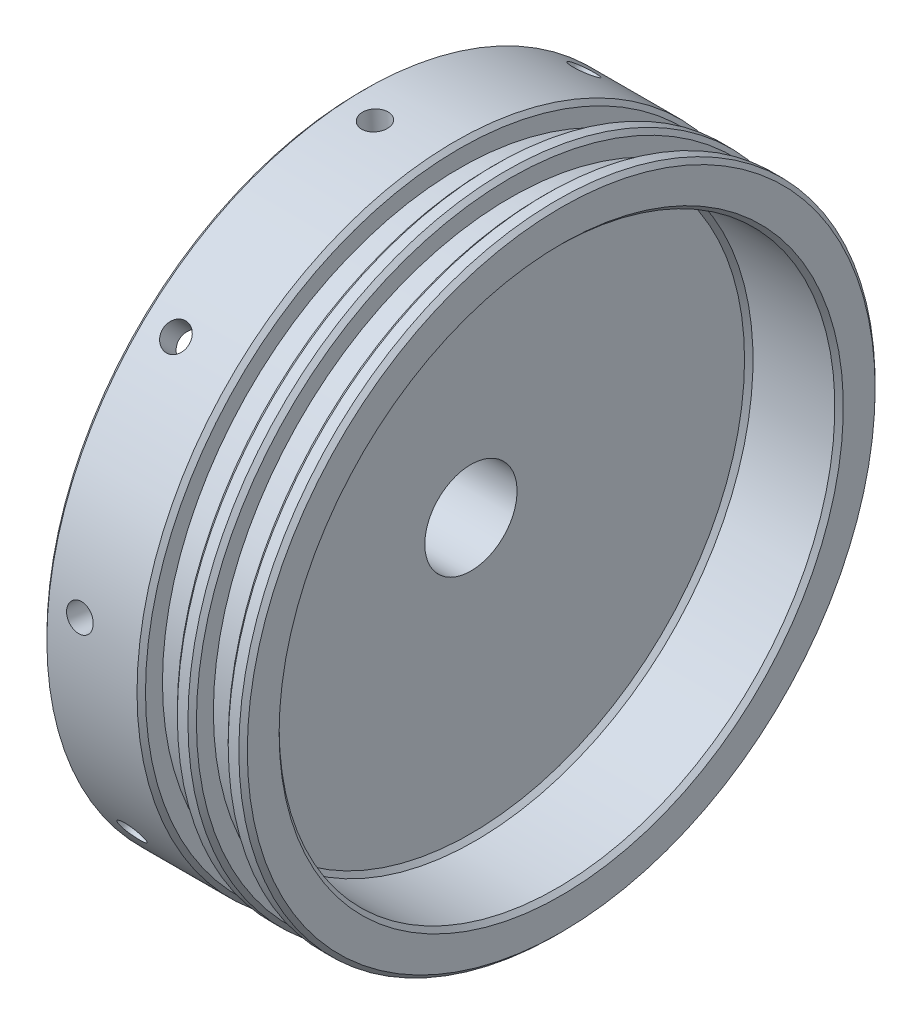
ISO-10303-21;
HEADER;
FILE_DESCRIPTION(('STEP AP214'),'2;1');
FILE_NAME('part.step','',(''),(''),'','','');
FILE_SCHEMA(('AUTOMOTIVE_DESIGN { 1 0 10303 214 1 1 1 1 }'));
ENDSEC;
DATA;
#1=APPLICATION_CONTEXT('core data for automotive mechanical design processes');
#2=APPLICATION_PROTOCOL_DEFINITION('international standard','automotive_design',2000,#1);
#3=PRODUCT_CONTEXT('',#1,'mechanical');
#4=PRODUCT('Part','Part','',(#3));
#5=PRODUCT_RELATED_PRODUCT_CATEGORY('part','',(#4));
#6=PRODUCT_DEFINITION_FORMATION('','',#4);
#7=PRODUCT_DEFINITION_CONTEXT('part definition',#1,'design');
#8=PRODUCT_DEFINITION('design','',#6,#7);
#9=PRODUCT_DEFINITION_SHAPE('','',#8);
#10=(LENGTH_UNIT() NAMED_UNIT(*) SI_UNIT(.MILLI.,.METRE.));
#11=(NAMED_UNIT(*) PLANE_ANGLE_UNIT() SI_UNIT($,.RADIAN.));
#12=(NAMED_UNIT(*) SI_UNIT($,.STERADIAN.) SOLID_ANGLE_UNIT());
#13=UNCERTAINTY_MEASURE_WITH_UNIT(LENGTH_MEASURE(1.E-05),#10,'distance_accuracy_value','');
#14=(GEOMETRIC_REPRESENTATION_CONTEXT(3) GLOBAL_UNCERTAINTY_ASSIGNED_CONTEXT((#13)) GLOBAL_UNIT_ASSIGNED_CONTEXT((#10,
#11,#12)) REPRESENTATION_CONTEXT('',''));
#15=CARTESIAN_POINT('',(0.,0.,0.));
#16=DIRECTION('',(0.,0.,1.));
#17=DIRECTION('',(1.,0.,0.));
#18=AXIS2_PLACEMENT_3D('',#15,#16,#17);
#19=CARTESIAN_POINT('',(0.,0.,-30.));
#20=DIRECTION('',(1.,0.,0.));
#21=DIRECTION('',(0.,0.,-1.));
#22=AXIS2_PLACEMENT_3D('',#19,#20,#21);
#23=PLANE('',#22);
#24=CARTESIAN_POINT('',(0.,0.,0.));
#25=DIRECTION('',(1.,0.,0.));
#26=DIRECTION('',(0.,0.,-1.));
#27=AXIS2_PLACEMENT_3D('',#24,#25,#26);
#28=CIRCLE('',#27,28.15);
#29=CARTESIAN_POINT('',(0.,0.,-28.15));
#30=VERTEX_POINT('',#29);
#31=EDGE_CURVE('E467',#30,#30,#28,.T.);
#32=ORIENTED_EDGE('',*,*,#31,.T.);
#33=EDGE_LOOP('',(#32));
#34=FACE_BOUND('',#33,.T.);
#35=CARTESIAN_POINT('',(0.,0.,0.));
#36=DIRECTION('',(1.,0.,0.));
#37=DIRECTION('',(0.,0.,-1.));
#38=AXIS2_PLACEMENT_3D('',#35,#36,#37);
#39=CIRCLE('',#38,29.6);
#40=CARTESIAN_POINT('',(0.,0.,-29.6));
#41=VERTEX_POINT('',#40);
#42=EDGE_CURVE('E472',#41,#41,#39,.F.);
#43=ORIENTED_EDGE('',*,*,#42,.T.);
#44=EDGE_LOOP('',(#43));
#45=FACE_BOUND('',#44,.T.);
#46=ADVANCED_FACE('F352',(#34,#45),#23,.F.);
#47=CARTESIAN_POINT('',(0.,0.,0.));
#48=DIRECTION('',(-1.,0.,0.));
#49=DIRECTION('',(0.,0.,1.));
#50=AXIS2_PLACEMENT_3D('',#47,#48,#49);
#51=CYLINDRICAL_SURFACE('',#50,27.75);
#52=CARTESIAN_POINT('',(3.34,-16.4723891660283,22.3321045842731));
#53=CARTESIAN_POINT('',(3.41017482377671,-16.4723868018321,22.3321066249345));
#54=CARTESIAN_POINT('',(3.48039962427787,-16.4676137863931,22.335629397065));
#55=CARTESIAN_POINT('',(3.61891257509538,-16.4486283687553,22.3496142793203));
#56=CARTESIAN_POINT('',(3.68719833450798,-16.4344047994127,22.3600845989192));
#57=CARTESIAN_POINT('',(3.8198066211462,-16.3968891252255,22.387609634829));
#58=CARTESIAN_POINT('',(3.88413112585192,-16.3736015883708,22.4046610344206));
#59=CARTESIAN_POINT('',(4.00700871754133,-16.3185696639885,22.4447752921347));
#60=CARTESIAN_POINT('',(4.06556317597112,-16.2868272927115,22.4678367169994));
#61=CARTESIAN_POINT('',(4.17530582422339,-16.2156868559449,22.5192344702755));
#62=CARTESIAN_POINT('',(4.22648854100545,-16.1762831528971,22.547574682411));
#63=CARTESIAN_POINT('',(4.31998825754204,-16.0908739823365,22.6086050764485));
#64=CARTESIAN_POINT('',(4.362304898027,-16.0448682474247,22.6412954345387));
#65=CARTESIAN_POINT('',(4.43688523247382,-15.947466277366,22.7100058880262));
#66=CARTESIAN_POINT('',(4.46914482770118,-15.8960678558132,22.7460273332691));
#67=CARTESIAN_POINT('',(4.52266898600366,-15.7892927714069,22.8202751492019));
#68=CARTESIAN_POINT('',(4.54393362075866,-15.7339161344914,22.8585015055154));
#69=CARTESIAN_POINT('',(4.57485022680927,-15.6207534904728,22.9359817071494));
#70=CARTESIAN_POINT('',(4.58451014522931,-15.5629691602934,22.9752348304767));
#71=CARTESIAN_POINT('',(4.59196762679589,-15.4465777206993,23.053647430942));
#72=CARTESIAN_POINT('',(4.58976526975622,-15.3879706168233,23.0928069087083));
#73=CARTESIAN_POINT('',(4.57356733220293,-15.2716468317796,23.1698979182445));
#74=CARTESIAN_POINT('',(4.55958030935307,-15.2139295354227,23.2078303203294));
#75=CARTESIAN_POINT('',(4.52022334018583,-15.1010079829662,23.2814648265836));
#76=CARTESIAN_POINT('',(4.49485335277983,-15.0458037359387,23.3171669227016));
#77=CARTESIAN_POINT('',(4.433440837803,-14.939502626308,23.3854176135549));
#78=CARTESIAN_POINT('',(4.39739440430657,-14.8884072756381,23.4179650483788));
#79=CARTESIAN_POINT('',(4.31565508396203,-14.7918578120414,23.4790696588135));
#80=CARTESIAN_POINT('',(4.26996214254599,-14.7464037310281,23.5076268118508));
#81=CARTESIAN_POINT('',(4.17017846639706,-14.6624590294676,23.5600775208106));
#82=CARTESIAN_POINT('',(4.11608030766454,-14.6239746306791,23.5839669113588));
#83=CARTESIAN_POINT('',(4.00104795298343,-14.5551846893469,23.6264838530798));
#84=CARTESIAN_POINT('',(3.94011375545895,-14.5248791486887,23.6451114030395));
#85=CARTESIAN_POINT('',(3.8131345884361,-14.4733735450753,23.6766736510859));
#86=CARTESIAN_POINT('',(3.74708949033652,-14.4521737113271,23.6896082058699));
#87=CARTESIAN_POINT('',(3.61176529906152,-14.4195353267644,23.7094890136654));
#88=CARTESIAN_POINT('',(3.54248622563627,-14.4080967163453,23.7164353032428));
#89=CARTESIAN_POINT('',(3.40272586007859,-14.3953415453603,23.7241796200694));
#90=CARTESIAN_POINT('',(3.33224567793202,-14.3940160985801,23.7249830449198));
#91=CARTESIAN_POINT('',(3.19202646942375,-14.401505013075,23.7204378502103));
#92=CARTESIAN_POINT('',(3.12228744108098,-14.4103193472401,23.7150892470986));
#93=CARTESIAN_POINT('',(2.98555929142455,-14.4378084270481,23.6983637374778));
#94=CARTESIAN_POINT('',(2.91856905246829,-14.4564791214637,23.6869893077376));
#95=CARTESIAN_POINT('',(2.78920568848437,-14.5031024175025,23.6584712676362));
#96=CARTESIAN_POINT('',(2.726832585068,-14.531055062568,23.6413276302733));
#97=CARTESIAN_POINT('',(2.60842623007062,-14.5954095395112,23.6016513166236));
#98=CARTESIAN_POINT('',(2.55239743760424,-14.6318172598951,23.5791148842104));
#99=CARTESIAN_POINT('',(2.44831499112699,-14.7119668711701,23.5291894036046));
#100=CARTESIAN_POINT('',(2.40026137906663,-14.7557088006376,23.501800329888));
#101=CARTESIAN_POINT('',(2.31345852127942,-14.8492477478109,23.442811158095));
#102=CARTESIAN_POINT('',(2.27471598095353,-14.8990490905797,23.4112080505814));
#103=CARTESIAN_POINT('',(2.20768085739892,-15.0032010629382,23.3445983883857));
#104=CARTESIAN_POINT('',(2.17938823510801,-15.0575516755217,23.3095918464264));
#105=CARTESIAN_POINT('',(2.13406781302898,-15.1691829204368,23.2370999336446));
#106=CARTESIAN_POINT('',(2.11703570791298,-15.2264624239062,23.1996155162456));
#107=CARTESIAN_POINT('',(2.09470569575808,-15.3423076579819,23.1231682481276));
#108=CARTESIAN_POINT('',(2.08940773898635,-15.4008733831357,23.0842054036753));
#109=CARTESIAN_POINT('',(2.09069690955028,-15.5175619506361,23.0059275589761));
#110=CARTESIAN_POINT('',(2.09727350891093,-15.5756851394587,22.9666129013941));
#111=CARTESIAN_POINT('',(2.12210336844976,-15.6899050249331,22.8887343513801));
#112=CARTESIAN_POINT('',(2.14035665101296,-15.7460017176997,22.8501704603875));
#113=CARTESIAN_POINT('',(2.18801969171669,-15.8546159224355,22.7749428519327));
#114=CARTESIAN_POINT('',(2.21742957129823,-15.9071333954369,22.7382791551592));
#115=CARTESIAN_POINT('',(2.28656890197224,-16.0071574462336,22.667976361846));
#116=CARTESIAN_POINT('',(2.32629801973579,-16.0546641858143,22.6343371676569));
#117=CARTESIAN_POINT('',(2.41498489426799,-16.1434306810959,22.571112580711));
#118=CARTESIAN_POINT('',(2.46394980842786,-16.1846855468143,22.5415303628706));
#119=CARTESIAN_POINT('',(2.56971705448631,-16.2598208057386,22.4873937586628));
#120=CARTESIAN_POINT('',(2.62652131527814,-16.2936993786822,22.4628406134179));
#121=CARTESIAN_POINT('',(2.7463928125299,-16.3532051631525,22.4195570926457));
#122=CARTESIAN_POINT('',(2.80946543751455,-16.3788251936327,22.4008317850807));
#123=CARTESIAN_POINT('',(2.93999710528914,-16.4210818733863,22.3698739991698));
#124=CARTESIAN_POINT('',(3.00745084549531,-16.4377291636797,22.3576338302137));
#125=CARTESIAN_POINT('',(3.1194381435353,-16.45723134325,22.3432790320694));
#126=CARTESIAN_POINT('',(3.1632458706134,-16.4629088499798,22.3390947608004));
#127=CARTESIAN_POINT('',(3.25136241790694,-16.4704885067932,22.3335068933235));
#128=CARTESIAN_POINT('',(3.29567123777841,-16.4723906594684,22.332103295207));
#129=CARTESIAN_POINT('',(3.34,-16.4723891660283,22.3321045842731));
#130=B_SPLINE_CURVE_WITH_KNOTS('',3,(#52,#53,#54,#55,#56,#57,#58,#59,#60,#61,#62,#63,#64,#65,
#66,#67,#68,#69,#70,#71,#72,#73,#74,#75,#76,#77,#78,#79,#80,#81,#82,#83,#84,#85,#86,#87,#88,#89,
#90,#91,#92,#93,#94,#95,#96,#97,#98,#99,#100,#101,#102,#103,#104,#105,#106,#107,#108,#109,#110,
#111,#112,#113,#114,#115,#116,#117,#118,#119,#120,#121,#122,#123,#124,#125,#126,#127,#128,#129),
.UNSPECIFIED.,.T.,.F.,(4,2,2,2,2,2,2,2,2,2,2,2,2,2,2,2,2,2,2,2,2,2,2,2,2,2,2,2,2,2,2,2,2,2,2,2,
2,2,4),(0.,0.210362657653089,0.420974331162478,0.631479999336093,0.841935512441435,
1.05254647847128,1.26316597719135,1.47387120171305,1.68457505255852,1.89513452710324,
2.10569258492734,2.31609787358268,2.52650392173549,2.736987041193,2.94747135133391,
3.15814264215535,3.36881398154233,3.57949062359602,3.79016597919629,4.00065619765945,
4.21114585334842,4.42154905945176,4.63195325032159,4.84250441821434,5.05305669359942,
5.26376014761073,5.47446281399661,5.68508487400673,5.89570604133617,6.1061405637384,
6.31657548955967,6.52701270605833,6.73744312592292,6.9480372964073,7.15868337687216,
7.3695121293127,7.58009030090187,7.71297446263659,7.84585853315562),.UNSPECIFIED.);
#131=CARTESIAN_POINT('',(3.34,-16.4723891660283,22.3321045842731));
#132=VERTEX_POINT('',#131);
#133=EDGE_CURVE('E595',#132,#132,#130,.T.);
#134=ORIENTED_EDGE('',*,*,#133,.T.);
#135=EDGE_LOOP('',(#134));
#136=FACE_BOUND('',#135,.T.);
#137=CARTESIAN_POINT('',(3.34,-26.973382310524,6.51913696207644));
#138=CARTESIAN_POINT('',(3.41017482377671,-26.9733818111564,6.5191400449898));
#139=CARTESIAN_POINT('',(3.48039962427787,-26.9719898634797,6.5249066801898));
#140=CARTESIAN_POINT('',(3.61891257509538,-26.9664354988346,6.54782331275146));
#141=CARTESIAN_POINT('',(3.68719833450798,-26.9622698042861,6.5649867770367));
#142=CARTESIAN_POINT('',(3.8198066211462,-26.951223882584,6.61018678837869));
#143=CARTESIAN_POINT('',(3.88413112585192,-26.9443450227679,6.63821785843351));
#144=CARTESIAN_POINT('',(4.00700871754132,-26.9279730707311,6.70432100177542));
#145=CARTESIAN_POINT('',(4.06556317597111,-26.9184806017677,6.74239068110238));
#146=CARTESIAN_POINT('',(4.17530582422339,-26.8970217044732,6.82749183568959));
#147=CARTESIAN_POINT('',(4.22648854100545,-26.8850534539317,6.87452990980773));
#148=CARTESIAN_POINT('',(4.31998825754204,-26.8588558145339,6.97618186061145));
#149=CARTESIAN_POINT('',(4.362304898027,-26.8446263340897,7.03079604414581));
#150=CARTESIAN_POINT('',(4.43688523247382,-26.8141783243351,7.1460400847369));
#151=CARTESIAN_POINT('',(4.46914482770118,-26.7979589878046,7.20667238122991));
#152=CARTESIAN_POINT('',(4.52266898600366,-26.7638901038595,7.33218320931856));
#153=CARTESIAN_POINT('',(4.54393362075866,-26.7460405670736,7.39706171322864));
#154=CARTESIAN_POINT('',(4.57485022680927,-26.7091562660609,7.52915453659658));
#155=CARTESIAN_POINT('',(4.58451014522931,-26.6901223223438,7.59636722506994));
#156=CARTESIAN_POINT('',(4.59196762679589,-26.6513639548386,7.73124973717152));
#157=CARTESIAN_POINT('',(4.58976526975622,-26.631639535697,7.79891955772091));
#158=CARTESIAN_POINT('',(4.57356733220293,-26.5920834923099,7.93274618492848));
#159=CARTESIAN_POINT('',(4.55958030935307,-26.5722519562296,7.99890405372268));
#160=CARTESIAN_POINT('',(4.52022334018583,-26.5330803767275,8.12789593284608));
#161=CARTESIAN_POINT('',(4.49485335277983,-26.51374033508,8.19072993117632));
#162=CARTESIAN_POINT('',(4.433440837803,-26.4761796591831,8.31134202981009));
#163=CARTESIAN_POINT('',(4.39739440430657,-26.4579594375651,8.36911826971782));
#164=CARTESIAN_POINT('',(4.31565508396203,-26.4232755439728,8.47798791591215));
#165=CARTESIAN_POINT('',(4.26996214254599,-26.4068118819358,8.52908128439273));
#166=CARTESIAN_POINT('',(4.17017846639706,-26.3762211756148,8.623219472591));
#167=CARTESIAN_POINT('',(4.11608030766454,-26.3620962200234,8.66625710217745));
#168=CARTESIAN_POINT('',(4.00104795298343,-26.3367294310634,8.74304429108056));
#169=CARTESIAN_POINT('',(3.94011375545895,-26.3254875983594,8.77679384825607));
#170=CARTESIAN_POINT('',(3.8131345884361,-26.3063198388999,8.8340790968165));
#171=CARTESIAN_POINT('',(3.74708949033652,-26.298393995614,8.8576145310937));
#172=CARTESIAN_POINT('',(3.61176529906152,-26.2861706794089,8.89382366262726));
#173=CARTESIAN_POINT('',(3.54248622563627,-26.281873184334,8.90649742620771));
#174=CARTESIAN_POINT('',(3.40272586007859,-26.2770801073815,8.92062878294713));
#175=CARTESIAN_POINT('',(3.33224567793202,-26.2765811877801,8.92209622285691));
#176=CARTESIAN_POINT('',(3.19202646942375,-26.279396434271,8.91380062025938));
#177=CARTESIAN_POINT('',(3.12228744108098,-26.2827105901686,8.90403760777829));
#178=CARTESIAN_POINT('',(2.98555929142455,-26.2930174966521,8.87355548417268));
#179=CARTESIAN_POINT('',(2.91856905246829,-26.3000087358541,8.85284087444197));
#180=CARTESIAN_POINT('',(2.78920568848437,-26.3173932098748,8.80102591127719));
#181=CARTESIAN_POINT('',(2.726832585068,-26.3277864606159,8.76992550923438));
#182=CARTESIAN_POINT('',(2.60842623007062,-26.3515814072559,8.6981654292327));
#183=CARTESIAN_POINT('',(2.55239743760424,-26.3649851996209,8.65749908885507));
#184=CARTESIAN_POINT('',(2.44831499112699,-26.3942918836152,8.56773477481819));
#185=CARTESIAN_POINT('',(2.40026137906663,-26.4101947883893,8.51863675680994));
#186=CARTESIAN_POINT('',(2.31345852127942,-26.4439322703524,8.41332275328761));
#187=CARTESIAN_POINT('',(2.27471598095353,-26.4617682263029,8.35710168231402));
#188=CARTESIAN_POINT('',(2.20768085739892,-26.4987374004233,8.2391281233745));
#189=CARTESIAN_POINT('',(2.17938823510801,-26.5178706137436,8.17737565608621));
#190=CARTESIAN_POINT('',(2.13406781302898,-26.5567882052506,8.05008844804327));
#191=CARTESIAN_POINT('',(2.11703570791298,-26.5765723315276,7.98455516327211));
#192=CARTESIAN_POINT('',(2.09470569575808,-26.6161755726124,7.85152927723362));
#193=CARTESIAN_POINT('',(2.08940773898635,-26.6359946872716,7.78403668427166));
#194=CARTESIAN_POINT('',(2.09069690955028,-26.6750672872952,7.6490664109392));
#195=CARTESIAN_POINT('',(2.09727350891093,-26.6943212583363,7.58158877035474));
#196=CARTESIAN_POINT('',(2.12210336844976,-26.7317593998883,7.4485112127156));
#197=CARTESIAN_POINT('',(2.14035665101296,-26.7499435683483,7.38291129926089));
#198=CARTESIAN_POINT('',(2.18801969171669,-26.7847915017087,7.25546774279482));
#199=CARTESIAN_POINT('',(2.21742957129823,-26.8014552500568,7.19362414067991));
#200=CARTESIAN_POINT('',(2.28656890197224,-26.8328883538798,7.07547485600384));
#201=CARTESIAN_POINT('',(2.32629801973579,-26.8476577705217,7.01916899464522));
#202=CARTESIAN_POINT('',(2.41498489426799,-26.875016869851,6.91367814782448));
#203=CARTESIAN_POINT('',(2.46394980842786,-26.8876048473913,6.86449873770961));
#204=CARTESIAN_POINT('',(2.56971705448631,-26.9103634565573,6.7747316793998));
#205=CARTESIAN_POINT('',(2.62652131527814,-26.9205334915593,6.73414615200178));
#206=CARTESIAN_POINT('',(2.7463928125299,-26.9382954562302,6.66273947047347));
#207=CARTESIAN_POINT('',(2.80946543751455,-26.9458851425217,6.6319268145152));
#208=CARTESIAN_POINT('',(2.93999710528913,-26.9583563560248,6.58104970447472));
#209=CARTESIAN_POINT('',(3.00745084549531,-26.9632410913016,6.56097251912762));
#210=CARTESIAN_POINT('',(3.1194381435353,-26.9689535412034,6.53744034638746));
#211=CARTESIAN_POINT('',(3.1632458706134,-26.9706131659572,6.5305855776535));
#212=CARTESIAN_POINT('',(3.25136241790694,-26.9728277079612,6.52143291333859));
#213=CARTESIAN_POINT('',(3.29567123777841,-26.9733826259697,6.51913501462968));
#214=CARTESIAN_POINT('',(3.34,-26.973382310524,6.51913696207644));
#215=B_SPLINE_CURVE_WITH_KNOTS('',3,(#137,#138,#139,#140,#141,#142,#143,#144,#145,#146,#147,
#148,#149,#150,#151,#152,#153,#154,#155,#156,#157,#158,#159,#160,#161,#162,#163,#164,#165,#166,
#167,#168,#169,#170,#171,#172,#173,#174,#175,#176,#177,#178,#179,#180,#181,#182,#183,#184,#185,
#186,#187,#188,#189,#190,#191,#192,#193,#194,#195,#196,#197,#198,#199,#200,#201,#202,#203,#204,
#205,#206,#207,#208,#209,#210,#211,#212,#213,#214),.UNSPECIFIED.,.T.,.F.,(4,2,2,2,2,2,2,2,2,2,2,
2,2,2,2,2,2,2,2,2,2,2,2,2,2,2,2,2,2,2,2,2,2,2,2,2,2,2,4),(0.,0.210362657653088,
0.420974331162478,0.631479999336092,0.841935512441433,1.05254647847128,1.26316597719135,
1.47387120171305,1.68457505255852,1.89513452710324,2.10569258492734,2.31609787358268,
2.52650392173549,2.736987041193,2.94747135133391,3.15814264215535,3.36881398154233,
3.57949062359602,3.7901659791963,4.00065619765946,4.21114585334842,4.42154905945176,
4.63195325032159,4.84250441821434,5.05305669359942,5.26376014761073,5.47446281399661,
5.68508487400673,5.89570604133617,6.1061405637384,6.31657548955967,6.52701270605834,
6.73744312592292,6.9480372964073,7.15868337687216,7.3695121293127,7.58009030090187,
7.71297446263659,7.84585853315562),.UNSPECIFIED.);
#216=CARTESIAN_POINT('',(3.34,-26.973382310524,6.51913696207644));
#217=VERTEX_POINT('',#216);
#218=EDGE_CURVE('E590',#217,#217,#215,.T.);
#219=ORIENTED_EDGE('',*,*,#218,.T.);
#220=EDGE_LOOP('',(#219));
#221=FACE_BOUND('',#220,.T.);
#222=CARTESIAN_POINT('',(3.34,-24.8532300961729,-12.3442072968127));
#223=CARTESIAN_POINT('',(3.41017482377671,-24.8532316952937,-12.3442046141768));
#224=CARTESIAN_POINT('',(3.48039962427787,-24.855872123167,-12.3388923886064));
#225=CARTESIAN_POINT('',(3.61891257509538,-24.8663477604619,-12.317766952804));
#226=CARTESIAN_POINT('',(3.68719833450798,-24.8741891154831,-12.3019413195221));
#227=CARTESIAN_POINT('',(3.8198066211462,-24.8947814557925,-12.260215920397));
#228=CARTESIAN_POINT('',(3.88413112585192,-24.9075299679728,-12.2343212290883));
#229=CARTESIAN_POINT('',(4.00700871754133,-24.9374786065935,-12.1731595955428));
#230=CARTESIAN_POINT('',(4.06556317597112,-24.9546776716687,-12.1378948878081));
#231=CARTESIAN_POINT('',(4.17530582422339,-24.9929411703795,-12.0589101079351));
#232=CARTESIAN_POINT('',(4.22648854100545,-25.0140084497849,-12.0151838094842));
#233=CARTESIAN_POINT('',(4.31998825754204,-25.0592805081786,-11.9204743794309));
#234=CARTESIAN_POINT('',(4.362304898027,-25.0834854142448,-11.8694909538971));
#235=CARTESIAN_POINT('',(4.43688523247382,-25.1342383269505,-11.7616372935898));
#236=CARTESIAN_POINT('',(4.46914482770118,-25.1607872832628,-11.7047646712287));
#237=CARTESIAN_POINT('',(4.52266898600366,-25.2153658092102,-11.5867187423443));
#238=CARTESIAN_POINT('',(4.54393362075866,-25.2433953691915,-11.5255454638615));
#239=CARTESIAN_POINT('',(4.57485022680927,-25.3000479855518,-11.4006477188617));
#240=CARTESIAN_POINT('',(4.58451014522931,-25.3286706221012,-11.3369250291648));
#241=CARTESIAN_POINT('',(4.59196762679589,-25.3856807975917,-11.2086856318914));
#242=CARTESIAN_POINT('',(4.58976526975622,-25.4140683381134,-11.1441689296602));
#243=CARTESIAN_POINT('',(4.57356733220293,-25.4697887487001,-11.016225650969));
#244=CARTESIAN_POINT('',(4.55958030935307,-25.4971223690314,-10.9527983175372));
#245=CARTESIAN_POINT('',(4.52022334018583,-25.5500295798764,-10.8288057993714));
#246=CARTESIAN_POINT('',(4.49485335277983,-25.5756031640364,-10.7682406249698));
#247=CARTESIAN_POINT('',(4.433440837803,-25.6243579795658,-10.6517028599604));
#248=CARTESIAN_POINT('',(4.39739440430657,-25.6475383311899,-10.595731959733));
#249=CARTESIAN_POINT('',(4.31565508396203,-25.6909489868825,-10.4900385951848));
#250=CARTESIAN_POINT('',(4.26996214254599,-25.7111792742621,-10.4403161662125));
#251=CARTESIAN_POINT('',(4.17017846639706,-25.748256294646,-10.3485388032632));
#252=CARTESIAN_POINT('',(4.11608030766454,-25.7651000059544,-10.306490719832));
#253=CARTESIAN_POINT('',(4.00104795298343,-25.7950257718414,-10.231362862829));
#254=CARTESIAN_POINT('',(3.94011375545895,-25.8081078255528,-10.1982830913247));
#255=CARTESIAN_POINT('',(3.8131345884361,-25.8302467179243,-10.1420792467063));
#256=CARTESIAN_POINT('',(3.74708949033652,-25.8393034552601,-10.1189554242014));
#257=CARTESIAN_POINT('',(3.61176529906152,-25.8532146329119,-10.083360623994));
#258=CARTESIAN_POINT('',(3.54248622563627,-25.8580690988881,-10.070889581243));
#259=CARTESIAN_POINT('',(3.40272586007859,-25.8634808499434,-10.0569834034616));
#260=CARTESIAN_POINT('',(3.33224567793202,-25.8640419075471,-10.0555385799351));
#261=CARTESIAN_POINT('',(3.19202646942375,-25.8608662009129,-10.0637029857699));
#262=CARTESIAN_POINT('',(3.12228744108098,-25.8571294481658,-10.0733121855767));
#263=CARTESIAN_POINT('',(2.98555929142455,-25.8454314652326,-10.1032879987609));
#264=CARTESIAN_POINT('',(2.91856905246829,-25.8374719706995,-10.123650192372));
#265=CARTESIAN_POINT('',(2.78920568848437,-25.8174832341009,-10.1745172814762));
#266=CARTESIAN_POINT('',(2.726832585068,-25.8054539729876,-10.2050222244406));
#267=CARTESIAN_POINT('',(2.60842623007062,-25.7775554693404,-10.275288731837));
#268=CARTESIAN_POINT('',(2.55239743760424,-25.7616835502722,-10.3150567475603));
#269=CARTESIAN_POINT('',(2.44831499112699,-25.7264343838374,-10.4026581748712));
#270=CARTESIAN_POINT('',(2.40026137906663,-25.7070571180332,-10.4504916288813));
#271=CARTESIAN_POINT('',(2.31345852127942,-25.6652069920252,-10.5528528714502));
#272=CARTESIAN_POINT('',(2.27471598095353,-25.6427319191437,-10.6073854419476));
#273=CARTESIAN_POINT('',(2.20768085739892,-25.5952200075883,-10.7215217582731));
#274=CARTESIAN_POINT('',(2.17938823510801,-25.5701831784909,-10.7811254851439));
#275=CARTESIAN_POINT('',(2.13406781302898,-25.5181771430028,-10.9036488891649));
#276=CARTESIAN_POINT('',(2.11703570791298,-25.4912086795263,-10.9665672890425));
#277=CARTESIAN_POINT('',(2.09470569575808,-25.4360391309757,-11.093927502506));
#278=CARTESIAN_POINT('',(2.08940773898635,-25.4078380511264,-11.1583693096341));
#279=CARTESIAN_POINT('',(2.09069690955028,-25.3510121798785,-11.2868779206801));
#280=CARTESIAN_POINT('',(2.09727350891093,-25.322387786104,-11.3509450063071));
#281=CARTESIAN_POINT('',(2.12210336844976,-25.2655264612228,-11.4769531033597));
#282=CARTESIAN_POINT('',(2.14035665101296,-25.2372895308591,-11.5388941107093));
#283=CARTESIAN_POINT('',(2.18801969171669,-25.1820654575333,-11.6589213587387));
#284=CARTESIAN_POINT('',(2.21742957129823,-25.155078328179,-11.7170075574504));
#285=CARTESIAN_POINT('',(2.28656890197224,-25.1032125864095,-11.8277199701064));
#286=CARTESIAN_POINT('',(2.3262980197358,-25.0783339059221,-11.8803463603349));
#287=CARTESIAN_POINT('',(2.41498489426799,-25.0314839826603,-11.9787431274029));
#288=CARTESIAN_POINT('',(2.46394980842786,-25.0095150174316,-12.0245081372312));
#289=CARTESIAN_POINT('',(2.56971705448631,-24.9692479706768,-12.1079026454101));
#290=CARTESIAN_POINT('',(2.62652131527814,-24.9509507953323,-12.1455301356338));
#291=CARTESIAN_POINT('',(2.7463928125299,-24.9186579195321,-12.2116479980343));
#292=CARTESIAN_POINT('',(2.80946543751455,-24.9046659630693,-12.2401304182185));
#293=CARTESIAN_POINT('',(2.93999710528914,-24.8815162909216,-12.2871208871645));
#294=CARTESIAN_POINT('',(3.00745084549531,-24.872352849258,-12.3056407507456));
#295=CARTESIAN_POINT('',(3.1194381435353,-24.8616026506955,-12.3273393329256));
#296=CARTESIAN_POINT('',(3.1632458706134,-24.8584678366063,-12.3336571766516));
#297=CARTESIAN_POINT('',(3.25136241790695,-24.8542810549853,-12.342092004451));
#298=CARTESIAN_POINT('',(3.29567123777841,-24.8532290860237,-12.3442089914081));
#299=CARTESIAN_POINT('',(3.34,-24.8532300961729,-12.3442072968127));
#300=B_SPLINE_CURVE_WITH_KNOTS('',3,(#222,#223,#224,#225,#226,#227,#228,#229,#230,#231,#232,
#233,#234,#235,#236,#237,#238,#239,#240,#241,#242,#243,#244,#245,#246,#247,#248,#249,#250,#251,
#252,#253,#254,#255,#256,#257,#258,#259,#260,#261,#262,#263,#264,#265,#266,#267,#268,#269,#270,
#271,#272,#273,#274,#275,#276,#277,#278,#279,#280,#281,#282,#283,#284,#285,#286,#287,#288,#289,
#290,#291,#292,#293,#294,#295,#296,#297,#298,#299),.UNSPECIFIED.,.T.,.F.,(4,2,2,2,2,2,2,2,2,2,2,
2,2,2,2,2,2,2,2,2,2,2,2,2,2,2,2,2,2,2,2,2,2,2,2,2,2,2,4),(0.,0.210362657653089,
0.420974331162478,0.631479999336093,0.841935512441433,1.05254647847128,1.26316597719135,
1.47387120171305,1.68457505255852,1.89513452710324,2.10569258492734,2.31609787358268,
2.52650392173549,2.73698704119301,2.94747135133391,3.15814264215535,3.36881398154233,
3.57949062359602,3.7901659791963,4.00065619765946,4.21114585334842,4.42154905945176,
4.63195325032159,4.84250441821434,5.05305669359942,5.26376014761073,5.4744628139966,
5.68508487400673,5.89570604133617,6.1061405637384,6.31657548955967,6.52701270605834,
6.73744312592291,6.9480372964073,7.15868337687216,7.3695121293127,7.58009030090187,
7.71297446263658,7.84585853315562),.UNSPECIFIED.);
#301=CARTESIAN_POINT('',(3.34,-24.8532300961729,-12.3442072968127));
#302=VERTEX_POINT('',#301);
#303=EDGE_CURVE('E585',#302,#302,#300,.T.);
#304=ORIENTED_EDGE('',*,*,#303,.T.);
#305=EDGE_LOOP('',(#304));
#306=FACE_BOUND('',#305,.T.);
#307=CARTESIAN_POINT('',(3.34,-11.1039753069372,-25.4315597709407));
#308=CARTESIAN_POINT('',(3.41017482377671,-11.1039782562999,-25.4315587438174));
#309=CARTESIAN_POINT('',(3.48039962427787,-11.1094155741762,-25.4291865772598));
#310=CARTESIAN_POINT('',(3.61891257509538,-11.1310195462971,-25.4197371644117));
#311=CARTESIAN_POINT('',(3.68719833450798,-11.1471988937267,-25.412654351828));
#312=CARTESIAN_POINT('',(3.8198066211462,-11.1897941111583,-25.3939273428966));
#313=CARTESIAN_POINT('',(3.88413112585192,-11.216204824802,-25.3822854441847));
#314=CARTESIAN_POINT('',(4.00700871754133,-11.2784607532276,-25.3546835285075));
#315=CARTESIAN_POINT('',(4.06556317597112,-11.3143037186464,-25.3387245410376));
#316=CARTESIAN_POINT('',(4.17530582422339,-11.3943856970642,-25.3028139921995));
#317=CARTESIAN_POINT('',(4.22648854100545,-11.4386308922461,-25.2828594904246));
#318=CARTESIAN_POINT('',(4.31998825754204,-11.5341893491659,-25.2394081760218));
#319=CARTESIAN_POINT('',(4.362304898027,-11.5855028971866,-25.2159112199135));
#320=CARTESIAN_POINT('',(4.43688523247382,-11.6937088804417,-25.1659138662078));
#321=CARTESIAN_POINT('',(4.46914482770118,-11.7506035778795,-25.13941225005));
#322=CARTESIAN_POINT('',(4.52266898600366,-11.868291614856,-25.0840662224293));
#323=CARTESIAN_POINT('',(4.54393362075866,-11.9290849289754,-25.0552218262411));
#324=CARTESIAN_POINT('',(4.57485022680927,-12.05276607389,-24.9959602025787));
#325=CARTESIAN_POINT('',(4.58451014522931,-12.1156524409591,-24.9655440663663));
#326=CARTESIAN_POINT('',(4.59196762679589,-12.2417554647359,-24.9039524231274));
#327=CARTESIAN_POINT('',(4.58976526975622,-12.3049721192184,-24.8727769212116));
#328=CARTESIAN_POINT('',(4.57356733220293,-12.429896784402,-24.8105830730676));
#329=CARTESIAN_POINT('',(4.55958030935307,-12.4916058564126,-24.7795646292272));
#330=CARTESIAN_POINT('',(4.52022334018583,-12.6118359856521,-24.7185889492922));
#331=CARTESIAN_POINT('',(4.49485335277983,-12.6703570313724,-24.6886317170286));
#332=CARTESIAN_POINT('',(4.43344083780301,-12.7826144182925,-24.6306976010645));
#333=CARTESIAN_POINT('',(4.39739440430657,-12.8363489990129,-24.6027214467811));
#334=CARTESIAN_POINT('',(4.31565508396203,-12.9375418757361,-24.549659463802));
#335=CARTESIAN_POINT('',(4.26996214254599,-12.9850001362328,-24.5245736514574));
#336=CARTESIAN_POINT('',(4.17017846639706,-13.0723961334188,-24.4781007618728));
#337=CARTESIAN_POINT('',(4.11608030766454,-13.1123271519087,-24.4567169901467));
#338=CARTESIAN_POINT('',(4.00104795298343,-13.1835428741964,-24.4184016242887));
#339=CARTESIAN_POINT('',(3.94011375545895,-13.2148275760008,-24.4014700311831));
#340=CARTESIAN_POINT('',(3.8131345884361,-13.2679140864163,-24.3726459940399));
#341=CARTESIAN_POINT('',(3.74708949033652,-13.2897156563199,-24.3607536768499));
#342=CARTESIAN_POINT('',(3.61176529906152,-13.3232521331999,-24.3424284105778));
#343=CARTESIAN_POINT('',(3.54248622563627,-13.3349871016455,-24.3359954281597));
#344=CARTESIAN_POINT('',(3.40272586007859,-13.3480714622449,-24.3288212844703));
#345=CARTESIAN_POINT('',(3.33224567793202,-13.3494299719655,-24.3280751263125));
#346=CARTESIAN_POINT('',(3.19202646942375,-13.3417492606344,-24.3322881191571));
#347=CARTESIAN_POINT('',(3.12228744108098,-13.3327100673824,-24.3372472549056));
#348=CARTESIAN_POINT('',(2.98555929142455,-13.3044808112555,-24.3526907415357));
#349=CARTESIAN_POINT('',(2.91856905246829,-13.2852949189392,-24.3631728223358));
#350=CARTESIAN_POINT('',(2.78920568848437,-13.2372859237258,-24.3892907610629));
#351=CARTESIAN_POINT('',(2.726832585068,-13.2084627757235,-24.4049266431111));
#352=CARTESIAN_POINT('',(2.60842623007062,-13.1419248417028,-24.4408210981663));
#353=CARTESIAN_POINT('',(2.55239743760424,-13.1042038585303,-24.4610828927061));
#354=CARTESIAN_POINT('',(2.44831499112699,-13.020892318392,-24.5055317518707));
#355=CARTESIAN_POINT('',(2.40026137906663,-12.9753017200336,-24.5297188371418));
#356=CARTESIAN_POINT('',(2.31345852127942,-12.877446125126,-24.5812313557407));
#357=CARTESIAN_POINT('',(2.27471598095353,-12.8251763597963,-24.6085590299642));
#358=CARTESIAN_POINT('',(2.20768085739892,-12.7154147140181,-24.6654524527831));
#359=CARTESIAN_POINT('',(2.17938823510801,-12.6579228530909,-24.695018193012));
#360=CARTESIAN_POINT('',(2.13406781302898,-12.5393273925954,-24.7554477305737));
#361=CARTESIAN_POINT('',(2.11703570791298,-12.4782251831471,-24.7863110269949));
#362=CARTESIAN_POINT('',(2.09470569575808,-12.3540972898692,-24.8484123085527));
#363=CARTESIAN_POINT('',(2.08940773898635,-12.2910716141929,-24.8796502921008));
#364=CARTESIAN_POINT('',(2.09069690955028,-12.1649367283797,-24.9415666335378));
#365=CARTESIAN_POINT('',(2.09727350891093,-12.1018276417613,-24.9722454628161));
#366=CARTESIAN_POINT('',(2.12210336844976,-11.9772728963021,-25.0322235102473));
#367=CARTESIAN_POINT('',(2.14035665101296,-11.9158272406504,-25.0615227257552));
#368=CARTESIAN_POINT('',(2.18801969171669,-11.7963711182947,-25.1179715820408));
#369=CARTESIAN_POINT('',(2.21742957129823,-11.7383606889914,-25.1451211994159));
#370=CARTESIAN_POINT('',(2.28656890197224,-11.6274646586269,-25.1965931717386));
#371=CARTESIAN_POINT('',(2.32629801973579,-11.5745788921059,-25.2209156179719));
#372=CARTESIAN_POINT('',(2.41498489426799,-11.4754415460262,-25.2661773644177));
#373=CARTESIAN_POINT('',(2.46394980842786,-11.4291951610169,-25.2871140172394));
#374=CARTESIAN_POINT('',(2.56971705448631,-11.3447438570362,-25.3251147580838));
#375=CARTESIAN_POINT('',(2.62652131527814,-11.3065409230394,-25.3421778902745));
#376=CARTESIAN_POINT('',(2.7463928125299,-11.2393034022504,-25.3720696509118));
#377=CARTESIAN_POINT('',(2.80946543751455,-11.2102767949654,-25.3848945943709));
#378=CARTESIAN_POINT('',(2.93999710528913,-11.1623382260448,-25.4060110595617));
#379=CARTESIAN_POINT('',(3.00745084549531,-11.1434142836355,-25.4143079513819));
#380=CARTESIAN_POINT('',(3.1194381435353,-11.1212315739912,-25.4240199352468));
#381=CARTESIAN_POINT('',(3.1632458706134,-11.114769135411,-25.4268446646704));
#382=CARTESIAN_POINT('',(3.25136241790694,-11.1061400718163,-25.4306149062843));
#383=CARTESIAN_POINT('',(3.29567123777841,-11.1039734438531,-25.4315604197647));
#384=CARTESIAN_POINT('',(3.34,-11.1039753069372,-25.4315597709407));
#385=B_SPLINE_CURVE_WITH_KNOTS('',3,(#307,#308,#309,#310,#311,#312,#313,#314,#315,#316,#317,
#318,#319,#320,#321,#322,#323,#324,#325,#326,#327,#328,#329,#330,#331,#332,#333,#334,#335,#336,
#337,#338,#339,#340,#341,#342,#343,#344,#345,#346,#347,#348,#349,#350,#351,#352,#353,#354,#355,
#356,#357,#358,#359,#360,#361,#362,#363,#364,#365,#366,#367,#368,#369,#370,#371,#372,#373,#374,
#375,#376,#377,#378,#379,#380,#381,#382,#383,#384),.UNSPECIFIED.,.T.,.F.,(4,2,2,2,2,2,2,2,2,2,2,
2,2,2,2,2,2,2,2,2,2,2,2,2,2,2,2,2,2,2,2,2,2,2,2,2,2,2,4),(0.,0.210362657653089,
0.420974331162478,0.631479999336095,0.841935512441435,1.05254647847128,1.26316597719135,
1.47387120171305,1.68457505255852,1.89513452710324,2.10569258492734,2.31609787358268,
2.52650392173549,2.736987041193,2.94747135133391,3.15814264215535,3.36881398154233,
3.57949062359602,3.7901659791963,4.00065619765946,4.21114585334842,4.42154905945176,
4.6319532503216,4.84250441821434,5.05305669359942,5.26376014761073,5.47446281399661,
5.68508487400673,5.89570604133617,6.1061405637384,6.31657548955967,6.52701270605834,
6.73744312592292,6.9480372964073,7.15868337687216,7.3695121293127,7.58009030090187,
7.71297446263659,7.84585853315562),.UNSPECIFIED.);
#386=CARTESIAN_POINT('',(3.34,-11.1039753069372,-25.4315597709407));
#387=VERTEX_POINT('',#386);
#388=EDGE_CURVE('E580',#387,#387,#385,.T.);
#389=ORIENTED_EDGE('',*,*,#388,.T.);
#390=EDGE_LOOP('',(#389));
#391=FACE_BOUND('',#390,.T.);
#392=CARTESIAN_POINT('',(3.34,7.84095293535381,-26.6192027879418));
#393=CARTESIAN_POINT('',(3.41017482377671,7.84095001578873,-26.6192038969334));
#394=CARTESIAN_POINT('',(3.48039962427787,7.83525998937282,-26.6208817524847));
#395=CARTESIAN_POINT('',(3.61891257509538,7.81263642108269,-26.627529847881));
#396=CARTESIAN_POINT('',(3.68719833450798,7.79568957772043,-26.6325039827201));
#397=CARTESIAN_POINT('',(3.8198066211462,7.75102225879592,-26.645537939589));
#398=CARTESIAN_POINT('',(3.88413112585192,7.72330721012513,-26.6535962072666));
#399=CARTESIAN_POINT('',(4.00700871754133,7.6578742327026,-26.672469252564));
#400=CARTESIAN_POINT('',(4.06556317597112,7.62015868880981,-26.6832833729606));
#401=CARTESIAN_POINT('',(4.17530582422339,7.53572947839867,-26.70725000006));
#402=CARTESIAN_POINT('',(4.22648854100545,7.4890091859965,-26.7204042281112));
#403=CARTESIAN_POINT('',(4.31998825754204,7.38787719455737,-26.7485423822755));
#404=CARTESIAN_POINT('',(4.362304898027,7.33346518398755,-26.7635263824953));
#405=CARTESIAN_POINT('',(4.43688523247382,7.21843691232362,-26.7947796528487));
#406=CARTESIAN_POINT('',(4.46914482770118,7.15781813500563,-26.8110494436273));
#407=CARTESIAN_POINT('',(4.52266898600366,7.03208812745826,-26.8443003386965));
#408=CARTESIAN_POINT('',(4.54393362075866,6.96697692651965,-26.8612814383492));
#409=CARTESIAN_POINT('',(4.57485022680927,6.83413903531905,-26.8953851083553));
#410=CARTESIAN_POINT('',(4.58451014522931,6.76641416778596,-26.9125075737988));
#411=CARTESIAN_POINT('',(4.59196762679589,6.6302233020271,-26.9463830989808));
#412=CARTESIAN_POINT('',(4.58976526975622,6.56175730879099,-26.963136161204));
#413=CARTESIAN_POINT('',(4.57356733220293,6.42608202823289,-26.9957929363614));
#414=CARTESIAN_POINT('',(4.55958030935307,6.35887186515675,-27.0116972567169));
#415=CARTESIAN_POINT('',(4.52022334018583,6.22757583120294,-27.0422696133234));
#416=CARTESIAN_POINT('',(4.49485335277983,6.16348997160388,-27.0569376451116));
#417=CARTESIAN_POINT('',(4.43344083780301,6.04025649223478,-27.0847151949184));
#418=CARTESIAN_POINT('',(4.39739440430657,5.98111068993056,-27.0978241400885));
#419=CARTESIAN_POINT('',(4.31565508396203,5.86948486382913,-27.1222218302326));
#420=CARTESIAN_POINT('',(4.26996214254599,5.8170048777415,-27.1335105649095));
#421=CARTESIAN_POINT('',(4.17017846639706,5.72018346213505,-27.1540873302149));
#422=CARTESIAN_POINT('',(4.11608030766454,5.67584930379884,-27.1633735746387));
#423=CARTESIAN_POINT('',(4.00104795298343,5.59666625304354,-27.1797988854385));
#424=CARTESIAN_POINT('',(3.94011375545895,5.56181736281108,-27.1869379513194));
#425=CARTESIAN_POINT('',(3.8131345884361,5.50262300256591,-27.1989808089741));
#426=CARTESIAN_POINT('',(3.74708949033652,5.47827779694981,-27.2038845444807));
#427=CARTESIAN_POINT('',(3.61176529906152,5.44080811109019,-27.2114034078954));
#428=CARTESIAN_POINT('',(3.54248622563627,5.42768356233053,-27.2140185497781));
#429=CARTESIAN_POINT('',(3.40272586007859,5.413048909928,-27.2169333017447));
#430=CARTESIAN_POINT('',(3.33224567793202,5.41152860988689,-27.2172349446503));
#431=CARTESIAN_POINT('',(3.19202646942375,5.42012043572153,-27.2155252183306));
#432=CARTESIAN_POINT('',(3.12228744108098,5.43023253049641,-27.2135138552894));
#433=CARTESIAN_POINT('',(2.98555929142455,5.46178427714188,-27.2071988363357));
#434=CARTESIAN_POINT('',(2.91856905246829,5.48321927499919,-27.2028961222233));
#435=CARTESIAN_POINT('',(2.78920568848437,5.53678458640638,-27.1920440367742));
#436=CARTESIAN_POINT('',(2.726832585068,5.5689149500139,-27.1854946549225));
#437=CARTESIAN_POINT('',(2.60842623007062,5.64295847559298,-27.1702216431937));
#438=CARTESIAN_POINT('',(2.55239743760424,5.68487845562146,-27.1614964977));
#439=CARTESIAN_POINT('',(2.44831499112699,5.77726997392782,-27.1419946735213));
#440=CARTESIAN_POINT('',(2.40026137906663,5.82774155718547,-27.1312179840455));
#441=CARTESIAN_POINT('',(2.31345852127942,5.93581490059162,-27.1077784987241));
#442=CARTESIAN_POINT('',(2.27471598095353,5.99342175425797,-27.0951143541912));
#443=CARTESIAN_POINT('',(2.20768085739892,6.11407444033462,-27.0681438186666));
#444=CARTESIAN_POINT('',(2.17938823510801,6.17712025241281,-27.0538374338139));
#445=CARTESIAN_POINT('',(2.13406781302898,6.3068130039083,-27.0238974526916));
#446=CARTESIAN_POINT('',(2.11703570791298,6.37345855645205,-27.0082643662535));
#447=CARTESIAN_POINT('',(2.09470569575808,6.50846397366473,-26.976048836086));
#448=CARTESIAN_POINT('',(2.08940773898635,6.57682383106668,-26.9594663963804));
#449=CARTESIAN_POINT('',(2.09069690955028,6.71324781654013,-26.9258191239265));
#450=CARTESIAN_POINT('',(2.09727350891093,6.78131215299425,-26.9087547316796));
#451=CARTESIAN_POINT('',(2.12210336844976,6.91527976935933,-26.8746383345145));
#452=CARTESIAN_POINT('',(2.14035665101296,6.98118304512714,-26.8575863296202));
#453=CARTESIAN_POINT('',(2.18801969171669,7.10897636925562,-26.8240437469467));
#454=CARTESIAN_POINT('',(2.21742957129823,7.17086637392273,-26.807553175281));
#455=CARTESIAN_POINT('',(2.28656890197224,7.28890320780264,-26.7757003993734));
#456=CARTESIAN_POINT('',(2.32629801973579,7.34505022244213,-26.7603381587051));
#457=CARTESIAN_POINT('',(2.41498489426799,7.45008752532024,-26.7312864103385));
#458=CARTESIAN_POINT('',(2.46394980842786,7.49897213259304,-26.7175982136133));
#459=CARTESIAN_POINT('',(2.56971705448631,7.5880919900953,-26.6924242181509));
#460=CARTESIAN_POINT('',(2.62652131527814,7.62832510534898,-26.680938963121));
#461=CARTESIAN_POINT('',(2.7463928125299,7.6990460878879,-26.660617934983));
#462=CARTESIAN_POINT('',(2.80946543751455,7.72952547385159,-26.651784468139));
#463=CARTESIAN_POINT('',(2.93999710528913,7.77982195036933,-26.6371463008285));
#464=CARTESIAN_POINT('',(3.00745084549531,7.7996516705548,-26.6313380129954));
#465=CARTESIAN_POINT('',(3.1194381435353,7.82288735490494,-26.6245190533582));
#466=CARTESIAN_POINT('',(3.1632458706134,7.82965357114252,-26.6225289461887));
#467=CARTESIAN_POINT('',(3.25136241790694,7.83868728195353,-26.6198704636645));
#468=CARTESIAN_POINT('',(3.29567123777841,7.84095477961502,-26.6192020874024));
#469=CARTESIAN_POINT('',(3.34,7.84095293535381,-26.6192027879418));
#470=B_SPLINE_CURVE_WITH_KNOTS('',3,(#392,#393,#394,#395,#396,#397,#398,#399,#400,#401,#402,
#403,#404,#405,#406,#407,#408,#409,#410,#411,#412,#413,#414,#415,#416,#417,#418,#419,#420,#421,
#422,#423,#424,#425,#426,#427,#428,#429,#430,#431,#432,#433,#434,#435,#436,#437,#438,#439,#440,
#441,#442,#443,#444,#445,#446,#447,#448,#449,#450,#451,#452,#453,#454,#455,#456,#457,#458,#459,
#460,#461,#462,#463,#464,#465,#466,#467,#468,#469),.UNSPECIFIED.,.T.,.F.,(4,2,2,2,2,2,2,2,2,2,2,
2,2,2,2,2,2,2,2,2,2,2,2,2,2,2,2,2,2,2,2,2,2,2,2,2,2,2,4),(0.,0.210362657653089,
0.420974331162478,0.631479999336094,0.841935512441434,1.05254647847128,1.26316597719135,
1.47387120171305,1.68457505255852,1.89513452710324,2.10569258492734,2.31609787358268,
2.52650392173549,2.736987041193,2.94747135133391,3.15814264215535,3.36881398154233,
3.57949062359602,3.79016597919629,4.00065619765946,4.21114585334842,4.42154905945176,
4.63195325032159,4.84250441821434,5.05305669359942,5.26376014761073,5.4744628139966,
5.68508487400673,5.89570604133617,6.1061405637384,6.31657548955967,6.52701270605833,
6.73744312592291,6.9480372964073,7.15868337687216,7.3695121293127,7.58009030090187,
7.71297446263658,7.84585853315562),.UNSPECIFIED.);
#471=CARTESIAN_POINT('',(3.34,7.84095293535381,-26.6192027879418));
#472=VERTEX_POINT('',#471);
#473=EDGE_CURVE('E574',#472,#472,#470,.T.);
#474=ORIENTED_EDGE('',*,*,#473,.T.);
#475=EDGE_LOOP('',(#474));
#476=FACE_BOUND('',#475,.T.);
#477=CARTESIAN_POINT('',(3.34,23.1170121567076,-15.3514249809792));
#478=CARTESIAN_POINT('',(3.41017482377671,23.1170106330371,-15.3514277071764));
#479=CARTESIAN_POINT('',(3.48039962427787,23.1137303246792,-15.3563704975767));
#480=CARTESIAN_POINT('',(3.61891257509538,23.1006729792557,-15.3760053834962));
#481=CARTESIAN_POINT('',(3.68719833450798,23.0908882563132,-15.3907090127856));
#482=CARTESIAN_POINT('',(3.8198066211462,23.0650491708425,-15.4294052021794));
#483=CARTESIAN_POINT('',(3.88413112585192,23.0489979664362,-15.4533930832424));
#484=CARTESIAN_POINT('',(4.00700871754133,23.0110047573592,-15.5099101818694));
#485=CARTESIAN_POINT('',(4.06556317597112,22.9890641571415,-15.5424373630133));
#486=CARTESIAN_POINT('',(4.17530582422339,22.9397930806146,-15.615066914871));
#487=CARTESIAN_POINT('',(4.22648854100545,22.9124586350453,-15.6551748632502));
#488=CARTESIAN_POINT('',(4.31998825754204,22.8530738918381,-15.7417363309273));
#489=CARTESIAN_POINT('',(4.362304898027,22.8210234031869,-15.7881901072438));
#490=CARTESIAN_POINT('',(4.43688523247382,22.7529958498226,-15.8860702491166));
#491=CARTESIAN_POINT('',(4.46914482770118,22.7170171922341,-15.9374986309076));
#492=CARTESIAN_POINT('',(4.52266898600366,22.6420756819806,-16.0437879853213));
#493=CARTESIAN_POINT('',(4.54393362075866,22.6031128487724,-16.0986489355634));
#494=CARTESIAN_POINT('',(4.57485022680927,22.5232745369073,-16.2101604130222));
#495=CARTESIAN_POINT('',(4.58451014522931,22.482400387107,-16.2668096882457));
#496=CARTESIAN_POINT('',(4.59196762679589,22.3998468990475,-16.3803016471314));
#497=CARTESIAN_POINT('',(4.58976526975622,22.3581675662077,-16.4371443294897));
#498=CARTESIAN_POINT('',(4.57356733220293,22.2752256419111,-16.5493712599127));
#499=CARTESIAN_POINT('',(4.55958030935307,22.2339627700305,-16.604756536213));
#500=CARTESIAN_POINT('',(4.52022334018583,22.1530357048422,-16.712571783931));
#501=CARTESIAN_POINT('',(4.49485335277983,22.1133715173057,-16.7650017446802));
#502=CARTESIAN_POINT('',(4.43344083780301,22.0368242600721,-16.8654935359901));
#503=CARTESIAN_POINT('',(4.39739440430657,21.9999422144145,-16.913553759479));
#504=CARTESIAN_POINT('',(4.31565508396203,21.9301144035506,-17.0039951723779));
#505=CARTESIAN_POINT('',(4.26996214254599,21.8971686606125,-17.0463763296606));
#506=CARTESIAN_POINT('',(4.17017846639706,21.8362256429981,-17.1243746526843));
#507=CARTESIAN_POINT('',(4.11608030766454,21.8082327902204,-17.159985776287));
#508=CARTESIAN_POINT('',(4.00104795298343,21.7581330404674,-17.2234661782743));
#509=CARTESIAN_POINT('',(3.94011375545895,21.736026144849,-17.2513354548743));
#510=CARTESIAN_POINT('',(3.8131345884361,21.6984216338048,-17.2986102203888));
#511=CARTESIAN_POINT('',(3.74708949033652,21.6829241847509,-17.3180154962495));
#512=CARTESIAN_POINT('',(3.61176529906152,21.6590537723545,-17.3478603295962));
#513=CARTESIAN_POINT('',(3.54248622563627,21.6506807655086,-17.3582999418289));
#514=CARTESIAN_POINT('',(3.40272586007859,21.641343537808,-17.3699397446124));
#515=CARTESIAN_POINT('',(3.33224567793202,21.6403728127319,-17.3711480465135));
#516=CARTESIAN_POINT('',(3.19202646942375,21.6458555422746,-17.3643156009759));
#517=CARTESIAN_POINT('',(3.12228744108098,21.6523089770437,-17.3562748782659));
#518=CARTESIAN_POINT('',(2.98555929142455,21.6724198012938,-17.3311562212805));
#519=CARTESIAN_POINT('',(2.91856905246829,21.6860742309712,-17.314082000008));
#520=CARTESIAN_POINT('',(2.78920568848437,21.7201320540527,-17.271337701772));
#521=CARTESIAN_POINT('',(2.726832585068,21.7405354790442,-17.245667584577));
#522=CARTESIAN_POINT('',(2.60842623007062,21.7874388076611,-17.1863735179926));
#523=CARTESIAN_POINT('',(2.55239743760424,21.8139429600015,-17.1527440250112));
#524=CARTESIAN_POINT('',(2.44831499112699,21.8721834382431,-17.078416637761));
#525=CARTESIAN_POINT('',(2.40026137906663,21.9039197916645,-17.0377187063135));
#526=CARTESIAN_POINT('',(2.31345852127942,21.9716421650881,-16.9502948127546));
#527=CARTESIAN_POINT('',(2.27471598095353,22.0076312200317,-16.9035645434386));
#528=CARTESIAN_POINT('',(2.20768085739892,22.0827202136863,-16.8053498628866));
#529=CARTESIAN_POINT('',(2.17938823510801,22.121820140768,-16.7538654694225));
#530=CARTESIAN_POINT('',(2.13406781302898,22.2019255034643,-16.6475652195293));
#531=CARTESIAN_POINT('',(2.11703570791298,22.2429302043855,-16.5927506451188));
#532=CARTESIAN_POINT('',(2.09470569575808,22.325642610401,-16.4812923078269));
#533=CARTESIAN_POINT('',(2.08940773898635,22.3673503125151,-16.4246485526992));
#534=CARTESIAN_POINT('',(2.09069690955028,22.450229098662,-16.3111815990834));
#535=CARTESIAN_POINT('',(2.09727350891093,22.4914006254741,-16.2543586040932));
#536=CARTESIAN_POINT('',(2.12210336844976,22.5720961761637,-16.1421112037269));
#537=CARTESIAN_POINT('',(2.14035665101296,22.6116201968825,-16.0866868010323));
#538=CARTESIAN_POINT('',(2.18801969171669,22.6879548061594,-15.9788477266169));
#539=CARTESIAN_POINT('',(2.21742957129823,22.7247653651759,-15.9264330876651));
#540=CARTESIAN_POINT('',(2.28656890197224,22.7947122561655,-15.8261598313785));
#541=CARTESIAN_POINT('',(2.32629801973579,22.8278487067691,-15.7783010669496));
#542=CARTESIAN_POINT('',(2.41498489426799,22.8896378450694,-15.6885294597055));
#543=CARTESIAN_POINT('',(2.46394980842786,22.9182870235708,-15.6466212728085));
#544=CARTESIAN_POINT('',(2.56971705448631,22.9703752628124,-15.5700517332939));
#545=CARTESIAN_POINT('',(2.62652131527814,22.9938130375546,-15.5353921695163));
#546=CARTESIAN_POINT('',(2.7463928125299,23.0349263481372,-15.4743667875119));
#547=CARTESIAN_POINT('',(2.80946543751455,23.0525968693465,-15.4480081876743));
#548=CARTESIAN_POINT('',(2.93999710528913,23.0817169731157,-15.4044647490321));
#549=CARTESIAN_POINT('',(3.00745084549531,23.0931739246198,-15.3872690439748));
#550=CARTESIAN_POINT('',(3.1194381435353,23.1065903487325,-15.3671098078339));
#551=CARTESIAN_POINT('',(3.1632458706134,23.1104943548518,-15.3612360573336));
#552=CARTESIAN_POINT('',(3.25136241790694,23.1157057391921,-15.35339278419));
#553=CARTESIAN_POINT('',(3.29567123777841,23.1170131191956,-15.3514232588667));
#554=CARTESIAN_POINT('',(3.34,23.1170121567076,-15.3514249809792));
#555=B_SPLINE_CURVE_WITH_KNOTS('',3,(#477,#478,#479,#480,#481,#482,#483,#484,#485,#486,#487,
#488,#489,#490,#491,#492,#493,#494,#495,#496,#497,#498,#499,#500,#501,#502,#503,#504,#505,#506,
#507,#508,#509,#510,#511,#512,#513,#514,#515,#516,#517,#518,#519,#520,#521,#522,#523,#524,#525,
#526,#527,#528,#529,#530,#531,#532,#533,#534,#535,#536,#537,#538,#539,#540,#541,#542,#543,#544,
#545,#546,#547,#548,#549,#550,#551,#552,#553,#554),.UNSPECIFIED.,.T.,.F.,(4,2,2,2,2,2,2,2,2,2,2,
2,2,2,2,2,2,2,2,2,2,2,2,2,2,2,2,2,2,2,2,2,2,2,2,2,2,2,4),(0.,0.210362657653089,
0.420974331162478,0.631479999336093,0.841935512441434,1.05254647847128,1.26316597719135,
1.47387120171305,1.68457505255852,1.89513452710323,2.10569258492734,2.31609787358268,
2.52650392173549,2.736987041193,2.94747135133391,3.15814264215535,3.36881398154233,
3.57949062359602,3.7901659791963,4.00065619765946,4.21114585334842,4.42154905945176,
4.6319532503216,4.84250441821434,5.05305669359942,5.26376014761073,5.47446281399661,
5.68508487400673,5.89570604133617,6.1061405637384,6.31657548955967,6.52701270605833,
6.73744312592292,6.9480372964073,7.15868337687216,7.3695121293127,7.58009030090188,
7.71297446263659,7.84585853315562),.UNSPECIFIED.);
#556=CARTESIAN_POINT('',(3.34,23.1170121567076,-15.3514249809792));
#557=VERTEX_POINT('',#556);
#558=EDGE_CURVE('E568',#557,#557,#555,.T.);
#559=ORIENTED_EDGE('',*,*,#558,.T.);
#560=EDGE_LOOP('',(#559));
#561=FACE_BOUND('',#560,.T.);
#562=CARTESIAN_POINT('',(3.34,27.5763644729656,3.09945518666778));
#563=CARTESIAN_POINT('',(3.41017482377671,27.576365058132,3.09945211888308));
#564=CARTESIAN_POINT('',(3.48039962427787,27.5770293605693,3.09355718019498));
#565=CARTESIAN_POINT('',(3.61891257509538,27.5796479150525,3.07012288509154));
#566=CARTESIAN_POINT('',(3.68719833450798,27.5816036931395,3.05256975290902));
#567=CARTESIAN_POINT('',(3.8198066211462,27.5866832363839,3.00631770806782));
#568=CARTESIAN_POINT('',(3.88413112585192,27.589806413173,2.97762440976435));
#569=CARTESIAN_POINT('',(4.00700871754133,27.5970304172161,2.90990823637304));
#570=CARTESIAN_POINT('',(4.06556317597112,27.601131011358,2.87088782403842));
#571=CARTESIAN_POINT('',(4.17530582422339,27.6100725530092,2.7835795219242));
#572=CARTESIAN_POINT('',(4.22648854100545,27.6149140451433,2.73528480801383));
#573=CARTESIAN_POINT('',(4.31998825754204,27.6250633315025,2.63080309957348));
#574=CARTESIAN_POINT('',(4.362304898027,27.6303711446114,2.574615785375));
#575=CARTESIAN_POINT('',(4.43688523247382,27.6411751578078,2.45590797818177));
#576=CARTESIAN_POINT('',(4.46914482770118,27.6466714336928,2.39338491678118));
#577=CARTESIAN_POINT('',(4.52266898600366,27.6575843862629,2.26379107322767));
#578=CARTESIAN_POINT('',(4.54393362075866,27.6630010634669,2.19672032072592));
#579=CARTESIAN_POINT('',(4.57485022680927,27.6735195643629,2.05997849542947));
#580=CARTESIAN_POINT('',(4.58451014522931,27.6786216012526,1.99030923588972));
#581=CARTESIAN_POINT('',(4.59196762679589,27.6883331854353,1.85030499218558));
#582=CARTESIAN_POINT('',(4.58976526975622,27.6929427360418,1.77997001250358));
#583=CARTESIAN_POINT('',(4.57356733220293,27.7015436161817,1.64068515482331));
#584=CARTESIAN_POINT('',(4.55958030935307,27.7055353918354,1.57173430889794));
#585=CARTESIAN_POINT('',(4.52022334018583,27.7128439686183,1.43712412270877));
#586=CARTESIAN_POINT('',(4.49485335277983,27.7161607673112,1.37146479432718));
#587=CARTESIAN_POINT('',(4.43344083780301,27.7221170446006,1.24527998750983));
#588=CARTESIAN_POINT('',(4.39739440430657,27.7247562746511,1.18475639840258));
#589=CARTESIAN_POINT('',(4.31565508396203,27.7293996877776,1.07058980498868));
#590=CARTESIAN_POINT('',(4.26996214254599,27.731403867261,1.0169468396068));
#591=CARTESIAN_POINT('',(4.17017846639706,27.7348551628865,0.918023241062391));
#592=CARTESIAN_POINT('',(4.11608030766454,27.7363017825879,0.872750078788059));
#593=CARTESIAN_POINT('',(4.00104795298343,27.7387275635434,0.791917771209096));
#594=CARTESIAN_POINT('',(3.94011375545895,27.7397067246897,0.756358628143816));
#595=CARTESIAN_POINT('',(3.8131345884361,27.7412876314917,0.695972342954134));
#596=CARTESIAN_POINT('',(3.74708949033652,27.7418893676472,0.671145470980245));
#597=CARTESIAN_POINT('',(3.61176529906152,27.7427874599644,0.632939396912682));
#598=CARTESIAN_POINT('',(3.54248622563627,27.743083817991,0.619560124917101));
#599=CARTESIAN_POINT('',(3.40272586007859,27.7434130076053,0.604641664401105));
#600=CARTESIAN_POINT('',(3.33224567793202,27.7434460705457,0.603092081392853));
#601=CARTESIAN_POINT('',(3.19202646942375,27.7432542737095,0.611850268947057));
#602=CARTESIAN_POINT('',(3.12228744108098,27.7430294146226,0.622158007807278));
#603=CARTESIAN_POINT('',(2.98555929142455,27.7422892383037,0.654327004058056));
#604=CARTESIAN_POINT('',(2.91856905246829,27.741774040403,0.676183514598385));
#605=CARTESIAN_POINT('',(2.78920568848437,27.7403883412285,0.730819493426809));
#606=CARTESIAN_POINT('',(2.72683258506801,27.7395178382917,0.763599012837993));
#607=CARTESIAN_POINT('',(2.60842623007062,27.7373343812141,0.839169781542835));
#608=CARTESIAN_POINT('',(2.55239743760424,27.7360211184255,0.881968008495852));
#609=CARTESIAN_POINT('',(2.44831499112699,27.7328591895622,0.976342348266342));
#610=CARTESIAN_POINT('',(2.40026137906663,27.7310105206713,1.02791850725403));
#611=CARTESIAN_POINT('',(2.31345852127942,27.7266938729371,1.13842019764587));
#612=CARTESIAN_POINT('',(2.27471598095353,27.7242254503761,1.19735097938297));
#613=CARTESIAN_POINT('',(2.20768085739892,27.7186157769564,1.32085406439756));
#614=CARTESIAN_POINT('',(2.17938823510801,27.7154745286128,1.38542634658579));
#615=CARTESIAN_POINT('',(2.13406781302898,27.7085103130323,1.51834779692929));
#616=CARTESIAN_POINT('',(2.11703570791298,27.7046876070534,1.58669551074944));
#617=CARTESIAN_POINT('',(2.09470569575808,27.6964049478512,1.72524406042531));
#618=CARTESIAN_POINT('',(2.08940773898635,27.6919449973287,1.79544488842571));
#619=CARTESIAN_POINT('',(2.09069690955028,27.6824986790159,1.93563907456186));
#620=CARTESIAN_POINT('',(2.09727350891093,27.6775127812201,2.00563256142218));
#621=CARTESIAN_POINT('',(2.12210336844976,27.6671779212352,2.14348915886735));
#622=CARTESIAN_POINT('',(2.14035665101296,27.6618289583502,2.21135226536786));
#623=CARTESIAN_POINT('',(2.18801969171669,27.6509870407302,2.34302873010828));
#624=CARTESIAN_POINT('',(2.21742957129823,27.6454940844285,2.40684204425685));
#625=CARTESIAN_POINT('',(2.28656890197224,27.6346221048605,2.52861680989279));
#626=CARTESIAN_POINT('',(2.32629801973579,27.6292430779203,2.58657845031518));
#627=CARTESIAN_POINT('',(2.41498489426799,27.6188722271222,2.69506478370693));
#628=CARTESIAN_POINT('',(2.46394980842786,27.6138807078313,2.74558365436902));
#629=CARTESIAN_POINT('',(2.56971705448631,27.6045646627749,2.83772099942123));
#630=CARTESIAN_POINT('',(2.62652131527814,27.6002403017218,2.87933727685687));
#631=CARTESIAN_POINT('',(2.7463928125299,27.592508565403,2.95251255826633));
#632=CARTESIAN_POINT('',(2.80946543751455,27.5891019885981,2.98406280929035));
#633=CARTESIAN_POINT('',(2.93999710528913,27.5834200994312,3.03613706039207));
#634=CARTESIAN_POINT('',(3.00745084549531,27.5811434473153,3.05667412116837));
#635=CARTESIAN_POINT('',(3.1194381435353,27.5784629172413,3.08074090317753));
#636=CARTESIAN_POINT('',(3.1632458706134,27.5776779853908,3.08774990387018));
#637=CARTESIAN_POINT('',(3.25136241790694,27.5766285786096,3.09710801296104));
#638=CARTESIAN_POINT('',(3.29567123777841,27.5763641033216,3.09945712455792));
#639=CARTESIAN_POINT('',(3.34,27.5763644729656,3.09945518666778));
#640=B_SPLINE_CURVE_WITH_KNOTS('',3,(#562,#563,#564,#565,#566,#567,#568,#569,#570,#571,#572,
#573,#574,#575,#576,#577,#578,#579,#580,#581,#582,#583,#584,#585,#586,#587,#588,#589,#590,#591,
#592,#593,#594,#595,#596,#597,#598,#599,#600,#601,#602,#603,#604,#605,#606,#607,#608,#609,#610,
#611,#612,#613,#614,#615,#616,#617,#618,#619,#620,#621,#622,#623,#624,#625,#626,#627,#628,#629,
#630,#631,#632,#633,#634,#635,#636,#637,#638,#639),.UNSPECIFIED.,.T.,.F.,(4,2,2,2,2,2,2,2,2,2,2,
2,2,2,2,2,2,2,2,2,2,2,2,2,2,2,2,2,2,2,2,2,2,2,2,2,2,2,4),(0.,0.210362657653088,
0.420974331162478,0.631479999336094,0.841935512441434,1.05254647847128,1.26316597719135,
1.47387120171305,1.68457505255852,1.89513452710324,2.10569258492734,2.31609787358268,
2.52650392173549,2.736987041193,2.94747135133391,3.15814264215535,3.36881398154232,
3.57949062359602,3.79016597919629,4.00065619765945,4.21114585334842,4.42154905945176,
4.63195325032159,4.84250441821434,5.05305669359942,5.26376014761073,5.4744628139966,
5.68508487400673,5.89570604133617,6.1061405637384,6.31657548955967,6.52701270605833,
6.73744312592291,6.9480372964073,7.15868337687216,7.3695121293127,7.58009030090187,
7.71297446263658,7.84585853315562),.UNSPECIFIED.);
#641=CARTESIAN_POINT('',(3.34,27.5763644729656,3.09945518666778));
#642=VERTEX_POINT('',#641);
#643=EDGE_CURVE('E563',#642,#642,#640,.T.);
#644=ORIENTED_EDGE('',*,*,#643,.T.);
#645=EDGE_LOOP('',(#644));
#646=FACE_BOUND('',#645,.T.);
#647=CARTESIAN_POINT('',(3.34,19.1324293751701,20.1000658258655));
#648=CARTESIAN_POINT('',(3.41017482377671,19.1324317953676,20.1000638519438));
#649=CARTESIAN_POINT('',(3.48039962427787,19.1367298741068,20.0959750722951));
#650=CARTESIAN_POINT('',(3.61891257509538,19.1537990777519,20.0797065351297));
#651=CARTESIAN_POINT('',(3.68719833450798,19.1665802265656,20.0675172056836));
#652=CARTESIAN_POINT('',(3.8198066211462,19.2002016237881,20.0353511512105));
#653=CARTESIAN_POINT('',(3.88413112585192,19.2210378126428,20.0153783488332));
#654=CARTESIAN_POINT('',(4.00700871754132,19.2700988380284,19.9681482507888));
#655=CARTESIAN_POINT('',(4.06556317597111,19.2983219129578,19.9408926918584));
#656=CARTESIAN_POINT('',(4.17530582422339,19.3612922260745,19.8797581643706));
#657=CARTESIAN_POINT('',(4.22648854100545,19.3960442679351,19.8458743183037));
#658=CARTESIAN_POINT('',(4.31998825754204,19.4709786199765,19.7723605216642));
#659=CARTESIAN_POINT('',(4.362304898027,19.5111611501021,19.7327303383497));
#660=CARTESIAN_POINT('',(4.43688523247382,19.5957414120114,19.648739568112));
#661=CARTESIAN_POINT('',(4.46914482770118,19.6401408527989,19.6043770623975));
#662=CARTESIAN_POINT('',(4.52266898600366,19.7318019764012,19.5121171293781));
#663=CARTESIAN_POINT('',(4.54393362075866,19.7790636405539,19.4642197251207));
#664=CARTESIAN_POINT('',(4.57485022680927,19.8750172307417,19.3662305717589));
#665=CARTESIAN_POINT('',(4.58451014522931,19.9237081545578,19.3161403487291));
#666=CARTESIAN_POINT('',(4.59196762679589,20.0211406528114,19.2151333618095));
#667=CARTESIAN_POINT('',(4.58976526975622,20.0698822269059,19.1642166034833));
#668=CARTESIAN_POINT('',(4.57356733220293,20.1660014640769,19.0630467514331));
#669=CARTESIAN_POINT('',(4.55958030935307,20.2133800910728,19.0127932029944));
#670=CARTESIAN_POINT('',(4.52022334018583,20.3055045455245,18.9143736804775));
#671=CARTESIAN_POINT('',(4.49485335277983,20.3502503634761,18.8662077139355));
#672=CARTESIAN_POINT('',(4.43344083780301,20.4359231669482,18.7733731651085));
#673=CARTESIAN_POINT('',(4.39739440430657,20.4768487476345,18.7287058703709));
#674=CARTESIAN_POINT('',(4.31565508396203,20.5537906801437,18.6442339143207));
#675=CARTESIAN_POINT('',(4.26996214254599,20.5898070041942,18.604429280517));
#676=CARTESIAN_POINT('',(4.17017846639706,20.6560377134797,18.5308678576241));
#677=CARTESIAN_POINT('',(4.11608030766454,20.6862469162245,18.4971164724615));
#678=CARTESIAN_POINT('',(4.00104795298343,20.7400631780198,18.4367545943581));
#679=CARTESIAN_POINT('',(3.94011375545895,20.7636702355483,18.4101441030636));
#680=CARTESIAN_POINT('',(3.8131345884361,20.803696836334,18.3649017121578));
#681=CARTESIAN_POINT('',(3.74708949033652,20.8201161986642,18.3462700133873));
#682=CARTESIAN_POINT('',(3.61176529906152,20.8453625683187,18.3175797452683));
#683=CARTESIAN_POINT('',(3.54248622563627,20.8541896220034,18.3075211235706));
#684=CARTESIAN_POINT('',(3.40272586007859,20.8640311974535,18.2963045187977));
#685=CARTESIAN_POINT('',(3.33224567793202,20.8650525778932,18.2951387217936));
#686=CARTESIAN_POINT('',(3.19202646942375,20.8592759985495,18.3017245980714));
#687=CARTESIAN_POINT('',(3.12228744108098,20.8524780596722,18.3094762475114));
#688=CARTESIAN_POINT('',(2.98555929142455,20.8312332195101,18.3336433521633));
#689=CARTESIAN_POINT('',(2.91856905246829,20.8167894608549,18.3500552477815));
#690=CARTESIAN_POINT('',(2.78920568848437,20.7806086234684,18.3910181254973));
#691=CARTESIAN_POINT('',(2.726832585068,20.7588715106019,18.4155691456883));
#692=CARTESIAN_POINT('',(2.60842623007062,20.7086229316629,18.4720562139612));
#693=CARTESIAN_POINT('',(2.55239743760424,20.6801067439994,18.5039974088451));
#694=CARTESIAN_POINT('',(2.44831499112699,20.6170219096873,18.5742598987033));
#695=CARTESIAN_POINT('',(2.40026137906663,20.5824532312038,18.6125812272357));
#696=CARTESIAN_POINT('',(2.31345852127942,20.5081173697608,18.6944557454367));
#697=CARTESIAN_POINT('',(2.27471598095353,20.4683464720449,18.7380126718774));
#698=CARTESIAN_POINT('',(2.20768085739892,20.3846629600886,18.8290156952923));
#699=CARTESIAN_POINT('',(2.17938823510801,20.3407503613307,18.8764617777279));
#700=CARTESIAN_POINT('',(2.13406781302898,20.2499752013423,18.9738090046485));
#701=CARTESIAN_POINT('',(2.11703570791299,20.2031137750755,19.0237092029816));
#702=CARTESIAN_POINT('',(2.09470569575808,20.1077115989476,19.1245195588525));
#703=CARTESIAN_POINT('',(2.08940773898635,20.0591708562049,19.1754297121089));
#704=CARTESIAN_POINT('',(2.09069690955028,19.9618194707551,19.2767527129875));
#705=CARTESIAN_POINT('',(2.09727350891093,19.913009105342,19.3271659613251));
#706=CARTESIAN_POINT('',(2.12210336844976,19.8164796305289,19.4261271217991));
#707=CARTESIAN_POINT('',(2.14035665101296,19.7687605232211,19.4746750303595));
#708=CARTESIAN_POINT('',(2.18801969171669,19.6758151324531,19.5685760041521));
#709=CARTESIAN_POINT('',(2.21742957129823,19.6305888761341,19.6139290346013));
#710=CARTESIAN_POINT('',(2.28656890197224,19.5439851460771,19.7002255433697));
#711=CARTESIAN_POINT('',(2.32629801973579,19.5026075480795,19.74116916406));
#712=CARTESIAN_POINT('',(2.41498489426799,19.4249293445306,19.8176082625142));
#713=CARTESIAN_POINT('',(2.46394980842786,19.3886327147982,19.8530994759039));
#714=CARTESIAN_POINT('',(2.56971705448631,19.3222714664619,19.9176925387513));
#715=CARTESIAN_POINT('',(2.62652131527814,19.2922083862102,19.9467928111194));
#716=CARTESIAN_POINT('',(2.7463928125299,19.2392493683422,19.9978784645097));
#717=CARTESIAN_POINT('',(2.80946543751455,19.21635966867,20.019857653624));
#718=CARTESIAN_POINT('',(2.93999710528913,19.1785344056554,20.056096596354));
#719=CARTESIAN_POINT('',(3.00745084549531,19.1635894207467,20.070365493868));
#720=CARTESIAN_POINT('',(3.1194381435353,19.1460661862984,20.0870787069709));
#721=CARTESIAN_POINT('',(3.1632458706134,19.1409595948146,20.0919433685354));
#722=CARTESIAN_POINT('',(3.25136241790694,19.1341404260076,20.0984375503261));
#723=CARTESIAN_POINT('',(3.29567123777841,19.1324278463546,20.1000670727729));
#724=CARTESIAN_POINT('',(3.34,19.1324293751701,20.1000658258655));
#725=B_SPLINE_CURVE_WITH_KNOTS('',3,(#647,#648,#649,#650,#651,#652,#653,#654,#655,#656,#657,
#658,#659,#660,#661,#662,#663,#664,#665,#666,#667,#668,#669,#670,#671,#672,#673,#674,#675,#676,
#677,#678,#679,#680,#681,#682,#683,#684,#685,#686,#687,#688,#689,#690,#691,#692,#693,#694,#695,
#696,#697,#698,#699,#700,#701,#702,#703,#704,#705,#706,#707,#708,#709,#710,#711,#712,#713,#714,
#715,#716,#717,#718,#719,#720,#721,#722,#723,#724),.UNSPECIFIED.,.T.,.F.,(4,2,2,2,2,2,2,2,2,2,2,
2,2,2,2,2,2,2,2,2,2,2,2,2,2,2,2,2,2,2,2,2,2,2,2,2,2,2,4),(0.,0.210362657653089,
0.420974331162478,0.631479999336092,0.841935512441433,1.05254647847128,1.26316597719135,
1.47387120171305,1.68457505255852,1.89513452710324,2.10569258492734,2.31609787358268,
2.52650392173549,2.736987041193,2.94747135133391,3.15814264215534,3.36881398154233,
3.57949062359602,3.79016597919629,4.00065619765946,4.21114585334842,4.42154905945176,
4.63195325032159,4.84250441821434,5.05305669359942,5.26376014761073,5.4744628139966,
5.68508487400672,5.89570604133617,6.1061405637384,6.31657548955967,6.52701270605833,
6.73744312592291,6.9480372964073,7.15868337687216,7.3695121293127,7.58009030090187,
7.71297446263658,7.84585853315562),.UNSPECIFIED.);
#726=CARTESIAN_POINT('',(3.34,19.1324293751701,20.1000658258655));
#727=VERTEX_POINT('',#726);
#728=EDGE_CURVE('E545',#727,#727,#725,.T.);
#729=ORIENTED_EDGE('',*,*,#728,.T.);
#730=EDGE_LOOP('',(#729));
#731=FACE_BOUND('',#730,.T.);
#732=CARTESIAN_POINT('',(3.34,1.73621793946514,27.6956322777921));
#733=CARTESIAN_POINT('',(3.41017482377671,1.73622106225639,27.6956323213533));
#734=CARTESIAN_POINT('',(3.48039962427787,1.74214179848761,27.6952628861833));
#735=CARTESIAN_POINT('',(3.61891257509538,1.76567478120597,27.6937723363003));
#736=CARTESIAN_POINT('',(3.68719833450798,1.78330085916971,27.6926503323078));
#737=CARTESIAN_POINT('',(3.8198066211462,1.82973228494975,27.6896211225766));
#738=CARTESIAN_POINT('',(3.88413112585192,1.85853200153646,27.6877143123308));
#739=CARTESIAN_POINT('',(4.00700871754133,1.9264738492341,27.6830697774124));
#740=CARTESIAN_POINT('',(4.06556317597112,1.96561351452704,27.6803322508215));
#741=CARTESIAN_POINT('',(4.17530582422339,2.05314808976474,27.6739770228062));
#742=CARTESIAN_POINT('',(4.22648854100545,2.10154981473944,27.6703586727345));
#743=CARTESIAN_POINT('',(4.31998825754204,2.20620661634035,27.6622107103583));
#744=CARTESIAN_POINT('',(4.362304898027,2.26246201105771,27.657681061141));
#745=CARTESIAN_POINT('',(4.43688523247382,2.38124247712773,27.6477075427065));
#746=CARTESIAN_POINT('',(4.46914482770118,2.44377009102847,27.6422633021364));
#747=CARTESIAN_POINT('',(4.52266898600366,2.57329012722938,27.6305067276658));
#748=CARTESIAN_POINT('',(4.54393362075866,2.64028252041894,27.6241943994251));
#749=CARTESIAN_POINT('',(4.57485022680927,2.77677344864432,27.6108081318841));
#750=CARTESIAN_POINT('',(4.58451014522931,2.84627023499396,27.6037347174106));
#751=CARTESIAN_POINT('',(4.59196762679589,2.985833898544,27.5889872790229));
#752=CARTESIAN_POINT('',(4.58976526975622,3.05590077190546,27.5813132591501));
#753=CARTESIAN_POINT('',(4.57356733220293,3.19456310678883,27.5655969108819));
#754=CARTESIAN_POINT('',(4.55958030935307,3.2631595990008,27.5575548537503));
#755=CARTESIAN_POINT('',(4.52022334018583,3.39699387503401,27.5413775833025));
#756=CARTESIAN_POINT('',(4.49485335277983,3.46223164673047,27.5332423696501));
#757=CARTESIAN_POINT('',(4.43344083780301,3.58753371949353,27.5171963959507));
#758=CARTESIAN_POINT('',(4.39739440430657,3.64759611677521,27.5092857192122));
#759=CARTESIAN_POINT('',(4.31565508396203,3.76083458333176,27.4940337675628));
#760=CARTESIAN_POINT('',(4.26996214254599,3.81401061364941,27.4866924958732));
#761=CARTESIAN_POINT('',(4.17017846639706,3.91203065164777,27.4729134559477));
#762=CARTESIAN_POINT('',(4.11608030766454,3.95686721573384,27.4664764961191));
#763=CARTESIAN_POINT('',(4.00104795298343,4.03689273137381,27.4548290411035));
#764=CARTESIAN_POINT('',(3.94011375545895,4.07208168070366,27.4496185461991));
#765=CARTESIAN_POINT('',(3.8131345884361,4.1318250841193,27.4406894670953));
#766=CARTESIAN_POINT('',(3.74708949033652,4.15637927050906,27.436970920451));
#767=CARTESIAN_POINT('',(3.61176529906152,4.19416086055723,27.4312209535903));
#768=CARTESIAN_POINT('',(3.54248622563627,4.20738833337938,27.429189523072));
#769=CARTESIAN_POINT('',(3.40272586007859,4.22213731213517,27.4269231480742));
#770=CARTESIAN_POINT('',(3.33224567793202,4.22366909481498,27.4266866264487));
#771=CARTESIAN_POINT('',(3.19202646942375,4.21501065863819,27.4280185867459));
#772=CARTESIAN_POINT('',(3.12228744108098,4.20482047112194,27.4295870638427));
#773=CARTESIAN_POINT('',(2.98555929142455,4.17301166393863,27.4344442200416));
#774=CARTESIAN_POINT('',(2.91856905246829,4.15139773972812,27.4377321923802));
#775=CARTESIAN_POINT('',(2.78920568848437,4.09735118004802,27.4458549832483));
#776=CARTESIAN_POINT('',(2.726832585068,4.06491849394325,27.4506898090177));
#777=CARTESIAN_POINT('',(2.60842623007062,3.99011666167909,27.4616622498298));
#778=CARTESIAN_POINT('',(2.55239743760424,3.94774059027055,27.4678007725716));
#779=CARTESIAN_POINT('',(2.44831499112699,3.85425094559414,27.4810748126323));
#780=CARTESIAN_POINT('',(2.40026137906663,3.80313732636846,27.488210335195));
#781=CARTESIAN_POINT('',(2.31345852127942,3.69356482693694,27.5031476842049));
#782=CARTESIAN_POINT('',(2.27471598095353,3.63510069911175,27.5109499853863));
#783=CARTESIAN_POINT('',(2.20768085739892,3.51249979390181,27.5268716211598));
#784=CARTESIAN_POINT('',(2.17938823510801,3.44836303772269,27.5349909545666));
#785=CARTESIAN_POINT('',(2.13406781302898,3.31625163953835,27.5512141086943));
#786=CARTESIAN_POINT('',(2.11703570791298,3.24827847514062,27.5593179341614));
#787=CARTESIAN_POINT('',(2.09470569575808,3.11039652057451,27.5752198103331));
#788=CARTESIAN_POINT('',(2.08940773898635,3.04048773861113,27.5830178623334));
#789=CARTESIAN_POINT('',(2.09069690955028,2.90078308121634,27.5980595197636));
#790=CARTESIAN_POINT('',(2.09727350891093,2.83098716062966,27.6053036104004));
#791=CARTESIAN_POINT('',(2.12210336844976,2.69343028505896,27.6190643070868));
#792=CARTESIAN_POINT('',(2.14035665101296,2.62566933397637,27.6255809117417));
#793=CARTESIAN_POINT('',(2.18801969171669,2.49411065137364,27.6377690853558));
#794=CARTESIAN_POINT('',(2.21742957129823,2.43031296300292,27.6434406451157));
#795=CARTESIAN_POINT('',(2.28656890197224,2.30850033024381,27.6538798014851));
#796=CARTESIAN_POINT('',(2.32629801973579,2.25048519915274,27.6586474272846));
#797=CARTESIAN_POINT('',(2.41498489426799,2.14184613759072,27.6672725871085));
#798=CARTESIAN_POINT('',(2.46394980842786,2.09122799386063,27.6711294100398));
#799=CARTESIAN_POINT('',(2.56971705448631,1.99887270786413,27.6779543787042));
#800=CARTESIAN_POINT('',(2.62652131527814,1.95713775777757,27.6809223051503));
#801=CARTESIAN_POINT('',(2.7463928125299,1.88373157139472,27.6860147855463));
#802=CARTESIAN_POINT('',(2.80946543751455,1.85206909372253,27.6881386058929));
#803=CARTESIAN_POINT('',(2.93999710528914,1.79979931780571,27.6915856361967));
#804=CARTESIAN_POINT('',(3.00745084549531,1.77917892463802,27.6929097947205));
#805=CARTESIAN_POINT('',(3.1194381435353,1.75501230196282,27.6944491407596));
#806=CARTESIAN_POINT('',(3.1632458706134,1.7479734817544,27.6948932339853));
#807=CARTESIAN_POINT('',(3.25136241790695,1.738575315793,27.6954847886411));
#808=CARTESIAN_POINT('',(3.29567123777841,1.7362159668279,27.6956322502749));
#809=CARTESIAN_POINT('',(3.34,1.73621793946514,27.6956322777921));
#810=B_SPLINE_CURVE_WITH_KNOTS('',3,(#732,#733,#734,#735,#736,#737,#738,#739,#740,#741,#742,
#743,#744,#745,#746,#747,#748,#749,#750,#751,#752,#753,#754,#755,#756,#757,#758,#759,#760,#761,
#762,#763,#764,#765,#766,#767,#768,#769,#770,#771,#772,#773,#774,#775,#776,#777,#778,#779,#780,
#781,#782,#783,#784,#785,#786,#787,#788,#789,#790,#791,#792,#793,#794,#795,#796,#797,#798,#799,
#800,#801,#802,#803,#804,#805,#806,#807,#808,#809),.UNSPECIFIED.,.T.,.F.,(4,2,2,2,2,2,2,2,2,2,2,
2,2,2,2,2,2,2,2,2,2,2,2,2,2,2,2,2,2,2,2,2,2,2,2,2,2,2,4),(0.,0.210362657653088,
0.420974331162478,0.631479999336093,0.841935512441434,1.05254647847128,1.26316597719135,
1.47387120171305,1.68457505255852,1.89513452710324,2.10569258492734,2.31609787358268,
2.52650392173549,2.73698704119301,2.94747135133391,3.15814264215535,3.36881398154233,
3.57949062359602,3.7901659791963,4.00065619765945,4.21114585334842,4.42154905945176,
4.63195325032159,4.84250441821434,5.05305669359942,5.26376014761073,5.4744628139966,
5.68508487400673,5.89570604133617,6.1061405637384,6.31657548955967,6.52701270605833,
6.73744312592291,6.9480372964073,7.15868337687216,7.3695121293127,7.58009030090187,
7.71297446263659,7.84585853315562),.UNSPECIFIED.);
#811=CARTESIAN_POINT('',(3.34,1.73621793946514,27.6956322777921));
#812=VERTEX_POINT('',#811);
#813=EDGE_CURVE('E538',#812,#812,#810,.T.);
#814=ORIENTED_EDGE('',*,*,#813,.T.);
#815=EDGE_LOOP('',(#814));
#816=FACE_BOUND('',#815,.T.);
#817=CARTESIAN_POINT('',(0.400000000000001,0.,0.));
#818=DIRECTION('',(1.,0.,0.));
#819=DIRECTION('',(0.,0.,-1.));
#820=AXIS2_PLACEMENT_3D('',#817,#818,#819);
#821=CIRCLE('',#820,27.75);
#822=CARTESIAN_POINT('',(0.400000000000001,0.,-27.75));
#823=VERTEX_POINT('',#822);
#824=EDGE_CURVE('E651',#823,#823,#821,.F.);
#825=ORIENTED_EDGE('',*,*,#824,.T.);
#826=EDGE_LOOP('',(#825));
#827=FACE_BOUND('',#826,.T.);
#828=CARTESIAN_POINT('',(7.2,0.,0.));
#829=DIRECTION('',(-1.,0.,0.));
#830=DIRECTION('',(0.,0.,1.));
#831=AXIS2_PLACEMENT_3D('',#828,#829,#830);
#832=CIRCLE('',#831,27.75);
#833=CARTESIAN_POINT('',(7.2,0.,27.75));
#834=VERTEX_POINT('',#833);
#835=EDGE_CURVE('E654',#834,#834,#832,.T.);
#836=ORIENTED_EDGE('',*,*,#835,.F.);
#837=EDGE_LOOP('',(#836));
#838=FACE_BOUND('',#837,.T.);
#839=ADVANCED_FACE('F550',(#136,#221,#306,#391,#476,#561,#646,#731,#816,#827,#838),#51,.F.);
#840=CARTESIAN_POINT('',(7.2,0.,-27.75));
#841=DIRECTION('',(1.,0.,0.));
#842=DIRECTION('',(0.,0.,-1.));
#843=AXIS2_PLACEMENT_3D('',#840,#841,#842);
#844=PLANE('',#843);
#845=CARTESIAN_POINT('',(7.2,0.,0.));
#846=DIRECTION('',(-1.,0.,0.));
#847=DIRECTION('',(0.,0.,1.));
#848=AXIS2_PLACEMENT_3D('',#845,#846,#847);
#849=CIRCLE('',#848,7.6);
#850=CARTESIAN_POINT('',(7.2,0.,7.6));
#851=VERTEX_POINT('',#850);
#852=EDGE_CURVE('E656',#851,#851,#849,.T.);
#853=ORIENTED_EDGE('',*,*,#852,.F.);
#854=EDGE_LOOP('',(#853));
#855=FACE_BOUND('',#854,.T.);
#856=ORIENTED_EDGE('',*,*,#835,.T.);
#857=EDGE_LOOP('',(#856));
#858=FACE_BOUND('',#857,.T.);
#859=ADVANCED_FACE('F554',(#855,#858),#844,.F.);
#860=CARTESIAN_POINT('',(0.,0.,0.));
#861=DIRECTION('',(-1.,0.,0.));
#862=DIRECTION('',(0.,0.,1.));
#863=AXIS2_PLACEMENT_3D('',#860,#861,#862);
#864=CYLINDRICAL_SURFACE('',#863,7.6);
#865=CARTESIAN_POINT('',(3.3,0.,0.));
#866=DIRECTION('',(-1.,0.,0.));
#867=DIRECTION('',(0.,0.,1.));
#868=AXIS2_PLACEMENT_3D('',#865,#866,#867);
#869=CIRCLE('',#868,7.6);
#870=CARTESIAN_POINT('',(3.3,0.,7.6));
#871=VERTEX_POINT('',#870);
#872=EDGE_CURVE('E660',#871,#871,#869,.T.);
#873=ORIENTED_EDGE('',*,*,#872,.F.);
#874=EDGE_LOOP('',(#873));
#875=FACE_BOUND('',#874,.T.);
#876=ORIENTED_EDGE('',*,*,#852,.T.);
#877=EDGE_LOOP('',(#876));
#878=FACE_BOUND('',#877,.T.);
#879=ADVANCED_FACE('F902',(#875,#878),#864,.T.);
#880=CARTESIAN_POINT('',(3.3,0.,-7.6));
#881=DIRECTION('',(1.,0.,0.));
#882=DIRECTION('',(0.,0.,-1.));
#883=AXIS2_PLACEMENT_3D('',#880,#881,#882);
#884=PLANE('',#883);
#885=CARTESIAN_POINT('',(3.3,0.,0.));
#886=DIRECTION('',(-1.,0.,0.));
#887=DIRECTION('',(0.,0.,1.));
#888=AXIS2_PLACEMENT_3D('',#885,#886,#887);
#889=CIRCLE('',#888,4.35);
#890=CARTESIAN_POINT('',(3.3,0.,4.35));
#891=VERTEX_POINT('',#890);
#892=EDGE_CURVE('E950',#891,#891,#889,.T.);
#893=ORIENTED_EDGE('',*,*,#892,.F.);
#894=EDGE_LOOP('',(#893));
#895=FACE_BOUND('',#894,.T.);
#896=ORIENTED_EDGE('',*,*,#872,.T.);
#897=EDGE_LOOP('',(#896));
#898=FACE_BOUND('',#897,.T.);
#899=ADVANCED_FACE('F909',(#895,#898),#884,.F.);
#900=CARTESIAN_POINT('',(0.,0.,0.));
#901=DIRECTION('',(-1.,0.,0.));
#902=DIRECTION('',(0.,0.,1.));
#903=AXIS2_PLACEMENT_3D('',#900,#901,#902);
#904=CYLINDRICAL_SURFACE('',#903,4.35);
#905=CARTESIAN_POINT('',(10.3863937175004,0.,0.));
#906=DIRECTION('',(-1.,0.,0.));
#907=DIRECTION('',(0.,0.,1.));
#908=AXIS2_PLACEMENT_3D('',#905,#906,#907);
#909=CIRCLE('',#908,4.35);
#910=CARTESIAN_POINT('',(10.3863937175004,0.,4.35));
#911=VERTEX_POINT('',#910);
#912=EDGE_CURVE('E947',#911,#911,#909,.T.);
#913=ORIENTED_EDGE('',*,*,#912,.F.);
#914=EDGE_LOOP('',(#913));
#915=FACE_BOUND('',#914,.T.);
#916=ORIENTED_EDGE('',*,*,#892,.T.);
#917=EDGE_LOOP('',(#916));
#918=FACE_BOUND('',#917,.T.);
#919=ADVANCED_FACE('F700',(#915,#918),#904,.F.);
#920=CARTESIAN_POINT('',(10.3863937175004,0.,-4.35));
#921=DIRECTION('',(-1.,0.,0.));
#922=DIRECTION('',(0.,0.,1.));
#923=AXIS2_PLACEMENT_3D('',#920,#921,#922);
#924=PLANE('',#923);
#925=CARTESIAN_POINT('',(10.3863937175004,0.,0.));
#926=DIRECTION('',(-1.,0.,0.));
#927=DIRECTION('',(0.,0.,1.));
#928=AXIS2_PLACEMENT_3D('',#925,#926,#927);
#929=CIRCLE('',#928,25.8);
#930=CARTESIAN_POINT('',(10.3863937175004,0.,25.8));
#931=VERTEX_POINT('',#930);
#932=EDGE_CURVE('E511',#931,#931,#929,.F.);
#933=ORIENTED_EDGE('',*,*,#932,.T.);
#934=EDGE_LOOP('',(#933));
#935=FACE_BOUND('',#934,.T.);
#936=ORIENTED_EDGE('',*,*,#912,.T.);
#937=EDGE_LOOP('',(#936));
#938=FACE_BOUND('',#937,.T.);
#939=ADVANCED_FACE('F695',(#935,#938),#924,.F.);
#940=CARTESIAN_POINT('',(0.,0.,0.));
#941=DIRECTION('',(-1.,0.,0.));
#942=DIRECTION('',(0.,0.,1.));
#943=AXIS2_PLACEMENT_3D('',#940,#941,#942);
#944=CYLINDRICAL_SURFACE('',#943,26.2);
#945=CARTESIAN_POINT('',(10.7863937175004,0.,0.));
#946=DIRECTION('',(-1.,0.,0.));
#947=DIRECTION('',(0.,0.,1.));
#948=AXIS2_PLACEMENT_3D('',#945,#946,#947);
#949=CIRCLE('',#948,26.2);
#950=CARTESIAN_POINT('',(10.7863937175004,0.,26.2));
#951=VERTEX_POINT('',#950);
#952=EDGE_CURVE('E508',#951,#951,#949,.T.);
#953=ORIENTED_EDGE('',*,*,#952,.T.);
#954=EDGE_LOOP('',(#953));
#955=FACE_BOUND('',#954,.T.);
#956=CARTESIAN_POINT('',(18.5,0.,0.));
#957=DIRECTION('',(-1.,0.,0.));
#958=DIRECTION('',(0.,0.,1.));
#959=AXIS2_PLACEMENT_3D('',#956,#957,#958);
#960=CIRCLE('',#959,26.2);
#961=CARTESIAN_POINT('',(18.5,0.,26.2));
#962=VERTEX_POINT('',#961);
#963=EDGE_CURVE('E505',#962,#962,#960,.F.);
#964=ORIENTED_EDGE('',*,*,#963,.T.);
#965=EDGE_LOOP('',(#964));
#966=FACE_BOUND('',#965,.T.);
#967=ADVANCED_FACE('F699',(#955,#966),#944,.F.);
#968=CARTESIAN_POINT('',(18.9,0.,-30.));
#969=DIRECTION('',(-1.,0.,0.));
#970=DIRECTION('',(0.,0.,1.));
#971=AXIS2_PLACEMENT_3D('',#968,#969,#970);
#972=PLANE('',#971);
#973=CARTESIAN_POINT('',(18.9,0.,0.));
#974=DIRECTION('',(-1.,0.,0.));
#975=DIRECTION('',(0.,0.,1.));
#976=AXIS2_PLACEMENT_3D('',#973,#974,#975);
#977=CIRCLE('',#976,29.6);
#978=CARTESIAN_POINT('',(18.9,0.,29.6));
#979=VERTEX_POINT('',#978);
#980=EDGE_CURVE('E502',#979,#979,#977,.F.);
#981=ORIENTED_EDGE('',*,*,#980,.T.);
#982=EDGE_LOOP('',(#981));
#983=FACE_BOUND('',#982,.T.);
#984=CARTESIAN_POINT('',(18.9,0.,0.));
#985=DIRECTION('',(-1.,0.,0.));
#986=DIRECTION('',(0.,0.,1.));
#987=AXIS2_PLACEMENT_3D('',#984,#985,#986);
#988=CIRCLE('',#987,26.6);
#989=CARTESIAN_POINT('',(18.9,0.,26.6));
#990=VERTEX_POINT('',#989);
#991=EDGE_CURVE('E499',#990,#990,#988,.T.);
#992=ORIENTED_EDGE('',*,*,#991,.T.);
#993=EDGE_LOOP('',(#992));
#994=FACE_BOUND('',#993,.T.);
#995=ADVANCED_FACE('F709',(#983,#994),#972,.F.);
#996=CARTESIAN_POINT('',(0.,0.,0.));
#997=DIRECTION('',(-1.,0.,0.));
#998=DIRECTION('',(0.,0.,1.));
#999=AXIS2_PLACEMENT_3D('',#996,#997,#998);
#1000=CYLINDRICAL_SURFACE('',#999,30.);
#1001=CARTESIAN_POINT('',(17.5,0.,0.));
#1002=DIRECTION('',(1.,0.,0.));
#1003=DIRECTION('',(0.,0.,-1.));
#1004=AXIS2_PLACEMENT_3D('',#1001,#1002,#1003);
#1005=CIRCLE('',#1004,30.);
#1006=CARTESIAN_POINT('',(17.5,0.,-30.));
#1007=VERTEX_POINT('',#1006);
#1008=EDGE_CURVE('E496',#1007,#1007,#1005,.T.);
#1009=ORIENTED_EDGE('',*,*,#1008,.T.);
#1010=EDGE_LOOP('',(#1009));
#1011=FACE_BOUND('',#1010,.T.);
#1012=CARTESIAN_POINT('',(18.5,0.,0.));
#1013=DIRECTION('',(-1.,0.,0.));
#1014=DIRECTION('',(0.,0.,1.));
#1015=AXIS2_PLACEMENT_3D('',#1012,#1013,#1014);
#1016=CIRCLE('',#1015,30.);
#1017=CARTESIAN_POINT('',(18.5,0.,30.));
#1018=VERTEX_POINT('',#1017);
#1019=EDGE_CURVE('E493',#1018,#1018,#1016,.T.);
#1020=ORIENTED_EDGE('',*,*,#1019,.T.);
#1021=EDGE_LOOP('',(#1020));
#1022=FACE_BOUND('',#1021,.T.);
#1023=ADVANCED_FACE('F717',(#1011,#1022),#1000,.T.);
#1024=CARTESIAN_POINT('',(17.1,0.,-28.));
#1025=DIRECTION('',(1.,0.,0.));
#1026=DIRECTION('',(0.,0.,-1.));
#1027=AXIS2_PLACEMENT_3D('',#1024,#1025,#1026);
#1028=PLANE('',#1027);
#1029=CARTESIAN_POINT('',(17.1,0.,0.));
#1030=DIRECTION('',(1.,0.,0.));
#1031=DIRECTION('',(0.,0.,-1.));
#1032=AXIS2_PLACEMENT_3D('',#1029,#1030,#1031);
#1033=CIRCLE('',#1032,29.6);
#1034=CARTESIAN_POINT('',(17.1,0.,-29.6));
#1035=VERTEX_POINT('',#1034);
#1036=EDGE_CURVE('E490',#1035,#1035,#1033,.F.);
#1037=ORIENTED_EDGE('',*,*,#1036,.T.);
#1038=EDGE_LOOP('',(#1037));
#1039=FACE_BOUND('',#1038,.T.);
#1040=CARTESIAN_POINT('',(17.1,0.,0.));
#1041=DIRECTION('',(-1.,0.,0.));
#1042=DIRECTION('',(0.,0.,1.));
#1043=AXIS2_PLACEMENT_3D('',#1040,#1041,#1042);
#1044=CIRCLE('',#1043,28.);
#1045=CARTESIAN_POINT('',(17.1,0.,28.));
#1046=VERTEX_POINT('',#1045);
#1047=EDGE_CURVE('E942',#1046,#1046,#1044,.T.);
#1048=ORIENTED_EDGE('',*,*,#1047,.F.);
#1049=EDGE_LOOP('',(#1048));
#1050=FACE_BOUND('',#1049,.T.);
#1051=ADVANCED_FACE('F725',(#1039,#1050),#1028,.F.);
#1052=CARTESIAN_POINT('',(0.,0.,0.));
#1053=DIRECTION('',(-1.,0.,0.));
#1054=DIRECTION('',(0.,0.,1.));
#1055=AXIS2_PLACEMENT_3D('',#1052,#1053,#1054);
#1056=CYLINDRICAL_SURFACE('',#1055,28.);
#1057=CARTESIAN_POINT('',(14.1,0.,0.));
#1058=DIRECTION('',(-1.,0.,0.));
#1059=DIRECTION('',(0.,0.,1.));
#1060=AXIS2_PLACEMENT_3D('',#1057,#1058,#1059);
#1061=CIRCLE('',#1060,28.);
#1062=CARTESIAN_POINT('',(14.1,0.,28.));
#1063=VERTEX_POINT('',#1062);
#1064=EDGE_CURVE('E940',#1063,#1063,#1061,.T.);
#1065=ORIENTED_EDGE('',*,*,#1064,.F.);
#1066=EDGE_LOOP('',(#1065));
#1067=FACE_BOUND('',#1066,.T.);
#1068=ORIENTED_EDGE('',*,*,#1047,.T.);
#1069=EDGE_LOOP('',(#1068));
#1070=FACE_BOUND('',#1069,.T.);
#1071=ADVANCED_FACE('F733',(#1067,#1070),#1056,.T.);
#1072=CARTESIAN_POINT('',(14.1,0.,-30.));
#1073=DIRECTION('',(-1.,0.,0.));
#1074=DIRECTION('',(0.,0.,1.));
#1075=AXIS2_PLACEMENT_3D('',#1072,#1073,#1074);
#1076=PLANE('',#1075);
#1077=CARTESIAN_POINT('',(14.1,0.,0.));
#1078=DIRECTION('',(-1.,0.,0.));
#1079=DIRECTION('',(0.,0.,1.));
#1080=AXIS2_PLACEMENT_3D('',#1077,#1078,#1079);
#1081=CIRCLE('',#1080,29.6);
#1082=CARTESIAN_POINT('',(14.1,0.,29.6));
#1083=VERTEX_POINT('',#1082);
#1084=EDGE_CURVE('E487',#1083,#1083,#1081,.F.);
#1085=ORIENTED_EDGE('',*,*,#1084,.T.);
#1086=EDGE_LOOP('',(#1085));
#1087=FACE_BOUND('',#1086,.T.);
#1088=ORIENTED_EDGE('',*,*,#1064,.T.);
#1089=EDGE_LOOP('',(#1088));
#1090=FACE_BOUND('',#1089,.T.);
#1091=ADVANCED_FACE('F739',(#1087,#1090),#1076,.F.);
#1092=CARTESIAN_POINT('',(0.,0.,0.));
#1093=DIRECTION('',(-1.,0.,0.));
#1094=DIRECTION('',(0.,0.,1.));
#1095=AXIS2_PLACEMENT_3D('',#1092,#1093,#1094);
#1096=CYLINDRICAL_SURFACE('',#1095,30.);
#1097=CARTESIAN_POINT('',(12.7,0.,0.));
#1098=DIRECTION('',(1.,0.,0.));
#1099=DIRECTION('',(0.,0.,-1.));
#1100=AXIS2_PLACEMENT_3D('',#1097,#1098,#1099);
#1101=CIRCLE('',#1100,30.);
#1102=CARTESIAN_POINT('',(12.7,0.,30.));
#1103=VERTEX_POINT('',#1102);
#1104=EDGE_CURVE('E484',#1103,#1103,#1101,.T.);
#1105=CARTESIAN_POINT('',(13.7,0.,0.));
#1106=DIRECTION('',(-1.,0.,0.));
#1107=DIRECTION('',(0.,0.,1.));
#1108=AXIS2_PLACEMENT_3D('',#1105,#1106,#1107);
#1109=CIRCLE('',#1108,30.);
#1110=CARTESIAN_POINT('',(13.7,0.,30.));
#1111=VERTEX_POINT('',#1110);
#1112=EDGE_CURVE('E481',#1111,#1111,#1109,.T.);
#1113=CARTESIAN_POINT('',(12.7,0.,30.));
#1114=CARTESIAN_POINT('',(12.7104166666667,0.,30.));
#1115=CARTESIAN_POINT('',(12.7208333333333,0.,30.));
#1116=CARTESIAN_POINT('',(12.7416666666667,0.,30.));
#1117=CARTESIAN_POINT('',(12.7520833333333,0.,30.));
#1118=CARTESIAN_POINT('',(12.7729166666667,0.,30.));
#1119=CARTESIAN_POINT('',(12.7833333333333,0.,30.));
#1120=CARTESIAN_POINT('',(12.8041666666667,0.,30.));
#1121=CARTESIAN_POINT('',(12.8145833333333,0.,30.));
#1122=CARTESIAN_POINT('',(12.8354166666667,0.,30.));
#1123=CARTESIAN_POINT('',(12.8458333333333,0.,30.));
#1124=CARTESIAN_POINT('',(12.8666666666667,0.,30.));
#1125=CARTESIAN_POINT('',(12.8770833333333,0.,30.));
#1126=CARTESIAN_POINT('',(12.8979166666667,0.,30.));
#1127=CARTESIAN_POINT('',(12.9083333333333,0.,30.));
#1128=CARTESIAN_POINT('',(12.9291666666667,0.,30.));
#1129=CARTESIAN_POINT('',(12.9395833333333,0.,30.));
#1130=CARTESIAN_POINT('',(12.9604166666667,0.,30.));
#1131=CARTESIAN_POINT('',(12.9708333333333,0.,30.));
#1132=CARTESIAN_POINT('',(12.9916666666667,0.,30.));
#1133=CARTESIAN_POINT('',(13.0020833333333,0.,30.));
#1134=CARTESIAN_POINT('',(13.0229166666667,0.,30.));
#1135=CARTESIAN_POINT('',(13.0333333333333,0.,30.));
#1136=CARTESIAN_POINT('',(13.0541666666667,0.,30.));
#1137=CARTESIAN_POINT('',(13.0645833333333,0.,30.));
#1138=CARTESIAN_POINT('',(13.0854166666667,0.,30.));
#1139=CARTESIAN_POINT('',(13.0958333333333,0.,30.));
#1140=CARTESIAN_POINT('',(13.1166666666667,0.,30.));
#1141=CARTESIAN_POINT('',(13.1270833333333,0.,30.));
#1142=CARTESIAN_POINT('',(13.1479166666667,0.,30.));
#1143=CARTESIAN_POINT('',(13.1583333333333,0.,30.));
#1144=CARTESIAN_POINT('',(13.1791666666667,0.,30.));
#1145=CARTESIAN_POINT('',(13.1895833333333,0.,30.));
#1146=CARTESIAN_POINT('',(13.2104166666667,0.,30.));
#1147=CARTESIAN_POINT('',(13.2208333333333,0.,30.));
#1148=CARTESIAN_POINT('',(13.2416666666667,0.,30.));
#1149=CARTESIAN_POINT('',(13.2520833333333,0.,30.));
#1150=CARTESIAN_POINT('',(13.2729166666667,0.,30.));
#1151=CARTESIAN_POINT('',(13.2833333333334,0.,30.));
#1152=CARTESIAN_POINT('',(13.3041666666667,0.,30.));
#1153=CARTESIAN_POINT('',(13.3145833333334,0.,30.));
#1154=CARTESIAN_POINT('',(13.3354166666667,0.,30.));
#1155=CARTESIAN_POINT('',(13.3458333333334,0.,30.));
#1156=CARTESIAN_POINT('',(13.3666666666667,0.,30.));
#1157=CARTESIAN_POINT('',(13.3770833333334,0.,30.));
#1158=CARTESIAN_POINT('',(13.3979166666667,0.,30.));
#1159=CARTESIAN_POINT('',(13.4083333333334,0.,30.));
#1160=CARTESIAN_POINT('',(13.4291666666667,0.,30.));
#1161=CARTESIAN_POINT('',(13.4395833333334,0.,30.));
#1162=CARTESIAN_POINT('',(13.4604166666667,0.,30.));
#1163=CARTESIAN_POINT('',(13.4708333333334,0.,30.));
#1164=CARTESIAN_POINT('',(13.4916666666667,0.,30.));
#1165=CARTESIAN_POINT('',(13.5020833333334,0.,30.));
#1166=CARTESIAN_POINT('',(13.5229166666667,0.,30.));
#1167=CARTESIAN_POINT('',(13.5333333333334,0.,30.));
#1168=CARTESIAN_POINT('',(13.5541666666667,0.,30.));
#1169=CARTESIAN_POINT('',(13.5645833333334,0.,30.));
#1170=CARTESIAN_POINT('',(13.5854166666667,0.,30.));
#1171=CARTESIAN_POINT('',(13.5958333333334,0.,30.));
#1172=CARTESIAN_POINT('',(13.6166666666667,0.,30.));
#1173=CARTESIAN_POINT('',(13.6270833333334,0.,30.));
#1174=CARTESIAN_POINT('',(13.6479166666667,0.,30.));
#1175=CARTESIAN_POINT('',(13.6583333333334,0.,30.));
#1176=CARTESIAN_POINT('',(13.6791666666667,0.,30.));
#1177=CARTESIAN_POINT('',(13.6895833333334,0.,30.));
#1178=CARTESIAN_POINT('',(13.7,0.,30.));
#1179=B_SPLINE_CURVE_WITH_KNOTS('',3,(#1113,#1114,#1115,#1116,#1117,#1118,#1119,#1120,#1121,
#1122,#1123,#1124,#1125,#1126,#1127,#1128,#1129,#1130,#1131,#1132,#1133,#1134,#1135,#1136,#1137,
#1138,#1139,#1140,#1141,#1142,#1143,#1144,#1145,#1146,#1147,#1148,#1149,#1150,#1151,#1152,#1153,
#1154,#1155,#1156,#1157,#1158,#1159,#1160,#1161,#1162,#1163,#1164,#1165,#1166,#1167,#1168,#1169,
#1170,#1171,#1172,#1173,#1174,#1175,#1176,#1177,#1178),.UNSPECIFIED.,.F.,.F.,(4,2,2,2,2,2,2,2,2,
2,2,2,2,2,2,2,2,2,2,2,2,2,2,2,2,2,2,2,2,2,2,2,4),(0.,0.03125,0.0625000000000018,
0.0937500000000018,0.125000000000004,0.156250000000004,0.187500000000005,0.218750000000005,
0.250000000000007,0.281250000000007,0.312500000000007,0.343750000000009,0.375000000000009,
0.406250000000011,0.437500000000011,0.468750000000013,0.500000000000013,0.531250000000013,
0.562500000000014,0.593750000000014,0.625000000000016,0.656250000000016,0.687500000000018,
0.718750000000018,0.750000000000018,0.78125000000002,0.81250000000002,0.843750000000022,
0.875000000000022,0.906250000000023,0.937500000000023,0.968750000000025,1.00000000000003),.UNSPECIFIED.);
#1180=EDGE_CURVE('BSEAM743',#1103,#1111,#1179,.T.);
#1181=ORIENTED_EDGE('',*,*,#1104,.T.);
#1182=ORIENTED_EDGE('',*,*,#1112,.T.);
#1183=ORIENTED_EDGE('',*,*,#1180,.T.);
#1184=ORIENTED_EDGE('',*,*,#1180,.F.);
#1185=EDGE_LOOP('',(#1181,#1183,#1182,#1184));
#1186=FACE_BOUND('',#1185,.T.);
#1187=ADVANCED_FACE('F743',(#1186),#1096,.T.);
#1188=CARTESIAN_POINT('',(12.3,0.,-28.));
#1189=DIRECTION('',(1.,0.,0.));
#1190=DIRECTION('',(0.,0.,-1.));
#1191=AXIS2_PLACEMENT_3D('',#1188,#1189,#1190);
#1192=PLANE('',#1191);
#1193=CARTESIAN_POINT('',(12.3,0.,0.));
#1194=DIRECTION('',(1.,0.,0.));
#1195=DIRECTION('',(0.,0.,-1.));
#1196=AXIS2_PLACEMENT_3D('',#1193,#1194,#1195);
#1197=CIRCLE('',#1196,29.6);
#1198=CARTESIAN_POINT('',(12.3,0.,-29.6));
#1199=VERTEX_POINT('',#1198);
#1200=EDGE_CURVE('E478',#1199,#1199,#1197,.F.);
#1201=ORIENTED_EDGE('',*,*,#1200,.T.);
#1202=EDGE_LOOP('',(#1201));
#1203=FACE_BOUND('',#1202,.T.);
#1204=CARTESIAN_POINT('',(12.3,0.,0.));
#1205=DIRECTION('',(-1.,0.,0.));
#1206=DIRECTION('',(0.,0.,1.));
#1207=AXIS2_PLACEMENT_3D('',#1204,#1205,#1206);
#1208=CIRCLE('',#1207,28.);
#1209=CARTESIAN_POINT('',(12.3,0.,28.));
#1210=VERTEX_POINT('',#1209);
#1211=EDGE_CURVE('E938',#1210,#1210,#1208,.T.);
#1212=ORIENTED_EDGE('',*,*,#1211,.F.);
#1213=EDGE_LOOP('',(#1212));
#1214=FACE_BOUND('',#1213,.T.);
#1215=ADVANCED_FACE('F751',(#1203,#1214),#1192,.F.);
#1216=CARTESIAN_POINT('',(0.,0.,0.));
#1217=DIRECTION('',(-1.,0.,0.));
#1218=DIRECTION('',(0.,0.,1.));
#1219=AXIS2_PLACEMENT_3D('',#1216,#1217,#1218);
#1220=CYLINDRICAL_SURFACE('',#1219,28.);
#1221=CARTESIAN_POINT('',(9.3,0.,0.));
#1222=DIRECTION('',(-1.,0.,0.));
#1223=DIRECTION('',(0.,0.,1.));
#1224=AXIS2_PLACEMENT_3D('',#1221,#1222,#1223);
#1225=CIRCLE('',#1224,28.);
#1226=CARTESIAN_POINT('',(9.3,0.,28.));
#1227=VERTEX_POINT('',#1226);
#1228=EDGE_CURVE('E544',#1227,#1227,#1225,.T.);
#1229=ORIENTED_EDGE('',*,*,#1228,.F.);
#1230=EDGE_LOOP('',(#1229));
#1231=FACE_BOUND('',#1230,.T.);
#1232=ORIENTED_EDGE('',*,*,#1211,.T.);
#1233=EDGE_LOOP('',(#1232));
#1234=FACE_BOUND('',#1233,.T.);
#1235=ADVANCED_FACE('F691',(#1231,#1234),#1220,.T.);
#1236=CARTESIAN_POINT('',(9.3,0.,-30.));
#1237=DIRECTION('',(-1.,0.,0.));
#1238=DIRECTION('',(0.,0.,1.));
#1239=AXIS2_PLACEMENT_3D('',#1236,#1237,#1238);
#1240=PLANE('',#1239);
#1241=CARTESIAN_POINT('',(9.3,0.,0.));
#1242=DIRECTION('',(-1.,0.,0.));
#1243=DIRECTION('',(0.,0.,1.));
#1244=AXIS2_PLACEMENT_3D('',#1241,#1242,#1243);
#1245=CIRCLE('',#1244,29.6);
#1246=CARTESIAN_POINT('',(9.3,0.,29.6));
#1247=VERTEX_POINT('',#1246);
#1248=EDGE_CURVE('E469',#1247,#1247,#1245,.F.);
#1249=ORIENTED_EDGE('',*,*,#1248,.T.);
#1250=EDGE_LOOP('',(#1249));
#1251=FACE_BOUND('',#1250,.T.);
#1252=ORIENTED_EDGE('',*,*,#1228,.T.);
#1253=EDGE_LOOP('',(#1252));
#1254=FACE_BOUND('',#1253,.T.);
#1255=ADVANCED_FACE('F428',(#1251,#1254),#1240,.F.);
#1256=CARTESIAN_POINT('',(0.,0.,0.));
#1257=DIRECTION('',(-1.,0.,0.));
#1258=DIRECTION('',(0.,0.,1.));
#1259=AXIS2_PLACEMENT_3D('',#1256,#1257,#1258);
#1260=CYLINDRICAL_SURFACE('',#1259,30.);
#1261=CARTESIAN_POINT('',(3.34,-17.7262462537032,24.2028963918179));
#1262=CARTESIAN_POINT('',(3.269819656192,-17.7262438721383,24.202898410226));
#1263=CARTESIAN_POINT('',(3.19958920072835,-17.7214588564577,24.2064049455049));
#1264=CARTESIAN_POINT('',(3.06106471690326,-17.7024264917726,24.2203267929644));
#1265=CARTESIAN_POINT('',(2.99277308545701,-17.6881679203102,24.2307502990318));
#1266=CARTESIAN_POINT('',(2.8601530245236,-17.6505626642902,24.2581568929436));
#1267=CARTESIAN_POINT('',(2.79582263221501,-17.6272205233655,24.27513670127));
#1268=CARTESIAN_POINT('',(2.67293443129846,-17.5720654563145,24.3150913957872));
#1269=CARTESIAN_POINT('',(2.61437524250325,-17.5402545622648,24.3380648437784));
#1270=CARTESIAN_POINT('',(2.50463028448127,-17.468973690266,24.3892779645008));
#1271=CARTESIAN_POINT('',(2.4534493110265,-17.429498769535,24.4175210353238));
#1272=CARTESIAN_POINT('',(2.35995434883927,-17.3439499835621,24.4783608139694));
#1273=CARTESIAN_POINT('',(2.31764071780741,-17.2978758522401,24.510957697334));
#1274=CARTESIAN_POINT('',(2.24307006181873,-17.2003507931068,24.5794930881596));
#1275=CARTESIAN_POINT('',(2.21081651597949,-17.1488980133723,24.6154327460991));
#1276=CARTESIAN_POINT('',(2.15730399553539,-17.0420319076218,24.689539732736));
#1277=CARTESIAN_POINT('',(2.13604495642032,-16.9866186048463,24.727707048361));
#1278=CARTESIAN_POINT('',(2.10513688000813,-16.8733988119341,24.8051024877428));
#1279=CARTESIAN_POINT('',(2.09548104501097,-16.8155937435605,24.8443299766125));
#1280=CARTESIAN_POINT('',(2.08803250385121,-16.6991839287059,24.9227241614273));
#1281=CARTESIAN_POINT('',(2.09023972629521,-16.6405791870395,24.9618908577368));
#1282=CARTESIAN_POINT('',(2.10644897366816,-16.5242763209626,25.0390327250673));
#1283=CARTESIAN_POINT('',(2.12044367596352,-16.4665776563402,25.077008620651));
#1284=CARTESIAN_POINT('',(2.15981928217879,-16.3537133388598,25.1507575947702));
#1285=CARTESIAN_POINT('',(2.18520022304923,-16.2985476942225,25.1865306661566));
#1286=CARTESIAN_POINT('',(2.24663621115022,-16.1923422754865,25.2549410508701));
#1287=CARTESIAN_POINT('',(2.28269460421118,-16.1413038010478,25.2875773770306));
#1288=CARTESIAN_POINT('',(2.36445947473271,-16.0448775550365,25.3488692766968));
#1289=CARTESIAN_POINT('',(2.41016599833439,-15.9994898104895,25.3775248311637));
#1290=CARTESIAN_POINT('',(2.50997110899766,-15.9156859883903,25.4301670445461));
#1291=CARTESIAN_POINT('',(2.56407604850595,-15.8772752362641,25.4541501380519));
#1292=CARTESIAN_POINT('',(2.67911979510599,-15.8086260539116,25.4968425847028));
#1293=CARTESIAN_POINT('',(2.74005860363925,-15.7783876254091,25.5155519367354));
#1294=CARTESIAN_POINT('',(2.86704400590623,-15.7270027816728,25.5472562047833));
#1295=CARTESIAN_POINT('',(2.93309070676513,-15.7058565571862,25.5602510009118));
#1296=CARTESIAN_POINT('',(3.06841537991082,-15.6733059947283,25.580223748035));
#1297=CARTESIAN_POINT('',(3.13769333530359,-15.6619016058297,25.5872017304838));
#1298=CARTESIAN_POINT('',(3.27745817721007,-15.6491912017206,25.594977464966));
#1299=CARTESIAN_POINT('',(3.34794411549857,-15.647877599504,25.5957798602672));
#1300=CARTESIAN_POINT('',(3.48817311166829,-15.6553693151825,25.5911982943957));
#1301=CARTESIAN_POINT('',(3.557916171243,-15.6641746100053,25.5858143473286));
#1302=CARTESIAN_POINT('',(3.69465477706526,-15.6916276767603,25.568986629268));
#1303=CARTESIAN_POINT('',(3.76165127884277,-15.7102719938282,25.5575449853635));
#1304=CARTESIAN_POINT('',(3.891024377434,-15.7568292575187,25.5288674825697));
#1305=CARTESIAN_POINT('',(3.95340095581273,-15.7847422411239,25.5116316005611));
#1306=CARTESIAN_POINT('',(4.07180448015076,-15.8490065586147,25.4717572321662));
#1307=CARTESIAN_POINT('',(4.12782760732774,-15.8853629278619,25.4491155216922));
#1308=CARTESIAN_POINT('',(4.23189555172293,-15.9654071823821,25.3989763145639));
#1309=CARTESIAN_POINT('',(4.27994033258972,-16.0090951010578,25.3714787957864));
#1310=CARTESIAN_POINT('',(4.36671754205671,-16.102525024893,25.3122844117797));
#1311=CARTESIAN_POINT('',(4.40544423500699,-16.1522707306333,25.280584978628));
#1312=CARTESIAN_POINT('',(4.4724467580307,-16.2563205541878,25.213802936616));
#1313=CARTESIAN_POINT('',(4.50072262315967,-16.3106246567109,25.1787203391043));
#1314=CARTESIAN_POINT('',(4.54601079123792,-16.4221805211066,25.1061030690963));
#1315=CARTESIAN_POINT('',(4.56302678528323,-16.479431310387,25.0685692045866));
#1316=CARTESIAN_POINT('',(4.5853242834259,-16.5952377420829,24.992056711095));
#1317=CARTESIAN_POINT('',(4.59060582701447,-16.6537933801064,24.9530780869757));
#1318=CARTESIAN_POINT('',(4.58928408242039,-16.7704895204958,24.8747987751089));
#1319=CARTESIAN_POINT('',(4.58268980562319,-16.8286303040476,24.8354983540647));
#1320=CARTESIAN_POINT('',(4.5578221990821,-16.9429040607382,24.7576812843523));
#1321=CARTESIAN_POINT('',(4.53954884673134,-16.9990370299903,24.7191646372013));
#1322=CARTESIAN_POINT('',(4.49184347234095,-17.1077385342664,24.6440591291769));
#1323=CARTESIAN_POINT('',(4.46241130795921,-17.1603070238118,24.6074702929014));
#1324=CARTESIAN_POINT('',(4.39322572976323,-17.2604413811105,24.5373369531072));
#1325=CARTESIAN_POINT('',(4.35347265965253,-17.30800741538,24.5037923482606));
#1326=CARTESIAN_POINT('',(4.26474285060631,-17.3968874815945,24.4407708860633));
#1327=CARTESIAN_POINT('',(4.21576012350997,-17.4381974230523,24.4112966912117));
#1328=CARTESIAN_POINT('',(4.10995986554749,-17.5134374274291,24.357373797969));
#1329=CARTESIAN_POINT('',(4.05314040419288,-17.5473656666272,24.332926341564));
#1330=CARTESIAN_POINT('',(3.9332456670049,-17.6069567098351,24.2898421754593));
#1331=CARTESIAN_POINT('',(3.87016536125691,-17.6326127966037,24.2712101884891));
#1332=CARTESIAN_POINT('',(3.73962328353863,-17.6749247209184,24.2404151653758));
#1333=CARTESIAN_POINT('',(3.67216681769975,-17.6915912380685,24.2282444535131));
#1334=CARTESIAN_POINT('',(3.56023988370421,-17.7110978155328,24.2139855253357));
#1335=CARTESIAN_POINT('',(3.51649513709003,-17.7167717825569,24.2098331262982));
#1336=CARTESIAN_POINT('',(3.42850690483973,-17.7243467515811,24.2042879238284));
#1337=CARTESIAN_POINT('',(3.38426341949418,-17.7262477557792,24.2028951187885));
#1338=CARTESIAN_POINT('',(3.34,-17.7262462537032,24.2028963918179));
#1339=B_SPLINE_CURVE_WITH_KNOTS('',3,(#1261,#1262,#1263,#1264,#1265,#1266,#1267,#1268,#1269,
#1270,#1271,#1272,#1273,#1274,#1275,#1276,#1277,#1278,#1279,#1280,#1281,#1282,#1283,#1284,#1285,
#1286,#1287,#1288,#1289,#1290,#1291,#1292,#1293,#1294,#1295,#1296,#1297,#1298,#1299,#1300,#1301,
#1302,#1303,#1304,#1305,#1306,#1307,#1308,#1309,#1310,#1311,#1312,#1313,#1314,#1315,#1316,#1317,
#1318,#1319,#1320,#1321,#1322,#1323,#1324,#1325,#1326,#1327,#1328,#1329,#1330,#1331,#1332,#1333,
#1334,#1335,#1336,#1337,#1338),.UNSPECIFIED.,.T.,.F.,(4,2,2,2,2,2,2,2,2,2,2,2,2,2,2,2,2,2,2,2,2,
2,2,2,2,2,2,2,2,2,2,2,2,2,2,2,2,2,4),(0.,0.210379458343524,0.421008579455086,0.631532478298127,
0.842005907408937,1.05261553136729,1.26323364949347,1.47392452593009,1.68461416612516,
1.89518031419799,2.10574519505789,2.31617936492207,2.52661421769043,2.73711508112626,
2.94761695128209,3.15827882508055,3.36894074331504,3.57960708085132,3.790272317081,
4.0007791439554,4.21128549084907,4.42171796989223,4.63215128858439,4.84271042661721,
5.05327052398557,5.26395989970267,5.47464856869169,5.68526813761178,5.8958869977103,
6.10634610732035,6.31680562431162,6.52726782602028,6.73772301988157,6.94831522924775,
7.1589594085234,7.36977420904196,7.58033800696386,7.71302643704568,7.84571478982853),.UNSPECIFIED.);
#1340=CARTESIAN_POINT('',(4.58999999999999,-16.7023981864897,24.920471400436));
#1341=VERTEX_POINT('',#1340);
#1342=CARTESIAN_POINT('',(2.09000000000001,-16.7023981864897,24.920471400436));
#1343=VERTEX_POINT('',#1342);
#1344=EDGE_CURVE('E355',#1341,#1343,#1339,.T.);
#1345=ORIENTED_EDGE('',*,*,#1344,.T.);
#1346=EDGE_CURVE('E11',#1343,#1341,#1339,.T.);
#1347=ORIENTED_EDGE('',*,*,#1346,.T.);
#1348=EDGE_LOOP('',(#1345,#1347));
#1349=FACE_BOUND('',#1348,.T.);
#1350=CARTESIAN_POINT('',(3.34,-29.1364143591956,7.14628283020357));
#1351=CARTESIAN_POINT('',(3.269819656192,-29.1364138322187,7.14628590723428));
#1352=CARTESIAN_POINT('',(3.19958920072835,-29.1350022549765,7.1520478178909));
#1353=CARTESIAN_POINT('',(3.06106471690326,-29.1293714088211,7.17494633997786));
#1354=CARTESIAN_POINT('',(2.99277308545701,-29.1251488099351,7.19209644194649));
#1355=CARTESIAN_POINT('',(2.8601530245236,-29.1139581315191,7.23726330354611));
#1356=CARTESIAN_POINT('',(2.79582263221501,-29.1069914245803,7.26527463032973));
#1357=CARTESIAN_POINT('',(2.67293443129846,-29.0904225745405,7.33133469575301));
#1358=CARTESIAN_POINT('',(2.61437524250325,-29.0808210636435,7.3693810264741));
#1359=CARTESIAN_POINT('',(2.50463028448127,-29.059135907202,7.45443101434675));
#1360=CARTESIAN_POINT('',(2.4534493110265,-29.047050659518,7.50144045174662));
#1361=CARTESIAN_POINT('',(2.35995434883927,-29.0206235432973,7.60303612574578));
#1362=CARTESIAN_POINT('',(2.31764071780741,-29.0062815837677,7.65762266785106));
#1363=CARTESIAN_POINT('',(2.24307006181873,-28.9756267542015,7.77281172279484));
#1364=CARTESIAN_POINT('',(2.21081651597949,-28.9593132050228,7.8334163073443));
#1365=CARTESIAN_POINT('',(2.15730399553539,-28.9250840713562,7.95887776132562));
#1366=CARTESIAN_POINT('',(2.13604495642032,-28.9071684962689,8.02373460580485));
#1367=CARTESIAN_POINT('',(2.10513688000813,-28.8701859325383,8.15579923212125));
#1368=CARTESIAN_POINT('',(2.09548104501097,-28.8511196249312,8.22300561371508));
#1369=CARTESIAN_POINT('',(2.08803250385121,-28.8123353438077,8.35788582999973));
#1370=CARTESIAN_POINT('',(2.09023972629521,-28.7926173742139,8.42555966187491));
#1371=CARTESIAN_POINT('',(2.10644897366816,-28.7531100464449,8.55941180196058));
#1372=CARTESIAN_POINT('',(2.12044367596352,-28.7333207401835,8.62559101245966));
#1373=CARTESIAN_POINT('',(2.15981928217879,-28.6942665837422,8.75463378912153));
#1374=CARTESIAN_POINT('',(2.18520022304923,-28.6750017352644,8.81749734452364));
#1375=CARTESIAN_POINT('',(2.24663621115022,-28.6376170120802,8.93817026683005));
#1376=CARTESIAN_POINT('',(2.28269460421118,-28.6194974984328,8.99597804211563));
#1377=CARTESIAN_POINT('',(2.3644594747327,-28.5850283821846,9.10491195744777));
#1378=CARTESIAN_POINT('',(2.41016599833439,-28.5686787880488,9.1560380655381));
#1379=CARTESIAN_POINT('',(2.50997110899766,-28.5383190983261,9.25023239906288));
#1380=CARTESIAN_POINT('',(2.56407604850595,-28.5243107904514,9.29329447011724));
#1381=CARTESIAN_POINT('',(2.67911979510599,-28.49916464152,9.3701256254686));
#1382=CARTESIAN_POINT('',(2.74005860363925,-28.4880268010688,9.40389470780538));
#1383=CARTESIAN_POINT('',(2.86704400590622,-28.4690428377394,9.46121112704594));
#1384=CARTESIAN_POINT('',(2.93309070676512,-28.4611967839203,9.48475824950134));
#1385=CARTESIAN_POINT('',(3.06841537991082,-28.4490998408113,9.52098135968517));
#1386=CARTESIAN_POINT('',(3.13769333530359,-28.4448489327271,9.53365740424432));
#1387=CARTESIAN_POINT('',(3.27745817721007,-28.4401103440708,9.54778405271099));
#1388=CARTESIAN_POINT('',(3.34794411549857,-28.43961983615,9.54924309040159));
#1389=CARTESIAN_POINT('',(3.48817311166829,-28.4424138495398,9.54091782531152));
#1390=CARTESIAN_POINT('',(3.557916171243,-28.4456983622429,9.531133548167));
#1391=CARTESIAN_POINT('',(3.69465477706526,-28.4559119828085,9.5005962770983));
#1392=CARTESIAN_POINT('',(3.76165127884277,-28.4628398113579,9.47984713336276));
#1393=CARTESIAN_POINT('',(3.891024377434,-28.4800712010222,9.42795245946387));
#1394=CARTESIAN_POINT('',(3.95340095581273,-28.4903747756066,9.39680688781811));
#1395=CARTESIAN_POINT('',(4.07180448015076,-28.513973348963,9.3249530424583));
#1396=CARTESIAN_POINT('',(4.12782760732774,-28.527270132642,9.28423906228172));
#1397=CARTESIAN_POINT('',(4.23189555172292,-28.5563587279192,9.19437874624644));
#1398=CARTESIAN_POINT('',(4.27994033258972,-28.5721505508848,9.14523237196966));
#1399=CARTESIAN_POINT('',(4.36671754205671,-28.6056726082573,9.03983124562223));
#1400=CARTESIAN_POINT('',(4.40544423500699,-28.6234040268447,8.98357214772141));
#1401=CARTESIAN_POINT('',(4.4724467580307,-28.6601841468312,8.86553219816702));
#1402=CARTESIAN_POINT('',(4.50072262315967,-28.6792328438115,8.80375136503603));
#1403=CARTESIAN_POINT('',(4.54601079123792,-28.7180121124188,8.67641658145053));
#1404=CARTESIAN_POINT('',(4.56302678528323,-28.7377424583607,8.61086387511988));
#1405=CARTESIAN_POINT('',(4.5853242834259,-28.7772740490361,8.47781296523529));
#1406=CARTESIAN_POINT('',(4.59060582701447,-28.7970752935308,8.4103147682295));
#1407=CARTESIAN_POINT('',(4.58928408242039,-28.8361527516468,8.27533850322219));
#1408=CARTESIAN_POINT('',(4.58268980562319,-28.8554293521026,8.20786045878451));
#1409=CARTESIAN_POINT('',(4.5578221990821,-28.8929482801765,8.07479537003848));
#1410=CARTESIAN_POINT('',(4.53954884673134,-28.9111906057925,8.00920832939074));
#1411=CARTESIAN_POINT('',(4.49184347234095,-28.9461838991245,7.88180219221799));
#1412=CARTESIAN_POINT('',(4.46241130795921,-28.9629348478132,7.81998314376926));
#1413=CARTESIAN_POINT('',(4.39322572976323,-28.9945613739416,7.70189276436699));
#1414=CARTESIAN_POINT('',(4.35347265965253,-29.0094370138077,7.64562124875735));
#1415=CARTESIAN_POINT('',(4.26474285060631,-29.0370136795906,7.54021300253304));
#1416=CARTESIAN_POINT('',(4.21576012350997,-29.0497132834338,7.49108094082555));
#1417=CARTESIAN_POINT('',(4.10995986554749,-29.072689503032,7.40141026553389));
#1418=CARTESIAN_POINT('',(4.05314040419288,-29.0829655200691,7.36087377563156));
#1419=CARTESIAN_POINT('',(3.9332456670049,-29.1009209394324,7.2895650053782));
#1420=CARTESIAN_POINT('',(3.87016536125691,-29.1085982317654,7.2588006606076));
#1421=CARTESIAN_POINT('',(3.73962328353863,-29.1212163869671,7.2080127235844));
#1422=CARTESIAN_POINT('',(3.67216681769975,-29.1261604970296,7.18797638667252));
#1423=CARTESIAN_POINT('',(3.56023988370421,-29.1319379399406,7.16451482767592));
#1424=CARTESIAN_POINT('',(3.51649513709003,-29.1336153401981,7.15768674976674));
#1425=CARTESIAN_POINT('',(3.42850690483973,-29.1358537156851,7.14856978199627));
#1426=CARTESIAN_POINT('',(3.38426341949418,-29.136414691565,7.14628088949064));
#1427=CARTESIAN_POINT('',(3.34,-29.1364143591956,7.14628283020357));
#1428=B_SPLINE_CURVE_WITH_KNOTS('',3,(#1350,#1351,#1352,#1353,#1354,#1355,#1356,#1357,#1358,
#1359,#1360,#1361,#1362,#1363,#1364,#1365,#1366,#1367,#1368,#1369,#1370,#1371,#1372,#1373,#1374,
#1375,#1376,#1377,#1378,#1379,#1380,#1381,#1382,#1383,#1384,#1385,#1386,#1387,#1388,#1389,#1390,
#1391,#1392,#1393,#1394,#1395,#1396,#1397,#1398,#1399,#1400,#1401,#1402,#1403,#1404,#1405,#1406,
#1407,#1408,#1409,#1410,#1411,#1412,#1413,#1414,#1415,#1416,#1417,#1418,#1419,#1420,#1421,#1422,
#1423,#1424,#1425,#1426,#1427),.UNSPECIFIED.,.T.,.F.,(4,2,2,2,2,2,2,2,2,2,2,2,2,2,2,2,2,2,2,2,2,
2,2,2,2,2,2,2,2,2,2,2,2,2,2,2,2,2,4),(0.,0.210379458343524,0.421008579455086,0.631532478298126,
0.842005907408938,1.05261553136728,1.26323364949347,1.47392452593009,1.68461416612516,
1.89518031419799,2.10574519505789,2.31617936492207,2.52661421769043,2.73711508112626,
2.94761695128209,3.15827882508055,3.36894074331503,3.57960708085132,3.790272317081,
4.0007791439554,4.21128549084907,4.42171796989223,4.63215128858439,4.84271042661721,
5.05327052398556,5.26395989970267,5.47464856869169,5.68526813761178,5.8958869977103,
6.10634610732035,6.31680562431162,6.52726782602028,6.73772301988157,6.94831522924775,
7.1589594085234,7.36977420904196,7.58033800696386,7.71302643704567,7.84571478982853),.UNSPECIFIED.);
#1429=CARTESIAN_POINT('',(4.58999999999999,-28.8133495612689,8.35409402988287));
#1430=VERTEX_POINT('',#1429);
#1431=CARTESIAN_POINT('',(2.09000000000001,-28.8133495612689,8.35409402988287));
#1432=VERTEX_POINT('',#1431);
#1433=EDGE_CURVE('E430',#1430,#1432,#1428,.T.);
#1434=ORIENTED_EDGE('',*,*,#1433,.T.);
#1435=EDGE_CURVE('E374',#1432,#1430,#1428,.T.);
#1436=ORIENTED_EDGE('',*,*,#1435,.T.);
#1437=EDGE_LOOP('',(#1434,#1436));
#1438=FACE_BOUND('',#1437,.T.);
#1439=CARTESIAN_POINT('',(3.34,-26.9133303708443,-13.2541558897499));
#1440=CARTESIAN_POINT('',(3.269819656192,-26.9133319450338,-13.2541531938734));
#1441=CARTESIAN_POINT('',(3.19958920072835,-26.9159542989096,-13.2488319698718));
#1442=CARTESIAN_POINT('',(3.06106471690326,-26.9263597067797,-13.2276712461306));
#1443=CARTESIAN_POINT('',(2.99277308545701,-26.9341488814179,-13.211819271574));
#1444=CARTESIAN_POINT('',(2.8601530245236,-26.9546090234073,-13.1700262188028));
#1445=CARTESIAN_POINT('',(2.79582263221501,-26.9672775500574,-13.1440901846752));
#1446=CARTESIAN_POINT('',(2.67293443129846,-26.9970476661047,-13.0828349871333));
#1447=CARTESIAN_POINT('',(2.61437524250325,-27.0141481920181,-13.0475180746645));
#1448=CARTESIAN_POINT('',(2.50463028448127,-27.0522054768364,-12.9684270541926));
#1449=CARTESIAN_POINT('',(2.4534493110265,-27.0731647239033,-12.924647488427));
#1450=CARTESIAN_POINT('',(2.35995434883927,-27.1182248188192,-12.8298336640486));
#1451=CARTESIAN_POINT('',(2.31764071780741,-27.142325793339,-12.7787991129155));
#1452=CARTESIAN_POINT('',(2.24307006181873,-27.1928849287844,-12.6708546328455));
#1453=CARTESIAN_POINT('',(2.21081651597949,-27.2193439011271,-12.6139426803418));
#1454=CARTESIAN_POINT('',(2.15730399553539,-27.2737679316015,-12.4958315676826));
#1455=CARTESIAN_POINT('',(2.13604495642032,-27.3017329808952,-12.4346324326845));
#1456=CARTESIAN_POINT('',(2.10513688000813,-27.3582921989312,-12.3096931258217));
#1457=CARTESIAN_POINT('',(2.09548104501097,-27.3868859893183,-12.2459544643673));
#1458=CARTESIAN_POINT('',(2.08803250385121,-27.4438748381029,-12.117700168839));
#1459=CARTESIAN_POINT('',(2.09023972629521,-27.4722698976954,-12.0531845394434));
#1460=CARTESIAN_POINT('',(2.10644897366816,-27.5280440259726,-11.9252530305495));
#1461=CARTESIAN_POINT('',(2.12044367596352,-27.5554237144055,-11.8618364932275));
#1462=CARTESIAN_POINT('',(2.15981928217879,-27.6084535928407,-11.7378804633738));
#1463=CARTESIAN_POINT('',(2.18520022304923,-27.6341037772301,-11.6773409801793));
#1464=CARTESIAN_POINT('',(2.24663621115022,-27.6830324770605,-11.5608697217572));
#1465=CARTESIAN_POINT('',(2.28269460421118,-27.7063102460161,-11.5049393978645));
#1466=CARTESIAN_POINT('',(2.36445947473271,-27.749926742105,-11.399334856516));
#1467=CARTESIAN_POINT('',(2.41016599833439,-27.770265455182,-11.3496606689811));
#1468=CARTESIAN_POINT('',(2.50997110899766,-27.8075555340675,-11.2579887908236));
#1469=CARTESIAN_POINT('',(2.56407604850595,-27.8245043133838,-11.2159969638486));
#1470=CARTESIAN_POINT('',(2.67911979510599,-27.8546273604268,-11.1409772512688));
#1471=CARTESIAN_POINT('',(2.74005860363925,-27.8678016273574,-11.1079493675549));
#1472=CARTESIAN_POINT('',(2.86704400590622,-27.89010135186,-11.0518397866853));
#1473=CARTESIAN_POINT('',(2.93309070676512,-27.8992267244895,-11.028758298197));
#1474=CARTESIAN_POINT('',(3.06841537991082,-27.9132436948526,-10.9932340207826));
#1475=CARTESIAN_POINT('',(3.13769333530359,-27.9181353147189,-10.9807911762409));
#1476=CARTESIAN_POINT('',(3.27745817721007,-27.9235857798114,-10.9669236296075));
#1477=CARTESIAN_POINT('',(3.34794411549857,-27.9241478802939,-10.9654906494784));
#1478=CARTESIAN_POINT('',(3.48817311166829,-27.9209368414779,-10.9736641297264));
#1479=CARTESIAN_POINT('',(3.557916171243,-27.9171637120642,-10.9832705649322));
#1480=CARTESIAN_POINT('',(3.69465477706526,-27.905358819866,-11.013228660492));
#1481=CARTESIAN_POINT('',(3.76165127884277,-27.8973285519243,-11.0335765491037));
#1482=CARTESIAN_POINT('',(3.89102437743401,-27.877171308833,-11.0844062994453));
#1483=CARTESIAN_POINT('',(3.95340095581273,-27.8650443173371,-11.1148882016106));
#1484=CARTESIAN_POINT('',(4.07180448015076,-27.8369351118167,-11.185100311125));
#1485=CARTESIAN_POINT('',(4.12782760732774,-27.8209505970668,-11.2248360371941));
#1486=CARTESIAN_POINT('',(4.23189555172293,-27.7854726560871,-11.3123708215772));
#1487=CARTESIAN_POINT('',(4.27994033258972,-27.7659792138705,-11.3601699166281));
#1488=CARTESIAN_POINT('',(4.36671754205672,-27.7239080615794,-11.4624594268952));
#1489=CARTESIAN_POINT('',(4.40544423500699,-27.7013284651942,-11.5169539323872));
#1490=CARTESIAN_POINT('',(4.4724467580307,-27.6536290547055,-11.6310195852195));
#1491=CARTESIAN_POINT('',(4.50072262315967,-27.6285092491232,-11.6905907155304));
#1492=CARTESIAN_POINT('',(4.54601079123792,-27.5763666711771,-11.8130616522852));
#1493=CARTESIAN_POINT('',(4.56302678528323,-27.549344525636,-11.8759603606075));
#1494=CARTESIAN_POINT('',(4.58532428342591,-27.4941040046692,-12.0032936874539));
#1495=CARTESIAN_POINT('',(4.59060582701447,-27.4658856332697,-12.0677283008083));
#1496=CARTESIAN_POINT('',(4.58928408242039,-27.4090596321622,-12.1962446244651));
#1497=CARTESIAN_POINT('',(4.58268980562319,-27.3804523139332,-12.260326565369));
#1498=CARTESIAN_POINT('',(4.5578221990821,-27.3236608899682,-12.3863770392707));
#1499=CARTESIAN_POINT('',(4.53954884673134,-27.2954767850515,-12.4483455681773));
#1500=CARTESIAN_POINT('',(4.49184347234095,-27.2403881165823,-12.5684375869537));
#1501=CARTESIAN_POINT('',(4.46241130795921,-27.2134835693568,-12.6265610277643));
#1502=CARTESIAN_POINT('',(4.39322572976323,-27.1618038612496,-12.737352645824));
#1503=CARTESIAN_POINT('',(4.35347265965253,-27.1370286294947,-12.7900210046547));
#1504=CARTESIAN_POINT('',(4.26474285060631,-27.0903984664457,-12.8884943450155));
#1505=CARTESIAN_POINT('',(4.21576012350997,-27.0685454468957,-12.9342948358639));
#1506=CARTESIAN_POINT('',(4.10995986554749,-27.0285070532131,-13.0177553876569));
#1507=CARTESIAN_POINT('',(4.05314040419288,-27.0103225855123,-13.0554134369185));
#1508=CARTESIAN_POINT('',(3.9332456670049,-26.9782408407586,-13.1215806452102));
#1509=CARTESIAN_POINT('',(3.87016536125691,-26.9643470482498,-13.1500823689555));
#1510=CARTESIAN_POINT('',(3.73962328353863,-26.9413672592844,-13.1970989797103));
#1511=CARTESIAN_POINT('',(3.67216681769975,-26.9322755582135,-13.2156257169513));
#1512=CARTESIAN_POINT('',(3.56023988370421,-26.921620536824,-13.2373119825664));
#1513=CARTESIAN_POINT('',(3.51649513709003,-26.9185164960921,-13.2436208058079));
#1514=CARTESIAN_POINT('',(3.42850690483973,-26.9143709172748,-13.2520436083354));
#1515=CARTESIAN_POINT('',(3.38426341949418,-26.9133293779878,-13.2541575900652));
#1516=CARTESIAN_POINT('',(3.34,-26.9133303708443,-13.2541558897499));
#1517=B_SPLINE_CURVE_WITH_KNOTS('',3,(#1439,#1440,#1441,#1442,#1443,#1444,#1445,#1446,#1447,
#1448,#1449,#1450,#1451,#1452,#1453,#1454,#1455,#1456,#1457,#1458,#1459,#1460,#1461,#1462,#1463,
#1464,#1465,#1466,#1467,#1468,#1469,#1470,#1471,#1472,#1473,#1474,#1475,#1476,#1477,#1478,#1479,
#1480,#1481,#1482,#1483,#1484,#1485,#1486,#1487,#1488,#1489,#1490,#1491,#1492,#1493,#1494,#1495,
#1496,#1497,#1498,#1499,#1500,#1501,#1502,#1503,#1504,#1505,#1506,#1507,#1508,#1509,#1510,#1511,
#1512,#1513,#1514,#1515,#1516),.UNSPECIFIED.,.T.,.F.,(4,2,2,2,2,2,2,2,2,2,2,2,2,2,2,2,2,2,2,2,2,
2,2,2,2,2,2,2,2,2,2,2,2,2,2,2,2,2,4),(0.,0.210379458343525,0.421008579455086,0.631532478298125,
0.842005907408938,1.05261553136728,1.26323364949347,1.47392452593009,1.68461416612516,
1.89518031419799,2.10574519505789,2.31617936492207,2.52661421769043,2.73711508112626,
2.94761695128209,3.15827882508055,3.36894074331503,3.57960708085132,3.790272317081,
4.0007791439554,4.21128549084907,4.42171796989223,4.63215128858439,4.84271042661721,
5.05327052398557,5.26395989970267,5.4746485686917,5.68526813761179,5.89588699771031,
6.10634610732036,6.31680562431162,6.52726782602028,6.73772301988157,6.94831522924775,
7.15895940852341,7.36977420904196,7.58033800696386,7.71302643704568,7.84571478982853),.UNSPECIFIED.);
#1518=CARTESIAN_POINT('',(4.58999999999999,-27.4422144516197,-12.1212567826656));
#1519=VERTEX_POINT('',#1518);
#1520=CARTESIAN_POINT('',(2.09000000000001,-27.4422144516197,-12.1212567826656));
#1521=VERTEX_POINT('',#1520);
#1522=EDGE_CURVE('E434',#1519,#1521,#1517,.T.);
#1523=ORIENTED_EDGE('',*,*,#1522,.T.);
#1524=EDGE_CURVE('E608',#1521,#1519,#1517,.T.);
#1525=ORIENTED_EDGE('',*,*,#1524,.T.);
#1526=EDGE_LOOP('',(#1523,#1525));
#1527=FACE_BOUND('',#1526,.T.);
#1528=CARTESIAN_POINT('',(3.34,-12.0971999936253,-27.4528277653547));
#1529=CARTESIAN_POINT('',(3.269819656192,-12.0972029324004,-27.452826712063));
#1530=CARTESIAN_POINT('',(3.19958920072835,-12.1026321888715,-27.4504360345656));
#1531=CARTESIAN_POINT('',(3.06106471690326,-12.1242050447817,-27.440914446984));
#1532=CARTESIAN_POINT('',(2.99277308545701,-12.1403613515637,-27.4337779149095));
#1533=CARTESIAN_POINT('',(2.8601530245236,-12.1828987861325,-27.4149141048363));
#1534=CARTESIAN_POINT('',(2.79582263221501,-12.2092748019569,-27.40318912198));
#1535=CARTESIAN_POINT('',(2.67293443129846,-12.2714541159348,-27.375400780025));
#1536=CARTESIAN_POINT('',(2.61437524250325,-12.3072551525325,-27.3593384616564));
#1537=CARTESIAN_POINT('',(2.50463028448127,-12.3872474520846,-27.3232139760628));
#1538=CARTESIAN_POINT('',(2.4534493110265,-12.4314441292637,-27.3031492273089));
#1539=CARTESIAN_POINT('',(2.35995434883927,-12.5269073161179,-27.2594816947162));
#1540=CARTESIAN_POINT('',(2.31764071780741,-12.5781741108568,-27.2358787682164));
#1541=CARTESIAN_POINT('',(2.24307006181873,-12.6862900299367,-27.1856872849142));
#1542=CARTESIAN_POINT('',(2.21081651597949,-12.7431410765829,-27.1590976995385));
#1543=CARTESIAN_POINT('',(2.15730399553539,-12.8607526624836,-27.1036024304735));
#1544=CARTESIAN_POINT('',(2.13604495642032,-12.9215131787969,-27.0746967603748));
#1545=CARTESIAN_POINT('',(2.10513688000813,-13.0451494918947,-27.0153432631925));
#1546=CARTESIAN_POINT('',(2.09548104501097,-13.1080240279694,-26.9848963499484));
#1547=CARTESIAN_POINT('',(2.08803250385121,-13.2341202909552,-26.9232795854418));
#1548=CARTESIAN_POINT('',(2.09023972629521,-13.2973420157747,-26.8921097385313));
#1549=CARTESIAN_POINT('',(2.10644897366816,-13.4223002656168,-26.829959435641));
#1550=CARTESIAN_POINT('',(2.12044367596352,-13.4840376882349,-26.7989788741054));
#1551=CARTESIAN_POINT('',(2.15981928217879,-13.6043383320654,-26.7381099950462));
#1552=CARTESIAN_POINT('',(2.18520022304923,-13.6629015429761,-26.7082216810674));
#1553=CARTESIAN_POINT('',(2.24663621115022,-13.7752493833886,-26.6504502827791));
#1554=CARTESIAN_POINT('',(2.28269460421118,-13.8290325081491,-26.6225678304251));
#1555=CARTESIAN_POINT('',(2.36445947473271,-13.9303259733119,-26.5697062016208));
#1556=CARTESIAN_POINT('',(2.41016599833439,-13.9778362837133,-26.5447270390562));
#1557=CARTESIAN_POINT('',(2.50997110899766,-14.0653276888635,-26.4984719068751));
#1558=CARTESIAN_POINT('',(2.56407604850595,-14.1053030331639,-26.4771987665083));
#1559=CARTESIAN_POINT('',(2.67911979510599,-14.1766003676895,-26.4390930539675));
#1560=CARTESIAN_POINT('',(2.74005860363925,-14.2079223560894,-26.4222604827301));
#1561=CARTESIAN_POINT('',(2.86704400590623,-14.2610714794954,-26.3936120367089));
#1562=CARTESIAN_POINT('',(2.93309070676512,-14.282898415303,-26.3817962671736));
#1563=CARTESIAN_POINT('',(3.06841537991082,-14.316470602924,-26.3635930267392));
#1564=CARTESIAN_POINT('',(3.13769333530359,-14.3282159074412,-26.3572055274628));
#1565=CARTESIAN_POINT('',(3.27745817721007,-14.3413050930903,-26.3500858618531));
#1566=CARTESIAN_POINT('',(3.34794411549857,-14.3426567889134,-26.3493494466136));
#1567=CARTESIAN_POINT('',(3.48817311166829,-14.3349431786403,-26.3535466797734));
#1568=CARTESIAN_POINT('',(3.557916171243,-14.3258778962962,-26.3584803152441));
#1569=CARTESIAN_POINT('',(3.69465477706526,-14.2975781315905,-26.3738415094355));
#1570=CARTESIAN_POINT('',(3.76165127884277,-14.2783472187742,-26.3842671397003));
#1571=CARTESIAN_POINT('',(3.89102437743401,-14.2302331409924,-26.41024816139));
#1572=CARTESIAN_POINT('',(3.95340095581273,-14.2013499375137,-26.4258035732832));
#1573=CARTESIAN_POINT('',(4.07180448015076,-14.1346855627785,-26.4615209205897));
#1574=CARTESIAN_POINT('',(4.12782760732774,-14.0968990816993,-26.4816856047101));
#1575=CARTESIAN_POINT('',(4.23189555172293,-14.0134551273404,-26.5259363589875));
#1576=CARTESIAN_POINT('',(4.27994033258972,-13.9677976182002,-26.5500224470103));
#1577=CARTESIAN_POINT('',(4.36671754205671,-13.8698188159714,-26.6013379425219));
#1578=CARTESIAN_POINT('',(4.40544423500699,-13.8174934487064,-26.6285692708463));
#1579=CARTESIAN_POINT('',(4.4724467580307,-13.7076335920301,-26.6852880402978));
#1580=CARTESIAN_POINT('',(4.50072262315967,-13.6500991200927,-26.7147754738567));
#1581=CARTESIAN_POINT('',(4.54601079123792,-13.5314327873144,-26.7750770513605));
#1582=CARTESIAN_POINT('',(4.56302678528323,-13.4703021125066,-26.8058907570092));
#1583=CARTESIAN_POINT('',(4.58532428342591,-13.346137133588,-26.8679258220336));
#1584=CARTESIAN_POINT('',(4.59060582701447,-13.2831028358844,-26.8991471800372));
#1585=CARTESIAN_POINT('',(4.58928408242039,-13.1569628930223,-26.9610693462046));
#1586=CARTESIAN_POINT('',(4.58268980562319,-13.0938573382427,-26.9917705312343));
#1587=CARTESIAN_POINT('',(4.5578221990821,-12.9693289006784,-27.0518259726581));
#1588=CARTESIAN_POINT('',(4.53954884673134,-12.907906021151,-27.0811802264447));
#1589=CARTESIAN_POINT('',(4.49184347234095,-12.7885119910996,-27.1377657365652));
#1590=CARTESIAN_POINT('',(4.46241130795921,-12.7305408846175,-27.1649969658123));
#1591=CARTESIAN_POINT('',(4.39322572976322,-12.6197364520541,-27.2166491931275));
#1592=CARTESIAN_POINT('',(4.35347265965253,-12.5669029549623,-27.2410702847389));
#1593=CARTESIAN_POINT('',(4.26474285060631,-12.4678847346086,-27.286531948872));
#1594=CARTESIAN_POINT('',(4.21576012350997,-12.421704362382,-27.3075703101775));
#1595=CARTESIAN_POINT('',(4.10995986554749,-12.3373857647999,-27.3457686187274));
#1596=CARTESIAN_POINT('',(4.05314040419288,-12.2992495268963,-27.3629276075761));
#1597=CARTESIAN_POINT('',(3.9332456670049,-12.2321420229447,-27.3929928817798));
#1598=CARTESIAN_POINT('',(3.87016536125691,-12.2031782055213,-27.405895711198));
#1599=CARTESIAN_POINT('',(3.73962328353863,-12.1553529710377,-27.4271414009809));
#1600=CARTESIAN_POINT('',(3.67216681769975,-12.1364795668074,-27.4354896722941));
#1601=CARTESIAN_POINT('',(3.56023988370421,-12.1143776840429,-27.4452533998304));
#1602=CARTESIAN_POINT('',(3.51649513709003,-12.1079446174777,-27.4480909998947));
#1603=CARTESIAN_POINT('',(3.42850690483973,-12.0993548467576,-27.4518785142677));
#1604=CARTESIAN_POINT('',(3.38426341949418,-12.0971981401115,-27.452828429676));
#1605=CARTESIAN_POINT('',(3.34,-12.0971999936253,-27.4528277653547));
#1606=B_SPLINE_CURVE_WITH_KNOTS('',3,(#1528,#1529,#1530,#1531,#1532,#1533,#1534,#1535,#1536,
#1537,#1538,#1539,#1540,#1541,#1542,#1543,#1544,#1545,#1546,#1547,#1548,#1549,#1550,#1551,#1552,
#1553,#1554,#1555,#1556,#1557,#1558,#1559,#1560,#1561,#1562,#1563,#1564,#1565,#1566,#1567,#1568,
#1569,#1570,#1571,#1572,#1573,#1574,#1575,#1576,#1577,#1578,#1579,#1580,#1581,#1582,#1583,#1584,
#1585,#1586,#1587,#1588,#1589,#1590,#1591,#1592,#1593,#1594,#1595,#1596,#1597,#1598,#1599,#1600,
#1601,#1602,#1603,#1604,#1605),.UNSPECIFIED.,.T.,.F.,(4,2,2,2,2,2,2,2,2,2,2,2,2,2,2,2,2,2,2,2,2,
2,2,2,2,2,2,2,2,2,2,2,2,2,2,2,2,2,4),(0.,0.210379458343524,0.421008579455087,0.631532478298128,
0.842005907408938,1.05261553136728,1.26323364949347,1.47392452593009,1.68461416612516,
1.89518031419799,2.10574519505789,2.31617936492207,2.52661421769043,2.73711508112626,
2.94761695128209,3.15827882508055,3.36894074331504,3.57960708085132,3.790272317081,
4.0007791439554,4.21128549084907,4.42171796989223,4.63215128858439,4.84271042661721,
5.05327052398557,5.26395989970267,5.4746485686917,5.68526813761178,5.89588699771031,
6.10634610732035,6.31680562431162,6.52726782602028,6.73772301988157,6.94831522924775,
7.1589594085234,7.36977420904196,7.58033800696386,7.71302643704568,7.84571478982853),.UNSPECIFIED.);
#1607=CARTESIAN_POINT('',(4.58999999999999,-13.2305622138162,-26.9249368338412));
#1608=VERTEX_POINT('',#1607);
#1609=CARTESIAN_POINT('',(2.09000000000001,-13.2305622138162,-26.9249368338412));
#1610=VERTEX_POINT('',#1609);
#1611=EDGE_CURVE('E438',#1608,#1610,#1606,.T.);
#1612=ORIENTED_EDGE('',*,*,#1611,.T.);
#1613=EDGE_CURVE('E612',#1610,#1608,#1606,.T.);
#1614=ORIENTED_EDGE('',*,*,#1613,.T.);
#1615=EDGE_LOOP('',(#1612,#1614));
#1616=FACE_BOUND('',#1615,.T.);
#1617=CARTESIAN_POINT('',(3.34,8.37934470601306,-28.8060164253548));
#1618=CARTESIAN_POINT('',(3.269819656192,8.37934177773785,-28.8060175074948));
#1619=CARTESIAN_POINT('',(3.19958920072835,8.37364602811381,-28.807676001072));
#1620=CARTESIAN_POINT('',(3.06106471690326,8.35099990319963,-28.8142488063));
#1621=CARTESIAN_POINT('',(2.99277308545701,8.33403617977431,-28.8191669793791));
#1622=CARTESIAN_POINT('',(2.8601530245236,8.28932519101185,-28.8320589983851));
#1623=CARTESIAN_POINT('',(2.79582263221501,8.26158331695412,-28.8400313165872));
#1624=CARTESIAN_POINT('',(2.67293443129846,8.196089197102,-28.8587123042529));
#1625=CARTESIAN_POINT('',(2.61437524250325,8.15833935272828,-28.8694203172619));
#1626=CARTESIAN_POINT('',(2.50463028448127,8.07384132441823,-28.8931654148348));
#1627=CARTESIAN_POINT('',(2.4534493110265,8.02708733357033,-28.9062040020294));
#1628=CARTESIAN_POINT('',(2.35995434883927,7.9258893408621,-28.9341152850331));
#1629=CARTESIAN_POINT('',(2.31764071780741,7.87144502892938,-28.948988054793));
#1630=CARTESIAN_POINT('',(2.24307006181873,7.75636096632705,-28.9800347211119));
#1631=CARTESIAN_POINT('',(2.21081651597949,7.69571908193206,-28.996209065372));
#1632=CARTESIAN_POINT('',(2.15730399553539,7.5699517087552,-29.0292964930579));
#1633=CARTESIAN_POINT('',(2.13604495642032,7.50482624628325,-29.0462095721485));
#1634=CARTESIAN_POINT('',(2.10513688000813,7.37196364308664,-29.0802140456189));
#1635=CARTESIAN_POINT('',(2.09548104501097,7.3042280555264,-29.0973053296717));
#1636=CARTESIAN_POINT('',(2.08803250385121,7.16802622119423,-29.1311572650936));
#1637=CARTESIAN_POINT('',(2.09023972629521,7.09955997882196,-29.1479179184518));
#1638=CARTESIAN_POINT('',(2.10644897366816,6.96388696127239,-29.1806296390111));
#1639=CARTESIAN_POINT('',(2.12044367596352,6.89667943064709,-29.196581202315));
#1640=CARTESIAN_POINT('',(2.15981928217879,6.76539802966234,-29.2272806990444));
#1641=CARTESIAN_POINT('',(2.18520022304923,6.701324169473,-29.2420286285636));
#1642=CARTESIAN_POINT('',(2.24663621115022,6.57812599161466,-29.2699889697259));
#1643=CARTESIAN_POINT('',(2.28269460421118,6.51900323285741,-29.2832008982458));
#1644=CARTESIAN_POINT('',(2.3644594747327,6.40742913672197,-29.3078167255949));
#1645=CARTESIAN_POINT('',(2.41016599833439,6.35497783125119,-29.3192206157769));
#1646=CARTESIAN_POINT('',(2.50997110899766,6.25822330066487,-29.3400255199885));
#1647=CARTESIAN_POINT('',(2.56407604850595,6.21392629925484,-29.3494250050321));
#1648=CARTESIAN_POINT('',(2.67911979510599,6.13481549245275,-29.3660633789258));
#1649=CARTESIAN_POINT('',(2.74005860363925,6.10000168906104,-29.3733022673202));
#1650=CARTESIAN_POINT('',(2.86704400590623,6.04087223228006,-29.3855198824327));
#1651=CARTESIAN_POINT('',(2.93309070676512,6.01655679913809,-29.3904985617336));
#1652=CARTESIAN_POINT('',(3.06841537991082,5.9791381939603,-29.398133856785));
#1653=CARTESIAN_POINT('',(3.13769333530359,5.96603496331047,-29.4007904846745));
#1654=CARTESIAN_POINT('',(3.27745817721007,5.95143163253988,-29.4037500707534));
#1655=CARTESIAN_POINT('',(3.34794411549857,5.94992281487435,-29.4040547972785));
#1656=CARTESIAN_POINT('',(3.48817311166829,5.95852971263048,-29.4023118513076));
#1657=CARTESIAN_POINT('',(3.557916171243,5.96864540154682,-29.4002641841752));
#1658=CARTESIAN_POINT('',(3.69465477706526,6.00019826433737,-29.3938408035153));
#1659=CARTESIAN_POINT('',(3.76165127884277,6.02163146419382,-29.3894659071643));
#1660=CARTESIAN_POINT('',(3.89102437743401,6.07518926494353,-29.3784413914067));
#1661=CARTESIAN_POINT('',(3.95340095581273,6.10731390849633,-29.3717917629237));
#1662=CARTESIAN_POINT('',(4.07180448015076,6.18134045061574,-29.3563018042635));
#1663=CARTESIAN_POINT('',(4.12782760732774,6.22324818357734,-29.3474601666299));
#1664=CARTESIAN_POINT('',(4.23189555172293,6.31561379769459,-29.3277214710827));
#1665=CARTESIAN_POINT('',(4.27994033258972,6.36607171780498,-29.3168244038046));
#1666=CARTESIAN_POINT('',(4.36671754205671,6.47411279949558,-29.2931547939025));
#1667=CARTESIAN_POINT('',(4.40544423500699,6.5317003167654,-29.280381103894));
#1668=CARTESIAN_POINT('',(4.4724467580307,6.65231597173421,-29.2532136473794));
#1669=CARTESIAN_POINT('',(4.50072262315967,6.71534409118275,-29.2388198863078));
#1670=CARTESIAN_POINT('',(4.54601079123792,6.84500888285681,-29.2087363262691));
#1671=CARTESIAN_POINT('',(4.56302678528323,6.91164436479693,-29.1930469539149));
#1672=CARTESIAN_POINT('',(4.58532428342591,7.04663562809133,-29.1607568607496));
#1673=CARTESIAN_POINT('',(4.59060582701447,7.11499140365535,-29.1441561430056));
#1674=CARTESIAN_POINT('',(4.58928408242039,7.25142300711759,-29.1105100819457));
#1675=CARTESIAN_POINT('',(4.58268980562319,7.31949900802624,-29.0934650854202));
#1676=CARTESIAN_POINT('',(4.5578221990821,7.4534962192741,-29.059424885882));
#1677=CARTESIAN_POINT('',(4.53954884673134,7.51941742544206,-29.0424296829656));
#1678=CARTESIAN_POINT('',(4.49184347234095,7.64725102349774,-29.0090316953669));
#1679=CARTESIAN_POINT('',(4.46241130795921,7.70916336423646,-28.9926289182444));
#1680=CARTESIAN_POINT('',(4.39322572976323,7.82724589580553,-28.9609731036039));
#1681=CARTESIAN_POINT('',(4.35347265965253,7.88341627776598,-28.9457200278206));
#1682=CARTESIAN_POINT('',(4.26474285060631,7.98849082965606,-28.9168979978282));
#1683=CARTESIAN_POINT('',(4.21576012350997,8.03739024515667,-28.9033301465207));
#1684=CARTESIAN_POINT('',(4.10995986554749,8.12653543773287,-28.8783927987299));
#1685=CARTESIAN_POINT('',(4.05314040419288,8.16677907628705,-28.8670238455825));
#1686=CARTESIAN_POINT('',(3.9332456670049,8.23751199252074,-28.84691930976));
#1687=CARTESIAN_POINT('',(3.87016536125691,8.26799334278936,-28.8381858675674));
#1688=CARTESIAN_POINT('',(3.73962328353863,8.3182860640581,-28.8237195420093));
#1689=CARTESIAN_POINT('',(3.67216681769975,8.33811009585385,-28.8179830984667));
#1690=CARTESIAN_POINT('',(3.56023988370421,8.36131712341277,-28.8112557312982));
#1691=CARTESIAN_POINT('',(3.51649513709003,8.36806911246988,-28.8092943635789));
#1692=CARTESIAN_POINT('',(3.42850690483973,8.3770838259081,-28.8066743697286));
#1693=CARTESIAN_POINT('',(3.38426341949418,8.37934655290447,-28.8060157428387));
#1694=CARTESIAN_POINT('',(3.34,8.37934470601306,-28.8060164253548));
#1695=B_SPLINE_CURVE_WITH_KNOTS('',3,(#1617,#1618,#1619,#1620,#1621,#1622,#1623,#1624,#1625,
#1626,#1627,#1628,#1629,#1630,#1631,#1632,#1633,#1634,#1635,#1636,#1637,#1638,#1639,#1640,#1641,
#1642,#1643,#1644,#1645,#1646,#1647,#1648,#1649,#1650,#1651,#1652,#1653,#1654,#1655,#1656,#1657,
#1658,#1659,#1660,#1661,#1662,#1663,#1664,#1665,#1666,#1667,#1668,#1669,#1670,#1671,#1672,#1673,
#1674,#1675,#1676,#1677,#1678,#1679,#1680,#1681,#1682,#1683,#1684,#1685,#1686,#1687,#1688,#1689,
#1690,#1691,#1692,#1693,#1694),.UNSPECIFIED.,.T.,.F.,(4,2,2,2,2,2,2,2,2,2,2,2,2,2,2,2,2,2,2,2,2,
2,2,2,2,2,2,2,2,2,2,2,2,2,2,2,2,2,4),(0.,0.210379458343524,0.421008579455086,0.631532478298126,
0.842005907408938,1.05261553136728,1.26323364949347,1.47392452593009,1.68461416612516,
1.89518031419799,2.10574519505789,2.31617936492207,2.52661421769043,2.73711508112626,
2.94761695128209,3.15827882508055,3.36894074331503,3.57960708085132,3.790272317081,
4.0007791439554,4.21128549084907,4.42171796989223,4.63215128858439,4.84271042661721,
5.05327052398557,5.26395989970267,5.4746485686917,5.68526813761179,5.89588699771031,
6.10634610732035,6.31680562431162,6.52726782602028,6.73772301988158,6.94831522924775,
7.15895940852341,7.36977420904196,7.58033800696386,7.71302643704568,7.84571478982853),.UNSPECIFIED.);
#1696=CARTESIAN_POINT('',(4.58999999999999,7.1718171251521,-29.1301397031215));
#1697=VERTEX_POINT('',#1696);
#1698=CARTESIAN_POINT('',(2.09000000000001,7.1718171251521,-29.1301397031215));
#1699=VERTEX_POINT('',#1698);
#1700=EDGE_CURVE('E442',#1697,#1699,#1695,.T.);
#1701=ORIENTED_EDGE('',*,*,#1700,.T.);
#1702=EDGE_CURVE('E616',#1699,#1697,#1695,.T.);
#1703=ORIENTED_EDGE('',*,*,#1702,.T.);
#1704=EDGE_LOOP('',(#1701,#1703));
#1705=FACE_BOUND('',#1704,.T.);
#1706=CARTESIAN_POINT('',(3.34,24.9351008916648,-16.6805498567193));
#1707=CARTESIAN_POINT('',(3.269819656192,24.935099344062,-16.6805525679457));
#1708=CARTESIAN_POINT('',(3.19958920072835,24.9318022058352,-16.6854842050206));
#1709=CARTESIAN_POINT('',(3.06106471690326,24.918679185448,-16.7050759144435));
#1710=CARTESIAN_POINT('',(2.99277308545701,24.908845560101,-16.719747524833));
#1711=CARTESIAN_POINT('',(2.8601530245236,24.882881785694,-16.7583630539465));
#1712=CARTESIAN_POINT('',(2.79582263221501,24.8667547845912,-16.7823023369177));
#1713=CARTESIAN_POINT('',(2.67293443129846,24.8285912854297,-16.8387116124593));
#1714=CARTESIAN_POINT('',(2.61437524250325,24.8065562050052,-16.8711795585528));
#1715=CARTESIAN_POINT('',(2.50463028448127,24.7570900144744,-16.9436836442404));
#1716=CARTESIAN_POINT('',(2.4534493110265,24.7296554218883,-16.9837246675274));
#1717=CARTESIAN_POINT('',(2.35995434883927,24.6700742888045,-17.0701547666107));
#1718=CARTESIAN_POINT('',(2.31764071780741,24.6379275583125,-17.1165440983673));
#1719=CARTESIAN_POINT('',(2.24307006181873,24.5697244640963,-17.2143018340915));
#1720=CARTESIAN_POINT('',(2.21081651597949,24.5336667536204,-17.2656719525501));
#1721=CARTESIAN_POINT('',(2.15730399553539,24.4585915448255,-17.3718601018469));
#1722=CARTESIAN_POINT('',(2.13604495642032,24.4195740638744,-17.4266781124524));
#1723=CARTESIAN_POINT('',(2.10513688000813,24.339653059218,-17.538129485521));
#1724=CARTESIAN_POINT('',(2.09548104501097,24.2987506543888,-17.594761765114));
#1725=CARTESIAN_POINT('',(2.08803250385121,24.2161736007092,-17.7082427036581));
#1726=CARTESIAN_POINT('',(2.09023972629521,24.1744989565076,-17.7650913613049));
#1727=CARTESIAN_POINT('',(2.10644897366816,24.0915940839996,-17.8773589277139));
#1728=CARTESIAN_POINT('',(2.12044367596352,24.0503635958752,-17.9327787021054));
#1729=CARTESIAN_POINT('',(2.15981928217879,23.9695294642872,-18.0406819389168));
#1730=CARTESIAN_POINT('',(2.18520022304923,23.9299258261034,-18.093165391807));
#1731=CARTESIAN_POINT('',(2.24663621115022,23.8535231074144,-18.1937745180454));
#1732=CARTESIAN_POINT('',(2.28269460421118,23.8167249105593,-18.2418988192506));
#1733=CARTESIAN_POINT('',(2.3644594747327,23.7470769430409,-18.332474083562));
#1734=CARTESIAN_POINT('',(2.41016599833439,23.7142271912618,-18.3749250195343));
#1735=CARTESIAN_POINT('',(2.50997110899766,23.6534820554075,-18.4530551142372));
#1736=CARTESIAN_POINT('',(2.56407604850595,23.625590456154,-18.4887291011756));
#1737=CARTESIAN_POINT('',(2.67911979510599,23.5756830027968,-18.5523262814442));
#1738=CARTESIAN_POINT('',(2.74005860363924,23.5536671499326,-18.5802494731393));
#1739=CARTESIAN_POINT('',(2.86704400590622,23.5162246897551,-18.6276163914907));
#1740=CARTESIAN_POINT('',(2.93309070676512,23.5007982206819,-18.647059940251));
#1741=CARTESIAN_POINT('',(3.06841537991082,23.4770417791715,-18.6769611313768));
#1742=CARTESIAN_POINT('',(3.13769333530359,23.4687117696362,-18.6874188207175));
#1743=CARTESIAN_POINT('',(3.27745817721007,23.4594273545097,-18.6990728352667));
#1744=CARTESIAN_POINT('',(3.34794411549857,23.458467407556,-18.7002761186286));
#1745=CARTESIAN_POINT('',(3.48817311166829,23.4639403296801,-18.6934085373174));
#1746=CARTESIAN_POINT('',(3.557916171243,23.4703731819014,-18.6853376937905));
#1747=CARTESIAN_POINT('',(3.69465477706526,23.4904152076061,-18.660135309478));
#1748=CARTESIAN_POINT('',(3.76165127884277,23.5040218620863,-18.6430069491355));
#1749=CARTESIAN_POINT('',(3.89102437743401,23.5379630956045,-18.6001353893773));
#1750=CARTESIAN_POINT('',(3.95340095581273,23.5582977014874,-18.5743921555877));
#1751=CARTESIAN_POINT('',(4.07180448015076,23.60504856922,-18.5149428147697));
#1752=CARTESIAN_POINT('',(4.12782760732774,23.6314684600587,-18.4812319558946));
#1753=CARTESIAN_POINT('',(4.23189555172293,23.6895368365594,-18.4067397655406));
#1754=CARTESIAN_POINT('',(4.27994033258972,23.721185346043,-18.3659584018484));
#1755=CARTESIAN_POINT('',(4.36671754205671,23.7887350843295,-18.2783789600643));
#1756=CARTESIAN_POINT('',(4.40544423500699,23.8246389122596,-18.2315772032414));
#1757=CARTESIAN_POINT('',(4.4724467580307,23.8995729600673,-18.1332354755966));
#1758=CARTESIAN_POINT('',(4.50072262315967,23.9386031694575,-18.0816955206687));
#1759=CARTESIAN_POINT('',(4.54601079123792,24.0185948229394,-17.9753032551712));
#1760=CARTESIAN_POINT('',(4.56302678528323,24.0595556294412,-17.9204520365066));
#1761=CARTESIAN_POINT('',(4.58532428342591,24.1422092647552,-17.8089456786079));
#1762=CARTESIAN_POINT('',(4.59060582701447,24.1839020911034,-17.7522905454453));
#1763=CARTESIAN_POINT('',(4.58928408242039,24.2667874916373,-17.6388196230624));
#1764=CARTESIAN_POINT('',(4.58268980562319,24.3079804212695,-17.58200398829));
#1765=CARTESIAN_POINT('',(4.5578221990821,24.3887476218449,-17.4697959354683));
#1766=CARTESIAN_POINT('',(4.53954884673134,24.4283218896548,-17.4144035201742));
#1767=CARTESIAN_POINT('',(4.49184347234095,24.5047802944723,-17.306649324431));
#1768=CARTESIAN_POINT('',(4.46241130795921,24.541664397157,-17.2542875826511));
#1769=CARTESIAN_POINT('',(4.39322572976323,24.6117728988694,-17.1541358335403));
#1770=CARTESIAN_POINT('',(4.35347265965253,24.644997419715,-17.1063456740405));
#1771=CARTESIAN_POINT('',(4.26474285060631,24.7069627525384,-17.0167260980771));
#1772=CARTESIAN_POINT('',(4.21576012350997,24.7357006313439,-16.9749005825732));
#1773=CARTESIAN_POINT('',(4.10995986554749,24.7879603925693,-16.8984960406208));
#1774=CARTESIAN_POINT('',(4.05314040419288,24.8114809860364,-16.8639188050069));
#1775=CARTESIAN_POINT('',(3.9332456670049,24.8527425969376,-16.8030515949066));
#1776=CARTESIAN_POINT('',(3.87016536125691,24.8704789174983,-16.7767683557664));
#1777=CARTESIAN_POINT('',(3.73962328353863,24.8997066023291,-16.7333589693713));
#1778=CARTESIAN_POINT('',(3.67216681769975,24.9112053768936,-16.7162219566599));
#1779=CARTESIAN_POINT('',(3.56023988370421,24.9246587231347,-16.6961513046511));
#1780=CARTESIAN_POINT('',(3.51649513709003,24.9285703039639,-16.6903087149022));
#1781=CARTESIAN_POINT('',(3.42850690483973,24.9337918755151,-16.6825071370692));
#1782=CARTESIAN_POINT('',(3.38426341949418,24.9351018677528,-16.6805481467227));
#1783=CARTESIAN_POINT('',(3.34,24.9351008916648,-16.6805498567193));
#1784=B_SPLINE_CURVE_WITH_KNOTS('',3,(#1706,#1707,#1708,#1709,#1710,#1711,#1712,#1713,#1714,
#1715,#1716,#1717,#1718,#1719,#1720,#1721,#1722,#1723,#1724,#1725,#1726,#1727,#1728,#1729,#1730,
#1731,#1732,#1733,#1734,#1735,#1736,#1737,#1738,#1739,#1740,#1741,#1742,#1743,#1744,#1745,#1746,
#1747,#1748,#1749,#1750,#1751,#1752,#1753,#1754,#1755,#1756,#1757,#1758,#1759,#1760,#1761,#1762,
#1763,#1764,#1765,#1766,#1767,#1768,#1769,#1770,#1771,#1772,#1773,#1774,#1775,#1776,#1777,#1778,
#1779,#1780,#1781,#1782,#1783),.UNSPECIFIED.,.T.,.F.,(4,2,2,2,2,2,2,2,2,2,2,2,2,2,2,2,2,2,2,2,2,
2,2,2,2,2,2,2,2,2,2,2,2,2,2,2,2,2,4),(0.,0.210379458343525,0.421008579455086,0.631532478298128,
0.842005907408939,1.05261553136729,1.26323364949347,1.47392452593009,1.68461416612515,
1.89518031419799,2.10574519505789,2.31617936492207,2.52661421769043,2.73711508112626,
2.94761695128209,3.15827882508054,3.36894074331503,3.57960708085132,3.790272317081,
4.0007791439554,4.21128549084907,4.42171796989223,4.63215128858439,4.84271042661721,
5.05327052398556,5.26395989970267,5.47464856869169,5.68526813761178,5.89588699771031,
6.10634610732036,6.31680562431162,6.52726782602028,6.73772301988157,6.94831522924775,
7.1589594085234,7.36977420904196,7.58033800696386,7.71302643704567,7.84571478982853),.UNSPECIFIED.);
#1785=CARTESIAN_POINT('',(4.58999999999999,24.2184235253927,-17.7050264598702));
#1786=VERTEX_POINT('',#1785);
#1787=CARTESIAN_POINT('',(2.09000000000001,24.2184235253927,-17.7050264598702));
#1788=VERTEX_POINT('',#1787);
#1789=EDGE_CURVE('E446',#1786,#1788,#1784,.T.);
#1790=ORIENTED_EDGE('',*,*,#1789,.T.);
#1791=EDGE_CURVE('E639',#1788,#1786,#1784,.T.);
#1792=ORIENTED_EDGE('',*,*,#1791,.T.);
#1793=EDGE_LOOP('',(#1790,#1792));
#1794=FACE_BOUND('',#1793,.T.);
#1795=CARTESIAN_POINT('',(3.34,29.8234462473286,3.24993137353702));
#1796=CARTESIAN_POINT('',(3.269819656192,29.8234468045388,3.24992830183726));
#1797=CARTESIAN_POINT('',(3.19958920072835,29.8240910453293,3.24403108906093));
#1798=CARTESIAN_POINT('',(3.06106471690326,29.8266315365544,3.22058765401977));
#1799=CARTESIAN_POINT('',(2.99277308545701,29.828529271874,3.20302761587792));
#1800=CARTESIAN_POINT('',(2.8601530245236,29.8334614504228,3.15675721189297));
#1801=CARTESIAN_POINT('',(2.79582263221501,29.8364953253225,3.12805242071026));
#1802=CARTESIAN_POINT('',(2.67293443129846,29.8435195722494,3.06030938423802));
#1803=CARTESIAN_POINT('',(2.61437524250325,29.8475097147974,3.02127361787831));
#1804=CARTESIAN_POINT('',(2.50463028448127,29.8562211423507,2.93393601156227));
#1805=CARTESIAN_POINT('',(2.4534493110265,29.8609428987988,2.88562819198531));
#1806=CARTESIAN_POINT('',(2.35995434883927,29.8708572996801,2.78112088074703));
#1807=CARTESIAN_POINT('',(2.31764071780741,29.876049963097,2.7249210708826));
#1808=CARTESIAN_POINT('',(2.24307006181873,29.8866408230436,2.60619419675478));
#1809=CARTESIAN_POINT('',(2.21081651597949,29.8920390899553,2.5436649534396));
#1810=CARTESIAN_POINT('',(2.15730399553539,29.9027845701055,2.41406269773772));
#1811=CARTESIAN_POINT('',(2.13604495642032,29.9081317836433,2.34698971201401));
#1812=CARTESIAN_POINT('',(2.10513688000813,29.9185483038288,2.21024077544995));
#1813=CARTESIAN_POINT('',(2.09548104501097,29.9236177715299,2.14056637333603));
#1814=CARTESIAN_POINT('',(2.08803250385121,29.9333042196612,2.00055542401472));
#1815=CARTESIAN_POINT('',(2.09023972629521,29.9379212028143,1.93021888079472));
#1816=CARTESIAN_POINT('',(2.10644897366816,29.9465765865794,1.79092671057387));
#1817=CARTESIAN_POINT('',(2.12044367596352,29.9506153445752,1.72197025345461));
#1818=CARTESIAN_POINT('',(2.15981928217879,29.9580516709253,1.58735240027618));
#1819=CARTESIAN_POINT('',(2.18520022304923,29.9614492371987,1.52169101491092));
#1820=CARTESIAN_POINT('',(2.24663621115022,29.9675916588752,1.39550923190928));
#1821=CARTESIAN_POINT('',(2.28269460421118,29.9703363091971,1.33499045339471));
#1822=CARTESIAN_POINT('',(2.3644594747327,29.9752035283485,1.22083692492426));
#1823=CARTESIAN_POINT('',(2.41016599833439,29.977326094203,1.16720220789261));
#1824=CARTESIAN_POINT('',(2.50997110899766,29.9810136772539,1.06830486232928));
#1825=CARTESIAN_POINT('',(2.56407604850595,29.9825782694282,1.02304862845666));
#1826=CARTESIAN_POINT('',(2.67911979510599,29.9852264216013,0.94225046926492));
#1827=CARTESIAN_POINT('',(2.74005860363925,29.9863099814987,0.906708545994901));
#1828=CARTESIAN_POINT('',(2.86704400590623,29.9880742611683,0.846355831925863));
#1829=CARTESIAN_POINT('',(2.93309070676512,29.9887549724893,0.821545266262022));
#1830=CARTESIAN_POINT('',(3.06841537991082,29.9897765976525,0.78336927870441));
#1831=CARTESIAN_POINT('',(3.13769333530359,29.990117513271,0.770003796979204));
#1832=CARTESIAN_POINT('',(3.27745817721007,29.9904962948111,0.755108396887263));
#1833=CARTESIAN_POINT('',(3.34794411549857,29.9905343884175,0.75356958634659));
#1834=CARTESIAN_POINT('',(3.48817311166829,29.990312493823,0.76234838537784));
#1835=CARTESIAN_POINT('',(3.557916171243,29.9900525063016,0.772665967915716));
#1836=CARTESIAN_POINT('',(3.69465477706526,29.9892058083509,0.804854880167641));
#1837=CARTESIAN_POINT('',(3.76165127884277,29.9886192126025,0.82672215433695));
#1838=CARTESIAN_POINT('',(3.89102437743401,29.9870623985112,0.881380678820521));
#1839=CARTESIAN_POINT('',(3.95340095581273,29.9860921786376,0.914171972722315));
#1840=CARTESIAN_POINT('',(4.07180448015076,29.9836921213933,0.98976368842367));
#1841=CARTESIAN_POINT('',(4.12782760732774,29.9822620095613,1.03257008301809));
#1842=CARTESIAN_POINT('',(4.23189555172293,29.9788623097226,1.12696004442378));
#1843=CARTESIAN_POINT('',(4.27994033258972,29.9768927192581,1.17854365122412));
#1844=CARTESIAN_POINT('',(4.36671754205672,29.9723438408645,1.28905353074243));
#1845=CARTESIAN_POINT('',(4.40544423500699,29.9697641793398,1.34798429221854));
#1846=CARTESIAN_POINT('',(4.4724467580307,29.963954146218,1.47148510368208));
#1847=CARTESIAN_POINT('',(4.50072262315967,29.9607237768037,1.53605513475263));
#1848=CARTESIAN_POINT('',(4.54601079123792,29.9536133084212,1.66897398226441));
#1849=CARTESIAN_POINT('',(4.56302678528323,29.9497334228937,1.73732155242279));
#1850=CARTESIAN_POINT('',(4.5853242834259,29.941374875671,1.87586911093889));
#1851=CARTESIAN_POINT('',(4.59060582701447,29.9368962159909,1.94606909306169));
#1852=CARTESIAN_POINT('',(4.58928408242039,29.9274524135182,2.08627057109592));
#1853=CARTESIAN_POINT('',(4.58268980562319,29.9224876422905,2.15627217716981));
#1854=CARTESIAN_POINT('',(4.5578221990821,29.9122329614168,2.29414468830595));
#1855=CARTESIAN_POINT('',(4.53954884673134,29.9069430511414,2.36201558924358));
#1856=CARTESIAN_POINT('',(4.49184347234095,29.8962505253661,2.49370660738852));
#1857=CARTESIAN_POINT('',(4.46241130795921,29.8908479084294,2.55752667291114));
#1858=CARTESIAN_POINT('',(4.39322572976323,29.8801778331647,2.67931224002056));
#1859=CARTESIAN_POINT('',(4.35347265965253,29.8749103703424,2.73727793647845));
#1860=CARTESIAN_POINT('',(4.26474285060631,29.8647722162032,2.84576106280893));
#1861=CARTESIAN_POINT('',(4.21576012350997,29.8599017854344,2.8962736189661));
#1862=CARTESIAN_POINT('',(4.10995986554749,29.8508231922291,2.98839482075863));
#1863=CARTESIAN_POINT('',(4.05314040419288,29.8466151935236,3.03000126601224));
#1864=CARTESIAN_POINT('',(3.9332456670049,29.8390987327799,3.10315070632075));
#1865=CARTESIAN_POINT('',(3.87016536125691,29.8357910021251,3.13468552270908));
#1866=CARTESIAN_POINT('',(3.73962328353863,29.8302776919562,3.1867262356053));
#1867=CARTESIAN_POINT('',(3.67216681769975,29.828070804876,3.20724521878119));
#1868=CARTESIAN_POINT('',(3.56023988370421,29.8254754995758,3.23126787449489));
#1869=CARTESIAN_POINT('',(3.51649513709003,29.8247164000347,3.23825787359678));
#1870=CARTESIAN_POINT('',(3.42850690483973,29.8237015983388,3.24759059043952));
#1871=CARTESIAN_POINT('',(3.38426341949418,29.8234458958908,3.24993331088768));
#1872=CARTESIAN_POINT('',(3.34,29.8234462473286,3.24993137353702));
#1873=B_SPLINE_CURVE_WITH_KNOTS('',3,(#1795,#1796,#1797,#1798,#1799,#1800,#1801,#1802,#1803,
#1804,#1805,#1806,#1807,#1808,#1809,#1810,#1811,#1812,#1813,#1814,#1815,#1816,#1817,#1818,#1819,
#1820,#1821,#1822,#1823,#1824,#1825,#1826,#1827,#1828,#1829,#1830,#1831,#1832,#1833,#1834,#1835,
#1836,#1837,#1838,#1839,#1840,#1841,#1842,#1843,#1844,#1845,#1846,#1847,#1848,#1849,#1850,#1851,
#1852,#1853,#1854,#1855,#1856,#1857,#1858,#1859,#1860,#1861,#1862,#1863,#1864,#1865,#1866,#1867,
#1868,#1869,#1870,#1871,#1872),.UNSPECIFIED.,.T.,.F.,(4,2,2,2,2,2,2,2,2,2,2,2,2,2,2,2,2,2,2,2,2,
2,2,2,2,2,2,2,2,2,2,2,2,2,2,2,2,2,4),(0.,0.210379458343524,0.421008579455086,0.631532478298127,
0.842005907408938,1.05261553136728,1.26323364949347,1.47392452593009,1.68461416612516,
1.89518031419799,2.10574519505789,2.31617936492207,2.52661421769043,2.73711508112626,
2.94761695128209,3.15827882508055,3.36894074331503,3.57960708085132,3.790272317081,
4.0007791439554,4.21128549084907,4.42171796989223,4.63215128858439,4.84271042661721,
5.05327052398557,5.26395989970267,5.4746485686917,5.68526813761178,5.89588699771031,
6.10634610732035,6.31680562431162,6.52726782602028,6.73772301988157,6.94831522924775,
7.1589594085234,7.36977420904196,7.58033800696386,7.71302643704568,7.84571478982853),.UNSPECIFIED.);
#1874=CARTESIAN_POINT('',(4.58999999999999,29.9329604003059,2.00446543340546));
#1875=VERTEX_POINT('',#1874);
#1876=CARTESIAN_POINT('',(2.09000000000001,29.9329604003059,2.00446543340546));
#1877=VERTEX_POINT('',#1876);
#1878=EDGE_CURVE('E450',#1875,#1877,#1873,.T.);
#1879=ORIENTED_EDGE('',*,*,#1878,.T.);
#1880=EDGE_CURVE('E640',#1877,#1875,#1873,.T.);
#1881=ORIENTED_EDGE('',*,*,#1880,.T.);
#1882=EDGE_LOOP('',(#1879,#1881));
#1883=FACE_BOUND('',#1882,.T.);
#1884=CARTESIAN_POINT('',(3.34,20.7570696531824,21.6597335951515));
#1885=CARTESIAN_POINT('',(3.269819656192,20.7570720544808,21.6597316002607));
#1886=CARTESIAN_POINT('',(3.19958920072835,20.7613562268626,21.6556281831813));
#1887=CARTESIAN_POINT('',(3.06106471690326,20.7783715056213,21.6393024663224));
#1888=CARTESIAN_POINT('',(2.99277308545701,20.7911126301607,21.6270705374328));
#1889=CARTESIAN_POINT('',(2.8601530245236,20.8246329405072,21.5947956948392));
#1890=CARTESIAN_POINT('',(2.79582263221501,20.8454081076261,21.5747566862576));
#1891=CARTESIAN_POINT('',(2.67293443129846,20.8943333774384,21.5273776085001));
#1892=CARTESIAN_POINT('',(2.61437524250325,20.9224817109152,21.500039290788));
#1893=CARTESIAN_POINT('',(2.50463028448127,20.9852945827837,21.4387344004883));
#1894=CARTESIAN_POINT('',(2.4534493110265,21.0199633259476,21.404763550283));
#1895=CARTESIAN_POINT('',(2.35995434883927,21.0947342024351,21.3310791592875));
#1896=CARTESIAN_POINT('',(2.31764071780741,21.1348365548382,21.2913653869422));
#1897=CARTESIAN_POINT('',(2.24307006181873,21.2192657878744,21.2072229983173));
#1898=CARTESIAN_POINT('',(2.21081651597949,21.2635941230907,21.1627927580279));
#1899=CARTESIAN_POINT('',(2.15730399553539,21.3551323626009,21.0704187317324));
#1900=CARTESIAN_POINT('',(2.13604495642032,21.4023422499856,21.0224749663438));
#1901=CARTESIAN_POINT('',(2.10513688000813,21.4982222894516,20.9244148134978));
#1902=CARTESIAN_POINT('',(2.09548104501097,21.5468915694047,20.8742997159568));
#1903=CARTESIAN_POINT('',(2.08803250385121,21.6443091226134,20.7732714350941));
#1904=CARTESIAN_POINT('',(2.09023972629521,21.6930573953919,20.7223582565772));
#1905=CARTESIAN_POINT('',(2.10644897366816,21.7892230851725,20.6212178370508));
#1906=CARTESIAN_POINT('',(2.12044367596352,21.8366413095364,20.5709901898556));
#1907=CARTESIAN_POINT('',(2.15981928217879,21.9288685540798,20.4726469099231));
#1908=CARTESIAN_POINT('',(2.18520022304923,21.9736775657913,20.4245312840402));
#1909=CARTESIAN_POINT('',(2.24663621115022,22.0594910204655,20.331818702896));
#1910=CARTESIAN_POINT('',(2.28269460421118,22.1004942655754,20.2872228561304));
#1911=CARTESIAN_POINT('',(2.3644594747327,22.1775992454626,20.2029047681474));
#1912=CARTESIAN_POINT('',(2.41016599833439,22.2137009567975,20.163182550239));
#1913=CARTESIAN_POINT('',(2.50997110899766,22.2800957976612,20.0897931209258));
#1914=CARTESIAN_POINT('',(2.56407604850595,22.3103844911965,20.056130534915));
#1915=CARTESIAN_POINT('',(2.67911979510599,22.3643491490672,19.9959377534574));
#1916=CARTESIAN_POINT('',(2.74005860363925,22.3880251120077,19.9694075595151));
#1917=CARTESIAN_POINT('',(2.86704400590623,22.4281706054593,19.924308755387));
#1918=CARTESIAN_POINT('',(2.93309070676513,22.4446399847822,19.9057403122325));
#1919=CARTESIAN_POINT('',(3.06841537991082,22.4699616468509,19.8771524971));
#1920=CARTESIAN_POINT('',(3.13769333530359,22.4788139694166,19.8671330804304));
#1921=CARTESIAN_POINT('',(3.27745817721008,22.4886787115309,19.8559660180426));
#1922=CARTESIAN_POINT('',(3.34794411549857,22.4896970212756,19.8548117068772));
#1923=CARTESIAN_POINT('',(3.48817311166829,22.4838841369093,19.8613940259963));
#1924=CARTESIAN_POINT('',(3.557916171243,22.477052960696,19.8691306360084));
#1925=CARTESIAN_POINT('',(3.69465477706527,22.4557137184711,19.8932445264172));
#1926=CARTESIAN_POINT('',(3.76165127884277,22.441208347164,19.9096187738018));
#1927=CARTESIAN_POINT('',(3.89102437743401,22.4048819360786,19.9504889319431));
#1928=CARTESIAN_POINT('',(3.95340095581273,22.3830608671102,19.9749848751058));
#1929=CARTESIAN_POINT('',(4.07180448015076,22.3326328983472,20.0313487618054));
#1930=CARTESIAN_POINT('',(4.12782760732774,22.3040219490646,20.0632211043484));
#1931=CARTESIAN_POINT('',(4.23189555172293,22.2407449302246,20.1333427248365));
#1932=CARTESIAN_POINT('',(4.27994033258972,22.2060788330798,20.1715920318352));
#1933=CARTESIAN_POINT('',(4.36671754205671,22.1315598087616,20.2533235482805));
#1934=CARTESIAN_POINT('',(4.40544423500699,22.0917037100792,20.2968089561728));
#1935=CARTESIAN_POINT('',(4.4724467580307,22.007868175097,20.3876814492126));
#1936=CARTESIAN_POINT('',(4.50072262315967,21.9638887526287,20.435068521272));
#1937=CARTESIAN_POINT('',(4.54601079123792,21.8730032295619,20.5323197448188));
#1938=CARTESIAN_POINT('',(4.56302678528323,21.8260980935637,20.5821830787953));
#1939=CARTESIAN_POINT('',(4.58532428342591,21.7306384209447,20.6829438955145));
#1940=CARTESIAN_POINT('',(4.59060582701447,21.6820838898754,20.7338413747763));
#1941=CARTESIAN_POINT('',(4.58928408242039,21.5847297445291,20.8351715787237));
#1942=CARTESIAN_POINT('',(4.58268980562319,21.5359303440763,20.8856046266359));
#1943=CARTESIAN_POINT('',(4.5578221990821,21.4394520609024,20.9846295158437));
#1944=CARTESIAN_POINT('',(4.53954884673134,21.3917731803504,21.0332213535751));
#1945=CARTESIAN_POINT('',(4.49184347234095,21.2989328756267,21.1272295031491));
#1946=CARTESIAN_POINT('',(4.46241130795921,21.2537714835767,21.1726457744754));
#1947=CARTESIAN_POINT('',(4.39322572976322,21.167315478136,21.2590803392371));
#1948=CARTESIAN_POINT('',(4.35347265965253,21.1260207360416,21.3000987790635));
#1949=CARTESIAN_POINT('',(4.26474285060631,21.0485228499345,21.3766849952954));
#1950=CARTESIAN_POINT('',(4.21576012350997,21.0123230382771,21.4122492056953));
#1951=CARTESIAN_POINT('',(4.10995986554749,20.9461540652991,21.4769825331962));
#1952=CARTESIAN_POINT('',(4.05314040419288,20.916186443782,21.5061500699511));
#1953=CARTESIAN_POINT('',(3.9332456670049,20.8634089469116,21.557354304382));
#1954=CARTESIAN_POINT('',(3.87016536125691,20.8406048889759,21.57938520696));
#1955=CARTESIAN_POINT('',(3.73962328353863,20.8029303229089,21.6157068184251));
#1956=CARTESIAN_POINT('',(3.67216681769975,20.7880504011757,21.6300067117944));
#1957=CARTESIAN_POINT('',(3.56023988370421,20.7706208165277,21.6467409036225));
#1958=CARTESIAN_POINT('',(3.51649513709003,20.7655462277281,21.6516076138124));
#1959=CARTESIAN_POINT('',(3.42850690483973,20.7587698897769,21.6581045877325));
#1960=CARTESIAN_POINT('',(3.38426341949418,20.7570681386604,21.6597348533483));
#1961=CARTESIAN_POINT('',(3.34,20.7570696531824,21.6597335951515));
#1962=B_SPLINE_CURVE_WITH_KNOTS('',3,(#1884,#1885,#1886,#1887,#1888,#1889,#1890,#1891,#1892,
#1893,#1894,#1895,#1896,#1897,#1898,#1899,#1900,#1901,#1902,#1903,#1904,#1905,#1906,#1907,#1908,
#1909,#1910,#1911,#1912,#1913,#1914,#1915,#1916,#1917,#1918,#1919,#1920,#1921,#1922,#1923,#1924,
#1925,#1926,#1927,#1928,#1929,#1930,#1931,#1932,#1933,#1934,#1935,#1936,#1937,#1938,#1939,#1940,
#1941,#1942,#1943,#1944,#1945,#1946,#1947,#1948,#1949,#1950,#1951,#1952,#1953,#1954,#1955,#1956,
#1957,#1958,#1959,#1960,#1961),.UNSPECIFIED.,.T.,.F.,(4,2,2,2,2,2,2,2,2,2,2,2,2,2,2,2,2,2,2,2,2,
2,2,2,2,2,2,2,2,2,2,2,2,2,2,2,2,2,4),(0.,0.210379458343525,0.421008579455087,0.631532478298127,
0.842005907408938,1.05261553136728,1.26323364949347,1.47392452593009,1.68461416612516,
1.89518031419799,2.10574519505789,2.31617936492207,2.52661421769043,2.73711508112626,
2.94761695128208,3.15827882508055,3.36894074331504,3.57960708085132,3.790272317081,
4.0007791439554,4.21128549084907,4.42171796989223,4.63215128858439,4.84271042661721,
5.05327052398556,5.26395989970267,5.47464856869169,5.68526813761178,5.89588699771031,
6.10634610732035,6.31680562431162,6.52726782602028,6.73772301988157,6.94831522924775,
7.1589594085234,7.36977420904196,7.58033800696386,7.71302643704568,7.84571478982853),.UNSPECIFIED.);
#1963=CARTESIAN_POINT('',(4.58999999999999,21.6415324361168,20.7760456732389));
#1964=VERTEX_POINT('',#1963);
#1965=CARTESIAN_POINT('',(2.09000000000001,21.6415324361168,20.7760456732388));
#1966=VERTEX_POINT('',#1965);
#1967=EDGE_CURVE('E454',#1964,#1966,#1962,.T.);
#1968=ORIENTED_EDGE('',*,*,#1967,.T.);
#1969=EDGE_CURVE('E643',#1966,#1964,#1962,.T.);
#1970=ORIENTED_EDGE('',*,*,#1969,.T.);
#1971=EDGE_LOOP('',(#1968,#1970));
#1972=FACE_BOUND('',#1971,.T.);
#1973=CARTESIAN_POINT('',(3.34,1.9782294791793,29.9347057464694));
#1974=CARTESIAN_POINT('',(3.269819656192,1.97823260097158,29.9347057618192));
#1975=CARTESIAN_POINT('',(3.19958920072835,1.98415209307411,29.9343161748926));
#1976=CARTESIAN_POINT('',(3.06106471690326,2.0076805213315,29.9327471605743));
#1977=CARTESIAN_POINT('',(2.99277308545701,2.02530332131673,29.9315667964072));
#1978=CARTESIAN_POINT('',(2.8601530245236,2.07172723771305,29.9283892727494));
#1979=CARTESIAN_POINT('',(2.79582263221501,2.10052276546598,29.9263925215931));
#1980=CARTESIAN_POINT('',(2.67293443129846,2.16845638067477,29.9215465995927));
#1981=CARTESIAN_POINT('',(2.61437524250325,2.20759198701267,29.9186976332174));
#1982=CARTESIAN_POINT('',(2.50463028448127,2.29511546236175,29.9121106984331));
#1983=CARTESIAN_POINT('',(2.4534493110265,2.34350930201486,29.9083721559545));
#1984=CARTESIAN_POINT('',(2.35995434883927,2.44815053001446,29.8999884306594));
#1985=CARTESIAN_POINT('',(2.31764071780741,2.50439823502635,29.895343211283));
#1986=CARTESIAN_POINT('',(2.24307006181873,2.62316046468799,29.8851564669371));
#1987=CARTESIAN_POINT('',(2.21081651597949,2.68567714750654,29.879614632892));
#1988=CARTESIAN_POINT('',(2.15730399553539,2.81517638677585,29.8676916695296));
#1989=CARTESIAN_POINT('',(2.13604495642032,2.88215891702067,29.861310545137));
#1990=CARTESIAN_POINT('',(2.10513688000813,3.01863913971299,29.8478226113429));
#1991=CARTESIAN_POINT('',(2.09548104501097,3.08813533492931,29.8407162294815));
#1992=CARTESIAN_POINT('',(2.08803250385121,3.2277012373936,29.8259428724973));
#1993=CARTESIAN_POINT('',(2.09023972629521,3.29777094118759,29.8182759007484));
#1994=CARTESIAN_POINT('',(2.10644897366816,3.4364499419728,29.8026119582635));
#1995=CARTESIAN_POINT('',(2.12044367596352,3.5050601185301,29.7946151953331));
#1996=CARTESIAN_POINT('',(2.15981928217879,3.6389241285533,29.7785624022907));
#1997=CARTESIAN_POINT('',(2.18520022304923,3.70417795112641,29.7705063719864));
#1998=CARTESIAN_POINT('',(2.24663621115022,3.82950936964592,29.7546442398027));
#1999=CARTESIAN_POINT('',(2.28269460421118,3.88958533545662,29.7468382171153));
#2000=CARTESIAN_POINT('',(2.36445947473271,4.00284979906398,29.7318089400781));
#2001=CARTESIAN_POINT('',(2.41016599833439,4.05603826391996,29.7245856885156));
#2002=CARTESIAN_POINT('',(2.50997110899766,4.15407347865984,29.7110439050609));
#2003=CARTESIAN_POINT('',(2.56407604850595,4.19891385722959,29.7047260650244));
#2004=CARTESIAN_POINT('',(2.67911979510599,4.27894435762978,29.6933035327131));
#2005=CARTESIAN_POINT('',(2.74005860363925,4.31413447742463,29.6881988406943));
#2006=CARTESIAN_POINT('',(2.86704400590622,4.37387666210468,29.6794561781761));
#2007=CARTESIAN_POINT('',(2.93309070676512,4.39842850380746,29.6758182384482));
#2008=CARTESIAN_POINT('',(3.06841537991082,4.43620191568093,29.6701951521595));
#2009=CARTESIAN_POINT('',(3.13769333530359,4.44942354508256,29.6682099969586));
#2010=CARTESIAN_POINT('',(3.27745817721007,4.46415842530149,29.6659964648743));
#2011=CARTESIAN_POINT('',(3.34794411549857,4.4656804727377,29.6657667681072));
#2012=CARTESIAN_POINT('',(3.48817311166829,4.4569965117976,29.6670726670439));
#2013=CARTESIAN_POINT('',(3.557916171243,4.44679053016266,29.6686082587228));
#2014=CARTESIAN_POINT('',(3.69465477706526,4.41494361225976,29.6733639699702));
#2015=CARTESIAN_POINT('',(3.76165127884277,4.39330668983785,29.6765834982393));
#2016=CARTESIAN_POINT('',(3.89102437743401,4.3392082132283,29.6845416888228));
#2017=CARTESIAN_POINT('',(3.95340095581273,4.30674661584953,29.6892803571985));
#2018=CARTESIAN_POINT('',(4.07180448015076,4.23188654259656,29.7000431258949));
#2019=CARTESIAN_POINT('',(4.12782760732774,4.18948213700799,29.7060679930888));
#2020=CARTESIAN_POINT('',(4.23189555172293,4.09593581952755,29.719110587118));
#2021=CARTESIAN_POINT('',(4.27994033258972,4.04479386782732,29.7261283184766));
#2022=CARTESIAN_POINT('',(4.36671754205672,3.93517297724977,29.7408383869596));
#2023=CARTESIAN_POINT('',(4.40544423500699,3.87668955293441,29.7485311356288));
#2024=CARTESIAN_POINT('',(4.4724467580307,3.75405609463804,29.7642550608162));
#2025=CARTESIAN_POINT('',(4.50072262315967,3.68990607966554,29.7722862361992));
#2026=CARTESIAN_POINT('',(4.54601079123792,3.5577718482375,29.7883649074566));
#2027=CARTESIAN_POINT('',(4.56302678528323,3.48978889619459,29.7964123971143));
#2028=CARTESIAN_POINT('',(4.58532428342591,3.35189473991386,29.812239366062));
#2029=CARTESIAN_POINT('',(4.59060582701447,3.28198354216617,29.8200188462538));
#2030=CARTESIAN_POINT('',(4.58928408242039,3.14227214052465,29.8350642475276));
#2031=CARTESIAN_POINT('',(4.58268980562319,3.07247189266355,29.8423305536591));
#2032=CARTESIAN_POINT('',(4.5578221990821,2.93491326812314,29.8561729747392));
#2033=CARTESIAN_POINT('',(4.53954884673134,2.86715489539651,29.8627490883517));
#2034=CARTESIAN_POINT('',(4.49184347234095,2.73560782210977,29.8750869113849));
#2035=CARTESIAN_POINT('',(4.46241130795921,2.67181917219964,29.8808486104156));
#2036=CARTESIAN_POINT('',(4.39322572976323,2.55003096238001,29.8914884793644));
#2037=CARTESIAN_POINT('',(4.35347265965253,2.49203120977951,29.8963666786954));
#2038=CARTESIAN_POINT('',(4.26474285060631,2.38343571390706,29.9052204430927));
#2039=CARTESIAN_POINT('',(4.21576012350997,2.33284481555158,29.9091954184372));
#2040=CARTESIAN_POINT('',(4.10995986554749,2.24054666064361,29.9162514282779));
#2041=CARTESIAN_POINT('',(4.05314040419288,2.19884159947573,29.9193322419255));
#2042=CARTESIAN_POINT('',(3.9332456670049,2.12549824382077,29.9246322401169));
#2043=CARTESIAN_POINT('',(3.87016536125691,2.0938681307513,29.926850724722));
#2044=CARTESIAN_POINT('',(3.73962328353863,2.04166065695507,29.9304579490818));
#2045=CARTESIAN_POINT('',(3.67216681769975,2.02107018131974,29.9318476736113));
#2046=CARTESIAN_POINT('',(3.56023988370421,1.99696181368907,29.9334632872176));
#2047=CARTESIAN_POINT('',(3.51649513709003,1.98994619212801,29.9339295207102));
#2048=CARTESIAN_POINT('',(3.42850690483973,1.98057904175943,29.9345507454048));
#2049=CARTESIAN_POINT('',(3.38426341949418,1.97822751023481,29.9347057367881));
#2050=CARTESIAN_POINT('',(3.34,1.9782294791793,29.9347057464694));
#2051=B_SPLINE_CURVE_WITH_KNOTS('',3,(#1973,#1974,#1975,#1976,#1977,#1978,#1979,#1980,#1981,
#1982,#1983,#1984,#1985,#1986,#1987,#1988,#1989,#1990,#1991,#1992,#1993,#1994,#1995,#1996,#1997,
#1998,#1999,#2000,#2001,#2002,#2003,#2004,#2005,#2006,#2007,#2008,#2009,#2010,#2011,#2012,#2013,
#2014,#2015,#2016,#2017,#2018,#2019,#2020,#2021,#2022,#2023,#2024,#2025,#2026,#2027,#2028,#2029,
#2030,#2031,#2032,#2033,#2034,#2035,#2036,#2037,#2038,#2039,#2040,#2041,#2042,#2043,#2044,#2045,
#2046,#2047,#2048,#2049,#2050),.UNSPECIFIED.,.T.,.F.,(4,2,2,2,2,2,2,2,2,2,2,2,2,2,2,2,2,2,2,2,2,
2,2,2,2,2,2,2,2,2,2,2,2,2,2,2,2,2,4),(0.,0.210379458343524,0.421008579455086,0.631532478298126,
0.842005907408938,1.05261553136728,1.26323364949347,1.47392452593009,1.68461416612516,
1.89518031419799,2.10574519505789,2.31617936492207,2.52661421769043,2.73711508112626,
2.94761695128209,3.15827882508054,3.36894074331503,3.57960708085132,3.790272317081,
4.0007791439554,4.21128549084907,4.42171796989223,4.63215128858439,4.84271042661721,
5.05327052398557,5.26395989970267,5.4746485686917,5.68526813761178,5.89588699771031,
6.10634610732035,6.31680562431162,6.52726782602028,6.73772301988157,6.94831522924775,
7.1589594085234,7.36977420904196,7.58033800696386,7.71302643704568,7.84571478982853),.UNSPECIFIED.);
#2052=CARTESIAN_POINT('',(4.58999999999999,3.22379092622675,29.8262832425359));
#2053=VERTEX_POINT('',#2052);
#2054=CARTESIAN_POINT('',(2.09000000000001,3.22379092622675,29.8262832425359));
#2055=VERTEX_POINT('',#2054);
#2056=EDGE_CURVE('E458',#2053,#2055,#2051,.T.);
#2057=ORIENTED_EDGE('',*,*,#2056,.T.);
#2058=EDGE_CURVE('E518',#2055,#2053,#2051,.T.);
#2059=ORIENTED_EDGE('',*,*,#2058,.T.);
#2060=EDGE_LOOP('',(#2057,#2059));
#2061=FACE_BOUND('',#2060,.T.);
#2062=CARTESIAN_POINT('',(0.400000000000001,0.,0.));
#2063=DIRECTION('',(1.,0.,0.));
#2064=DIRECTION('',(0.,0.,-1.));
#2065=AXIS2_PLACEMENT_3D('',#2062,#2063,#2064);
#2066=CIRCLE('',#2065,30.);
#2067=CARTESIAN_POINT('',(0.400000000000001,0.,-30.));
#2068=VERTEX_POINT('',#2067);
#2069=EDGE_CURVE('E462',#2068,#2068,#2066,.T.);
#2070=ORIENTED_EDGE('',*,*,#2069,.T.);
#2071=EDGE_LOOP('',(#2070));
#2072=FACE_BOUND('',#2071,.T.);
#2073=CARTESIAN_POINT('',(8.9,0.,0.));
#2074=DIRECTION('',(-1.,0.,0.));
#2075=DIRECTION('',(0.,0.,1.));
#2076=AXIS2_PLACEMENT_3D('',#2073,#2074,#2075);
#2077=CIRCLE('',#2076,30.);
#2078=CARTESIAN_POINT('',(8.9,0.,30.));
#2079=VERTEX_POINT('',#2078);
#2080=EDGE_CURVE('E465',#2079,#2079,#2077,.T.);
#2081=ORIENTED_EDGE('',*,*,#2080,.T.);
#2082=EDGE_LOOP('',(#2081));
#2083=FACE_BOUND('',#2082,.T.);
#2084=ADVANCED_FACE('F424',(#1349,#1438,#1527,#1616,#1705,#1794,#1883,#1972,#2061,#2072,#2083),
#1260,.T.);
#2085=CARTESIAN_POINT('',(0.400000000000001,0.,0.));
#2086=DIRECTION('',(-1.,0.,0.));
#2087=DIRECTION('',(0.,0.,1.));
#2088=AXIS2_PLACEMENT_3D('',#2085,#2086,#2087);
#2089=CONICAL_SURFACE('',#2088,27.75,0.78539816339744);
#2090=ORIENTED_EDGE('',*,*,#31,.F.);
#2091=EDGE_LOOP('',(#2090));
#2092=FACE_BOUND('',#2091,.T.);
#2093=ORIENTED_EDGE('',*,*,#824,.F.);
#2094=EDGE_LOOP('',(#2093));
#2095=FACE_BOUND('',#2094,.T.);
#2096=ADVANCED_FACE('F427',(#2092,#2095),#2089,.F.);
#2097=CARTESIAN_POINT('',(0.,0.,0.));
#2098=DIRECTION('',(1.,0.,0.));
#2099=DIRECTION('',(0.,0.,-1.));
#2100=AXIS2_PLACEMENT_3D('',#2097,#2098,#2099);
#2101=CONICAL_SURFACE('',#2100,29.6,0.785398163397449);
#2102=ORIENTED_EDGE('',*,*,#2069,.F.);
#2103=EDGE_LOOP('',(#2102));
#2104=FACE_BOUND('',#2103,.T.);
#2105=ORIENTED_EDGE('',*,*,#42,.F.);
#2106=EDGE_LOOP('',(#2105));
#2107=FACE_BOUND('',#2106,.T.);
#2108=ADVANCED_FACE('F667',(#2104,#2107),#2101,.T.);
#2109=CARTESIAN_POINT('',(8.9,0.,0.));
#2110=DIRECTION('',(-1.,0.,0.));
#2111=DIRECTION('',(0.,0.,1.));
#2112=AXIS2_PLACEMENT_3D('',#2109,#2110,#2111);
#2113=CONICAL_SURFACE('',#2112,30.,0.785398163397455);
#2114=CARTESIAN_POINT('',(9.3,0.,29.6));
#2115=CARTESIAN_POINT('',(9.29583333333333,0.,29.6041666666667));
#2116=CARTESIAN_POINT('',(9.29166666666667,0.,29.6083333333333));
#2117=CARTESIAN_POINT('',(9.28333333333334,0.,29.6166666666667));
#2118=CARTESIAN_POINT('',(9.27916666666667,0.,29.6208333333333));
#2119=CARTESIAN_POINT('',(9.27083333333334,0.,29.6291666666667));
#2120=CARTESIAN_POINT('',(9.26666666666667,0.,29.6333333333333));
#2121=CARTESIAN_POINT('',(9.25833333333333,0.,29.6416666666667));
#2122=CARTESIAN_POINT('',(9.25416666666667,0.,29.6458333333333));
#2123=CARTESIAN_POINT('',(9.24583333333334,0.,29.6541666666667));
#2124=CARTESIAN_POINT('',(9.24166666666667,0.,29.6583333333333));
#2125=CARTESIAN_POINT('',(9.23333333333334,0.,29.6666666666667));
#2126=CARTESIAN_POINT('',(9.22916666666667,0.,29.6708333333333));
#2127=CARTESIAN_POINT('',(9.22083333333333,0.,29.6791666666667));
#2128=CARTESIAN_POINT('',(9.21666666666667,0.,29.6833333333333));
#2129=CARTESIAN_POINT('',(9.20833333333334,0.,29.6916666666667));
#2130=CARTESIAN_POINT('',(9.20416666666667,0.,29.6958333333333));
#2131=CARTESIAN_POINT('',(9.19583333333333,0.,29.7041666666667));
#2132=CARTESIAN_POINT('',(9.19166666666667,0.,29.7083333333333));
#2133=CARTESIAN_POINT('',(9.18333333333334,0.,29.7166666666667));
#2134=CARTESIAN_POINT('',(9.17916666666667,0.,29.7208333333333));
#2135=CARTESIAN_POINT('',(9.17083333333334,0.,29.7291666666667));
#2136=CARTESIAN_POINT('',(9.16666666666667,0.,29.7333333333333));
#2137=CARTESIAN_POINT('',(9.15833333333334,0.,29.7416666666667));
#2138=CARTESIAN_POINT('',(9.15416666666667,0.,29.7458333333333));
#2139=CARTESIAN_POINT('',(9.14583333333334,0.,29.7541666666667));
#2140=CARTESIAN_POINT('',(9.14166666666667,0.,29.7583333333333));
#2141=CARTESIAN_POINT('',(9.13333333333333,0.,29.7666666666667));
#2142=CARTESIAN_POINT('',(9.12916666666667,0.,29.7708333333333));
#2143=CARTESIAN_POINT('',(9.12083333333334,0.,29.7791666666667));
#2144=CARTESIAN_POINT('',(9.11666666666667,0.,29.7833333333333));
#2145=CARTESIAN_POINT('',(9.10833333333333,0.,29.7916666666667));
#2146=CARTESIAN_POINT('',(9.10416666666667,0.,29.7958333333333));
#2147=CARTESIAN_POINT('',(9.09583333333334,0.,29.8041666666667));
#2148=CARTESIAN_POINT('',(9.09166666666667,0.,29.8083333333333));
#2149=CARTESIAN_POINT('',(9.08333333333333,0.,29.8166666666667));
#2150=CARTESIAN_POINT('',(9.07916666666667,0.,29.8208333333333));
#2151=CARTESIAN_POINT('',(9.07083333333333,0.,29.8291666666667));
#2152=CARTESIAN_POINT('',(9.06666666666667,0.,29.8333333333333));
#2153=CARTESIAN_POINT('',(9.05833333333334,0.,29.8416666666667));
#2154=CARTESIAN_POINT('',(9.05416666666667,0.,29.8458333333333));
#2155=CARTESIAN_POINT('',(9.04583333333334,0.,29.8541666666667));
#2156=CARTESIAN_POINT('',(9.04166666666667,0.,29.8583333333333));
#2157=CARTESIAN_POINT('',(9.03333333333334,0.,29.8666666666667));
#2158=CARTESIAN_POINT('',(9.02916666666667,0.,29.8708333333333));
#2159=CARTESIAN_POINT('',(9.02083333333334,0.,29.8791666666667));
#2160=CARTESIAN_POINT('',(9.01666666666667,0.,29.8833333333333));
#2161=CARTESIAN_POINT('',(9.00833333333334,0.,29.8916666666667));
#2162=CARTESIAN_POINT('',(9.00416666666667,0.,29.8958333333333));
#2163=CARTESIAN_POINT('',(8.99583333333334,0.,29.9041666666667));
#2164=CARTESIAN_POINT('',(8.99166666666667,0.,29.9083333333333));
#2165=CARTESIAN_POINT('',(8.98333333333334,0.,29.9166666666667));
#2166=CARTESIAN_POINT('',(8.97916666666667,0.,29.9208333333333));
#2167=CARTESIAN_POINT('',(8.97083333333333,0.,29.9291666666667));
#2168=CARTESIAN_POINT('',(8.96666666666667,0.,29.9333333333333));
#2169=CARTESIAN_POINT('',(8.95833333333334,0.,29.9416666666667));
#2170=CARTESIAN_POINT('',(8.95416666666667,0.,29.9458333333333));
#2171=CARTESIAN_POINT('',(8.94583333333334,0.,29.9541666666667));
#2172=CARTESIAN_POINT('',(8.94166666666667,0.,29.9583333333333));
#2173=CARTESIAN_POINT('',(8.93333333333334,0.,29.9666666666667));
#2174=CARTESIAN_POINT('',(8.92916666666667,0.,29.9708333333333));
#2175=CARTESIAN_POINT('',(8.92083333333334,0.,29.9791666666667));
#2176=CARTESIAN_POINT('',(8.91666666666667,0.,29.9833333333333));
#2177=CARTESIAN_POINT('',(8.90833333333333,0.,29.9916666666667));
#2178=CARTESIAN_POINT('',(8.90416666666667,0.,29.9958333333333));
#2179=CARTESIAN_POINT('',(8.9,0.,30.));
#2180=B_SPLINE_CURVE_WITH_KNOTS('',3,(#2114,#2115,#2116,#2117,#2118,#2119,#2120,#2121,#2122,
#2123,#2124,#2125,#2126,#2127,#2128,#2129,#2130,#2131,#2132,#2133,#2134,#2135,#2136,#2137,#2138,
#2139,#2140,#2141,#2142,#2143,#2144,#2145,#2146,#2147,#2148,#2149,#2150,#2151,#2152,#2153,#2154,
#2155,#2156,#2157,#2158,#2159,#2160,#2161,#2162,#2163,#2164,#2165,#2166,#2167,#2168,#2169,#2170,
#2171,#2172,#2173,#2174,#2175,#2176,#2177,#2178,#2179),.UNSPECIFIED.,.F.,.F.,(4,2,2,2,2,2,2,2,2,
2,2,2,2,2,2,2,2,2,2,2,2,2,2,2,2,2,2,2,2,2,2,2,4),(0.,0.0176776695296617,0.0353553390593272,
0.0530330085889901,0.0707106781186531,0.0883883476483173,0.10606601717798,0.123743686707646,
0.141421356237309,0.159099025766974,0.176776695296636,0.194454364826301,0.212132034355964,
0.229809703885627,0.247487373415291,0.265165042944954,0.28284271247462,0.300520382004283,
0.318198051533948,0.33587572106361,0.353553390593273,0.371231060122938,0.388908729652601,
0.406586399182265,0.424264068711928,0.441941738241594,0.459619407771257,0.477297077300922,
0.494974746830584,0.512652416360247,0.530330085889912,0.548007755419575,0.565685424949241),.UNSPECIFIED.);
#2181=EDGE_CURVE('BSEAM669',#1247,#2079,#2180,.T.);
#2182=ORIENTED_EDGE('',*,*,#1248,.F.);
#2183=ORIENTED_EDGE('',*,*,#2080,.F.);
#2184=ORIENTED_EDGE('',*,*,#2181,.T.);
#2185=ORIENTED_EDGE('',*,*,#2181,.F.);
#2186=EDGE_LOOP('',(#2182,#2184,#2183,#2185));
#2187=FACE_BOUND('',#2186,.T.);
#2188=ADVANCED_FACE('F669',(#2187),#2113,.T.);
#2189=CARTESIAN_POINT('',(12.3,0.,0.));
#2190=DIRECTION('',(1.,0.,0.));
#2191=DIRECTION('',(0.,0.,-1.));
#2192=AXIS2_PLACEMENT_3D('',#2189,#2190,#2191);
#2193=CONICAL_SURFACE('',#2192,29.6,0.78539816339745);
#2194=ORIENTED_EDGE('',*,*,#1104,.F.);
#2195=EDGE_LOOP('',(#2194));
#2196=FACE_BOUND('',#2195,.T.);
#2197=ORIENTED_EDGE('',*,*,#1200,.F.);
#2198=EDGE_LOOP('',(#2197));
#2199=FACE_BOUND('',#2198,.T.);
#2200=ADVANCED_FACE('F676',(#2196,#2199),#2193,.T.);
#2201=CARTESIAN_POINT('',(13.7,0.,0.));
#2202=DIRECTION('',(-1.,0.,0.));
#2203=DIRECTION('',(0.,0.,1.));
#2204=AXIS2_PLACEMENT_3D('',#2201,#2202,#2203);
#2205=CONICAL_SURFACE('',#2204,30.,0.785398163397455);
#2206=CARTESIAN_POINT('',(14.1,0.,29.6));
#2207=CARTESIAN_POINT('',(14.0958333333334,0.,29.6041666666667));
#2208=CARTESIAN_POINT('',(14.0916666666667,0.,29.6083333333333));
#2209=CARTESIAN_POINT('',(14.0833333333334,0.,29.6166666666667));
#2210=CARTESIAN_POINT('',(14.0791666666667,0.,29.6208333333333));
#2211=CARTESIAN_POINT('',(14.0708333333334,0.,29.6291666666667));
#2212=CARTESIAN_POINT('',(14.0666666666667,0.,29.6333333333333));
#2213=CARTESIAN_POINT('',(14.0583333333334,0.,29.6416666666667));
#2214=CARTESIAN_POINT('',(14.0541666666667,0.,29.6458333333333));
#2215=CARTESIAN_POINT('',(14.0458333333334,0.,29.6541666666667));
#2216=CARTESIAN_POINT('',(14.0416666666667,0.,29.6583333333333));
#2217=CARTESIAN_POINT('',(14.0333333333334,0.,29.6666666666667));
#2218=CARTESIAN_POINT('',(14.0291666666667,0.,29.6708333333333));
#2219=CARTESIAN_POINT('',(14.0208333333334,0.,29.6791666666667));
#2220=CARTESIAN_POINT('',(14.0166666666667,0.,29.6833333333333));
#2221=CARTESIAN_POINT('',(14.0083333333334,0.,29.6916666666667));
#2222=CARTESIAN_POINT('',(14.0041666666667,0.,29.6958333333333));
#2223=CARTESIAN_POINT('',(13.9958333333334,0.,29.7041666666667));
#2224=CARTESIAN_POINT('',(13.9916666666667,0.,29.7083333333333));
#2225=CARTESIAN_POINT('',(13.9833333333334,0.,29.7166666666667));
#2226=CARTESIAN_POINT('',(13.9791666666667,0.,29.7208333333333));
#2227=CARTESIAN_POINT('',(13.9708333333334,0.,29.7291666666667));
#2228=CARTESIAN_POINT('',(13.9666666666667,0.,29.7333333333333));
#2229=CARTESIAN_POINT('',(13.9583333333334,0.,29.7416666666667));
#2230=CARTESIAN_POINT('',(13.9541666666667,0.,29.7458333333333));
#2231=CARTESIAN_POINT('',(13.9458333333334,0.,29.7541666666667));
#2232=CARTESIAN_POINT('',(13.9416666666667,0.,29.7583333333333));
#2233=CARTESIAN_POINT('',(13.9333333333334,0.,29.7666666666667));
#2234=CARTESIAN_POINT('',(13.9291666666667,0.,29.7708333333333));
#2235=CARTESIAN_POINT('',(13.9208333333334,0.,29.7791666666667));
#2236=CARTESIAN_POINT('',(13.9166666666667,0.,29.7833333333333));
#2237=CARTESIAN_POINT('',(13.9083333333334,0.,29.7916666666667));
#2238=CARTESIAN_POINT('',(13.9041666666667,0.,29.7958333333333));
#2239=CARTESIAN_POINT('',(13.8958333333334,0.,29.8041666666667));
#2240=CARTESIAN_POINT('',(13.8916666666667,0.,29.8083333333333));
#2241=CARTESIAN_POINT('',(13.8833333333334,0.,29.8166666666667));
#2242=CARTESIAN_POINT('',(13.8791666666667,0.,29.8208333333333));
#2243=CARTESIAN_POINT('',(13.8708333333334,0.,29.8291666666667));
#2244=CARTESIAN_POINT('',(13.8666666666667,0.,29.8333333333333));
#2245=CARTESIAN_POINT('',(13.8583333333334,0.,29.8416666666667));
#2246=CARTESIAN_POINT('',(13.8541666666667,0.,29.8458333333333));
#2247=CARTESIAN_POINT('',(13.8458333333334,0.,29.8541666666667));
#2248=CARTESIAN_POINT('',(13.8416666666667,0.,29.8583333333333));
#2249=CARTESIAN_POINT('',(13.8333333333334,0.,29.8666666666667));
#2250=CARTESIAN_POINT('',(13.8291666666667,0.,29.8708333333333));
#2251=CARTESIAN_POINT('',(13.8208333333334,0.,29.8791666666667));
#2252=CARTESIAN_POINT('',(13.8166666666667,0.,29.8833333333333));
#2253=CARTESIAN_POINT('',(13.8083333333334,0.,29.8916666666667));
#2254=CARTESIAN_POINT('',(13.8041666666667,0.,29.8958333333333));
#2255=CARTESIAN_POINT('',(13.7958333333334,0.,29.9041666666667));
#2256=CARTESIAN_POINT('',(13.7916666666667,0.,29.9083333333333));
#2257=CARTESIAN_POINT('',(13.7833333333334,0.,29.9166666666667));
#2258=CARTESIAN_POINT('',(13.7791666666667,0.,29.9208333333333));
#2259=CARTESIAN_POINT('',(13.7708333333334,0.,29.9291666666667));
#2260=CARTESIAN_POINT('',(13.7666666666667,0.,29.9333333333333));
#2261=CARTESIAN_POINT('',(13.7583333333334,0.,29.9416666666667));
#2262=CARTESIAN_POINT('',(13.7541666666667,0.,29.9458333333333));
#2263=CARTESIAN_POINT('',(13.7458333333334,0.,29.9541666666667));
#2264=CARTESIAN_POINT('',(13.7416666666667,0.,29.9583333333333));
#2265=CARTESIAN_POINT('',(13.7333333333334,0.,29.9666666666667));
#2266=CARTESIAN_POINT('',(13.7291666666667,0.,29.9708333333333));
#2267=CARTESIAN_POINT('',(13.7208333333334,0.,29.9791666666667));
#2268=CARTESIAN_POINT('',(13.7166666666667,0.,29.9833333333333));
#2269=CARTESIAN_POINT('',(13.7083333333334,0.,29.9916666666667));
#2270=CARTESIAN_POINT('',(13.7041666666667,0.,29.9958333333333));
#2271=CARTESIAN_POINT('',(13.7,0.,30.));
#2272=B_SPLINE_CURVE_WITH_KNOTS('',3,(#2206,#2207,#2208,#2209,#2210,#2211,#2212,#2213,#2214,
#2215,#2216,#2217,#2218,#2219,#2220,#2221,#2222,#2223,#2224,#2225,#2226,#2227,#2228,#2229,#2230,
#2231,#2232,#2233,#2234,#2235,#2236,#2237,#2238,#2239,#2240,#2241,#2242,#2243,#2244,#2245,#2246,
#2247,#2248,#2249,#2250,#2251,#2252,#2253,#2254,#2255,#2256,#2257,#2258,#2259,#2260,#2261,#2262,
#2263,#2264,#2265,#2266,#2267,#2268,#2269,#2270,#2271),.UNSPECIFIED.,.F.,.F.,(4,2,2,2,2,2,2,2,2,
2,2,2,2,2,2,2,2,2,2,2,2,2,2,2,2,2,2,2,2,2,2,2,4),(0.,0.0176776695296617,0.0353553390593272,
0.0530330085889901,0.0707106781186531,0.0883883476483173,0.10606601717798,0.123743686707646,
0.141421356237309,0.159099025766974,0.176776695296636,0.194454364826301,0.212132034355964,
0.229809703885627,0.247487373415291,0.265165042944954,0.28284271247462,0.300520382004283,
0.318198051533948,0.33587572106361,0.353553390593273,0.371231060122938,0.388908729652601,
0.406586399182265,0.424264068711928,0.441941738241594,0.459619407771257,0.477297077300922,
0.494974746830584,0.512652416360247,0.530330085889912,0.548007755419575,0.565685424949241),.UNSPECIFIED.);
#2273=EDGE_CURVE('BSEAM786',#1083,#1111,#2272,.T.);
#2274=ORIENTED_EDGE('',*,*,#1084,.F.);
#2275=ORIENTED_EDGE('',*,*,#1112,.F.);
#2276=ORIENTED_EDGE('',*,*,#2273,.T.);
#2277=ORIENTED_EDGE('',*,*,#2273,.F.);
#2278=EDGE_LOOP('',(#2274,#2276,#2275,#2277));
#2279=FACE_BOUND('',#2278,.T.);
#2280=ADVANCED_FACE('F786',(#2279),#2205,.T.);
#2281=CARTESIAN_POINT('',(17.1,0.,0.));
#2282=DIRECTION('',(1.,0.,0.));
#2283=DIRECTION('',(0.,0.,-1.));
#2284=AXIS2_PLACEMENT_3D('',#2281,#2282,#2283);
#2285=CONICAL_SURFACE('',#2284,29.6,0.785398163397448);
#2286=ORIENTED_EDGE('',*,*,#1008,.F.);
#2287=EDGE_LOOP('',(#2286));
#2288=FACE_BOUND('',#2287,.T.);
#2289=ORIENTED_EDGE('',*,*,#1036,.F.);
#2290=EDGE_LOOP('',(#2289));
#2291=FACE_BOUND('',#2290,.T.);
#2292=ADVANCED_FACE('F794',(#2288,#2291),#2285,.T.);
#2293=CARTESIAN_POINT('',(18.5,0.,0.));
#2294=DIRECTION('',(-1.,0.,0.));
#2295=DIRECTION('',(0.,0.,1.));
#2296=AXIS2_PLACEMENT_3D('',#2293,#2294,#2295);
#2297=CONICAL_SURFACE('',#2296,30.,0.785398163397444);
#2298=ORIENTED_EDGE('',*,*,#980,.F.);
#2299=EDGE_LOOP('',(#2298));
#2300=FACE_BOUND('',#2299,.T.);
#2301=ORIENTED_EDGE('',*,*,#1019,.F.);
#2302=EDGE_LOOP('',(#2301));
#2303=FACE_BOUND('',#2302,.T.);
#2304=ADVANCED_FACE('F802',(#2300,#2303),#2297,.T.);
#2305=CARTESIAN_POINT('',(10.7863937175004,0.,0.));
#2306=DIRECTION('',(1.,0.,0.));
#2307=DIRECTION('',(0.,0.,-1.));
#2308=AXIS2_PLACEMENT_3D('',#2305,#2306,#2307);
#2309=CONICAL_SURFACE('',#2308,26.2,0.785398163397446);
#2310=ORIENTED_EDGE('',*,*,#932,.F.);
#2311=EDGE_LOOP('',(#2310));
#2312=FACE_BOUND('',#2311,.T.);
#2313=ORIENTED_EDGE('',*,*,#952,.F.);
#2314=EDGE_LOOP('',(#2313));
#2315=FACE_BOUND('',#2314,.T.);
#2316=ADVANCED_FACE('F810',(#2312,#2315),#2309,.F.);
#2317=CARTESIAN_POINT('',(18.9,0.,0.));
#2318=DIRECTION('',(1.,0.,0.));
#2319=DIRECTION('',(0.,0.,-1.));
#2320=AXIS2_PLACEMENT_3D('',#2317,#2318,#2319);
#2321=CONICAL_SURFACE('',#2320,26.6,0.785398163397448);
#2322=ORIENTED_EDGE('',*,*,#963,.F.);
#2323=EDGE_LOOP('',(#2322));
#2324=FACE_BOUND('',#2323,.T.);
#2325=ORIENTED_EDGE('',*,*,#991,.F.);
#2326=EDGE_LOOP('',(#2325));
#2327=FACE_BOUND('',#2326,.T.);
#2328=ADVANCED_FACE('F531',(#2324,#2327),#2321,.F.);
#2329=CARTESIAN_POINT('',(3.34,3.22379092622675,29.8262832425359));
#2330=DIRECTION('',(0.,0.107459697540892,0.994209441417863));
#2331=DIRECTION('',(0.,-0.994209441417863,0.107459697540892));
#2332=AXIS2_PLACEMENT_3D('',#2329,#2330,#2331);
#2333=CYLINDRICAL_SURFACE('',#2332,1.24999999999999);
#2334=ORIENTED_EDGE('',*,*,#2056,.F.);
#2335=ORIENTED_EDGE('',*,*,#2058,.F.);
#2336=EDGE_LOOP('',(#2334,#2335));
#2337=FACE_BOUND('',#2336,.T.);
#2338=ORIENTED_EDGE('',*,*,#813,.F.);
#2339=EDGE_LOOP('',(#2338));
#2340=FACE_BOUND('',#2339,.T.);
#2341=ADVANCED_FACE('F526',(#2337,#2340),#2333,.F.);
#2342=CARTESIAN_POINT('',(3.34,21.6415324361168,20.7760456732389));
#2343=DIRECTION('',(0.,0.721384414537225,0.692534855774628));
#2344=DIRECTION('',(0.,-0.692534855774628,0.721384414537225));
#2345=AXIS2_PLACEMENT_3D('',#2342,#2343,#2344);
#2346=CYLINDRICAL_SURFACE('',#2345,1.24999999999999);
#2347=ORIENTED_EDGE('',*,*,#1967,.F.);
#2348=ORIENTED_EDGE('',*,*,#1969,.F.);
#2349=EDGE_LOOP('',(#2347,#2348));
#2350=FACE_BOUND('',#2349,.T.);
#2351=ORIENTED_EDGE('',*,*,#728,.F.);
#2352=EDGE_LOOP('',(#2351));
#2353=FACE_BOUND('',#2352,.T.);
#2354=ADVANCED_FACE('F530',(#2350,#2353),#2346,.F.);
#2355=CARTESIAN_POINT('',(3.34,29.9329604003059,2.00446543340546));
#2356=DIRECTION('',(0.,0.997765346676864,0.0668155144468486));
#2357=DIRECTION('',(0.,-0.0668155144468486,0.997765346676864));
#2358=AXIS2_PLACEMENT_3D('',#2355,#2356,#2357);
#2359=CYLINDRICAL_SURFACE('',#2358,1.24999999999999);
#2360=ORIENTED_EDGE('',*,*,#1878,.F.);
#2361=ORIENTED_EDGE('',*,*,#1880,.F.);
#2362=EDGE_LOOP('',(#2360,#2361));
#2363=FACE_BOUND('',#2362,.T.);
#2364=ORIENTED_EDGE('',*,*,#643,.F.);
#2365=EDGE_LOOP('',(#2364));
#2366=FACE_BOUND('',#2365,.T.);
#2367=ADVANCED_FACE('F633',(#2363,#2366),#2359,.F.);
#2368=CARTESIAN_POINT('',(3.34,24.2184235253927,-17.7050264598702));
#2369=DIRECTION('',(0.,0.807280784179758,-0.59016754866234));
#2370=DIRECTION('',(0.,0.59016754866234,0.807280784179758));
#2371=AXIS2_PLACEMENT_3D('',#2368,#2369,#2370);
#2372=CYLINDRICAL_SURFACE('',#2371,1.24999999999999);
#2373=ORIENTED_EDGE('',*,*,#1789,.F.);
#2374=ORIENTED_EDGE('',*,*,#1791,.F.);
#2375=EDGE_LOOP('',(#2373,#2374));
#2376=FACE_BOUND('',#2375,.T.);
#2377=ORIENTED_EDGE('',*,*,#558,.F.);
#2378=EDGE_LOOP('',(#2377));
#2379=FACE_BOUND('',#2378,.T.);
#2380=ADVANCED_FACE('F628',(#2376,#2379),#2372,.F.);
#2381=CARTESIAN_POINT('',(3.34,7.1718171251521,-29.1301397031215));
#2382=DIRECTION('',(0.,0.239060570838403,-0.971004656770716));
#2383=DIRECTION('',(0.,0.971004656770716,0.239060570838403));
#2384=AXIS2_PLACEMENT_3D('',#2381,#2382,#2383);
#2385=CYLINDRICAL_SURFACE('',#2384,1.24999999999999);
#2386=ORIENTED_EDGE('',*,*,#1700,.F.);
#2387=ORIENTED_EDGE('',*,*,#1702,.F.);
#2388=EDGE_LOOP('',(#2386,#2387));
#2389=FACE_BOUND('',#2388,.T.);
#2390=ORIENTED_EDGE('',*,*,#473,.F.);
#2391=EDGE_LOOP('',(#2390));
#2392=FACE_BOUND('',#2391,.T.);
#2393=ADVANCED_FACE('F623',(#2389,#2392),#2385,.F.);
#2394=CARTESIAN_POINT('',(3.34,-13.2305622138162,-26.9249368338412));
#2395=DIRECTION('',(0.,-0.441018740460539,-0.897497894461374));
#2396=DIRECTION('',(0.,0.897497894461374,-0.441018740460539));
#2397=AXIS2_PLACEMENT_3D('',#2394,#2395,#2396);
#2398=CYLINDRICAL_SURFACE('',#2397,1.24999999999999);
#2399=ORIENTED_EDGE('',*,*,#1611,.F.);
#2400=ORIENTED_EDGE('',*,*,#1613,.F.);
#2401=EDGE_LOOP('',(#2399,#2400));
#2402=FACE_BOUND('',#2401,.T.);
#2403=ORIENTED_EDGE('',*,*,#388,.F.);
#2404=EDGE_LOOP('',(#2403));
#2405=FACE_BOUND('',#2404,.T.);
#2406=ADVANCED_FACE('F620',(#2402,#2405),#2398,.F.);
#2407=CARTESIAN_POINT('',(3.34,-27.4422144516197,-12.1212567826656));
#2408=DIRECTION('',(0.,-0.914740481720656,-0.404041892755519));
#2409=DIRECTION('',(0.,0.404041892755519,-0.914740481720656));
#2410=AXIS2_PLACEMENT_3D('',#2407,#2408,#2409);
#2411=CYLINDRICAL_SURFACE('',#2410,1.24999999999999);
#2412=ORIENTED_EDGE('',*,*,#1522,.F.);
#2413=ORIENTED_EDGE('',*,*,#1524,.F.);
#2414=EDGE_LOOP('',(#2412,#2413));
#2415=FACE_BOUND('',#2414,.T.);
#2416=ORIENTED_EDGE('',*,*,#303,.F.);
#2417=EDGE_LOOP('',(#2416));
#2418=FACE_BOUND('',#2417,.T.);
#2419=ADVANCED_FACE('F601',(#2415,#2418),#2411,.F.);
#2420=CARTESIAN_POINT('',(3.34,-28.8133495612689,8.35409402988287));
#2421=DIRECTION('',(0.,-0.96044498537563,0.278469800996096));
#2422=DIRECTION('',(0.,-0.278469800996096,-0.96044498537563));
#2423=AXIS2_PLACEMENT_3D('',#2420,#2421,#2422);
#2424=CYLINDRICAL_SURFACE('',#2423,1.24999999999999);
#2425=ORIENTED_EDGE('',*,*,#1433,.F.);
#2426=ORIENTED_EDGE('',*,*,#1435,.F.);
#2427=EDGE_LOOP('',(#2425,#2426));
#2428=FACE_BOUND('',#2427,.T.);
#2429=ORIENTED_EDGE('',*,*,#218,.F.);
#2430=EDGE_LOOP('',(#2429));
#2431=FACE_BOUND('',#2430,.T.);
#2432=ADVANCED_FACE('F598',(#2428,#2431),#2424,.F.);
#2433=CARTESIAN_POINT('',(3.34,-16.7023981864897,24.920471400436));
#2434=DIRECTION('',(0.,-0.556746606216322,0.830682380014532));
#2435=DIRECTION('',(0.,-0.830682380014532,-0.556746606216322));
#2436=AXIS2_PLACEMENT_3D('',#2433,#2434,#2435);
#2437=CYLINDRICAL_SURFACE('',#2436,1.24999999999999);
#2438=ORIENTED_EDGE('',*,*,#1344,.F.);
#2439=ORIENTED_EDGE('',*,*,#1346,.F.);
#2440=EDGE_LOOP('',(#2438,#2439));
#2441=FACE_BOUND('',#2440,.T.);
#2442=ORIENTED_EDGE('',*,*,#133,.F.);
#2443=EDGE_LOOP('',(#2442));
#2444=FACE_BOUND('',#2443,.T.);
#2445=ADVANCED_FACE('F421',(#2441,#2444),#2437,.F.);
#2446=CLOSED_SHELL('',(#46,#839,#859,#879,#899,#919,#939,#967,#995,#1023,#1051,#1071,#1091,
#1187,#1215,#1235,#1255,#2084,#2096,#2108,#2188,#2200,#2280,#2292,#2304,#2316,#2328,#2341,#2354,
#2367,#2380,#2393,#2406,#2419,#2432,#2445));
#2447=MANIFOLD_SOLID_BREP('B2',#2446);
#2448=ADVANCED_BREP_SHAPE_REPRESENTATION('',(#18,#2447),#14);
#2449=SHAPE_DEFINITION_REPRESENTATION(#9,#2448);
ENDSEC;
END-ISO-10303-21;
